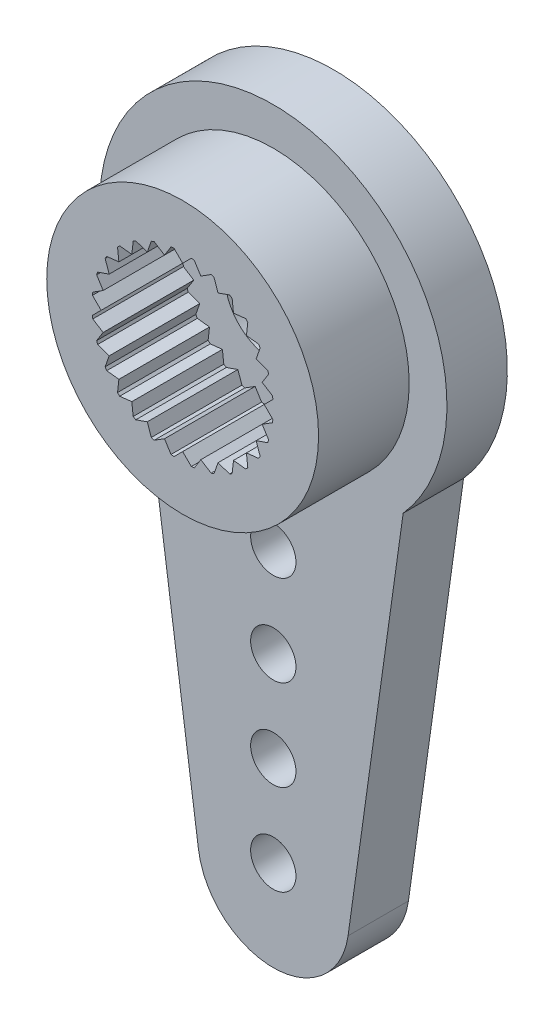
ISO-10303-21;
HEADER;
FILE_DESCRIPTION(('STEP AP214'),'2;1');
FILE_NAME('part.step','',(''),(''),'','','');
FILE_SCHEMA(('AUTOMOTIVE_DESIGN { 1 0 10303 214 1 1 1 1 }'));
ENDSEC;
DATA;
#1=APPLICATION_CONTEXT('core data for automotive mechanical design processes');
#2=APPLICATION_PROTOCOL_DEFINITION('international standard','automotive_design',2000,#1);
#3=PRODUCT_CONTEXT('',#1,'mechanical');
#4=PRODUCT('Part','Part','',(#3));
#5=PRODUCT_RELATED_PRODUCT_CATEGORY('part','',(#4));
#6=PRODUCT_DEFINITION_FORMATION('','',#4);
#7=PRODUCT_DEFINITION_CONTEXT('part definition',#1,'design');
#8=PRODUCT_DEFINITION('design','',#6,#7);
#9=PRODUCT_DEFINITION_SHAPE('','',#8);
#10=(LENGTH_UNIT() NAMED_UNIT(*) SI_UNIT(.MILLI.,.METRE.));
#11=(NAMED_UNIT(*) PLANE_ANGLE_UNIT() SI_UNIT($,.RADIAN.));
#12=(NAMED_UNIT(*) SI_UNIT($,.STERADIAN.) SOLID_ANGLE_UNIT());
#13=UNCERTAINTY_MEASURE_WITH_UNIT(LENGTH_MEASURE(1.E-05),#10,'distance_accuracy_value','');
#14=(GEOMETRIC_REPRESENTATION_CONTEXT(3) GLOBAL_UNCERTAINTY_ASSIGNED_CONTEXT((#13)) GLOBAL_UNIT_ASSIGNED_CONTEXT((#10,
#11,#12)) REPRESENTATION_CONTEXT('',''));
#15=CARTESIAN_POINT('',(0.,0.,0.));
#16=DIRECTION('',(0.,0.,1.));
#17=DIRECTION('',(1.,0.,0.));
#18=AXIS2_PLACEMENT_3D('',#15,#16,#17);
#19=CARTESIAN_POINT('',(0.,0.,0.));
#20=DIRECTION('',(0.,0.,1.));
#21=DIRECTION('',(1.,0.,0.));
#22=AXIS2_PLACEMENT_3D('',#19,#20,#21);
#23=PLANE('',#22);
#24=CARTESIAN_POINT('',(0.,-16.,0.));
#25=DIRECTION('',(0.,0.,-1.));
#26=DIRECTION('',(1.,0.,0.));
#27=AXIS2_PLACEMENT_3D('',#24,#25,#26);
#28=CIRCLE('',#27,0.75);
#29=CARTESIAN_POINT('',(0.75,-16.,0.));
#30=VERTEX_POINT('',#29);
#31=EDGE_CURVE('E1163',#30,#30,#28,.T.);
#32=ORIENTED_EDGE('',*,*,#31,.F.);
#33=EDGE_LOOP('',(#32));
#34=FACE_BOUND('',#33,.T.);
#35=CARTESIAN_POINT('',(0.,-13.,0.));
#36=DIRECTION('',(0.,0.,-1.));
#37=DIRECTION('',(1.,0.,0.));
#38=AXIS2_PLACEMENT_3D('',#35,#36,#37);
#39=CIRCLE('',#38,0.75);
#40=CARTESIAN_POINT('',(0.75,-13.,0.));
#41=VERTEX_POINT('',#40);
#42=EDGE_CURVE('E1173',#41,#41,#39,.T.);
#43=ORIENTED_EDGE('',*,*,#42,.F.);
#44=EDGE_LOOP('',(#43));
#45=FACE_BOUND('',#44,.T.);
#46=CARTESIAN_POINT('',(0.,-10.,0.));
#47=DIRECTION('',(0.,0.,-1.));
#48=DIRECTION('',(1.,0.,0.));
#49=AXIS2_PLACEMENT_3D('',#46,#47,#48);
#50=CIRCLE('',#49,0.75);
#51=CARTESIAN_POINT('',(0.75,-10.,0.));
#52=VERTEX_POINT('',#51);
#53=EDGE_CURVE('E1169',#52,#52,#50,.T.);
#54=ORIENTED_EDGE('',*,*,#53,.F.);
#55=EDGE_LOOP('',(#54));
#56=FACE_BOUND('',#55,.T.);
#57=CARTESIAN_POINT('',(0.,-7.,0.));
#58=DIRECTION('',(0.,0.,-1.));
#59=DIRECTION('',(1.,0.,0.));
#60=AXIS2_PLACEMENT_3D('',#57,#58,#59);
#61=CIRCLE('',#60,0.75);
#62=CARTESIAN_POINT('',(0.75,-7.,0.));
#63=VERTEX_POINT('',#62);
#64=EDGE_CURVE('E1164',#63,#63,#61,.T.);
#65=ORIENTED_EDGE('',*,*,#64,.F.);
#66=EDGE_LOOP('',(#65));
#67=FACE_BOUND('',#66,.T.);
#68=CARTESIAN_POINT('',(0.,0.,0.));
#69=DIRECTION('',(0.,0.,-1.));
#70=DIRECTION('',(-1.,0.,0.));
#71=AXIS2_PLACEMENT_3D('',#68,#69,#70);
#72=CIRCLE('',#71,4.7);
#73=CARTESIAN_POINT('',(-4.7,0.,0.));
#74=VERTEX_POINT('',#73);
#75=EDGE_CURVE('E1914',#74,#74,#72,.T.);
#76=ORIENTED_EDGE('',*,*,#75,.F.);
#77=EDGE_LOOP('',(#76));
#78=FACE_BOUND('',#77,.T.);
#79=CARTESIAN_POINT('',(0.,0.,0.));
#80=DIRECTION('',(0.,0.,1.));
#81=DIRECTION('',(1.,0.,0.));
#82=AXIS2_PLACEMENT_3D('',#79,#80,#81);
#83=CIRCLE('',#82,5.75);
#84=CARTESIAN_POINT('',(4.3,-3.81739439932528,0.));
#85=VERTEX_POINT('',#84);
#86=CARTESIAN_POINT('',(-4.3,-3.81739439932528,0.));
#87=VERTEX_POINT('',#86);
#88=EDGE_CURVE('E1240',#85,#87,#83,.T.);
#89=ORIENTED_EDGE('',*,*,#88,.F.);
#90=DIRECTION('',(-0.138651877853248,-0.990341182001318,0.));
#91=VECTOR('',#90,1.);
#92=CARTESIAN_POINT('',(2.4758529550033,-16.8466296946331,0.));
#93=LINE('',#92,#91);
#94=CARTESIAN_POINT('',(2.4758529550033,-16.8466296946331,0.));
#95=VERTEX_POINT('',#94);
#96=EDGE_CURVE('E1189',#85,#95,#93,.T.);
#97=ORIENTED_EDGE('',*,*,#96,.T.);
#98=CARTESIAN_POINT('',(0.,-16.5,0.));
#99=DIRECTION('',(0.,0.,-1.));
#100=DIRECTION('',(-1.,0.,0.));
#101=AXIS2_PLACEMENT_3D('',#98,#99,#100);
#102=CIRCLE('',#101,2.5);
#103=CARTESIAN_POINT('',(-2.4758529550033,-16.8466296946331,0.));
#104=VERTEX_POINT('',#103);
#105=EDGE_CURVE('E1185',#95,#104,#102,.T.);
#106=ORIENTED_EDGE('',*,*,#105,.T.);
#107=DIRECTION('',(-0.138651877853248,0.990341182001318,0.));
#108=VECTOR('',#107,1.);
#109=CARTESIAN_POINT('',(-4.3,-3.81739439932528,0.));
#110=LINE('',#109,#108);
#111=EDGE_CURVE('E1180',#104,#87,#110,.T.);
#112=ORIENTED_EDGE('',*,*,#111,.T.);
#113=EDGE_LOOP('',(#89,#97,#106,#112));
#114=FACE_BOUND('',#113,.T.);
#115=ADVANCED_FACE('F44',(#34,#45,#56,#67,#78,#114),#23,.F.);
#116=CARTESIAN_POINT('',(0.,0.,2.));
#117=DIRECTION('',(0.,0.,1.));
#118=DIRECTION('',(1.,0.,0.));
#119=AXIS2_PLACEMENT_3D('',#116,#117,#118);
#120=PLANE('',#119);
#121=CARTESIAN_POINT('',(0.,0.,2.));
#122=DIRECTION('',(0.,0.,1.));
#123=DIRECTION('',(1.,0.,0.));
#124=AXIS2_PLACEMENT_3D('',#121,#122,#123);
#125=CIRCLE('',#124,4.5);
#126=CARTESIAN_POINT('',(4.5,0.,2.));
#127=VERTEX_POINT('',#126);
#128=EDGE_CURVE('E1218',#127,#127,#125,.T.);
#129=ORIENTED_EDGE('',*,*,#128,.F.);
#130=EDGE_LOOP('',(#129));
#131=FACE_BOUND('',#130,.T.);
#132=CARTESIAN_POINT('',(0.,-16.,2.));
#133=DIRECTION('',(0.,0.,1.));
#134=DIRECTION('',(1.,0.,0.));
#135=AXIS2_PLACEMENT_3D('',#132,#133,#134);
#136=CIRCLE('',#135,0.75);
#137=CARTESIAN_POINT('',(0.75,-16.,2.));
#138=VERTEX_POINT('',#137);
#139=EDGE_CURVE('E1168',#138,#138,#136,.T.);
#140=ORIENTED_EDGE('',*,*,#139,.F.);
#141=EDGE_LOOP('',(#140));
#142=FACE_BOUND('',#141,.T.);
#143=CARTESIAN_POINT('',(0.,-13.,2.));
#144=DIRECTION('',(0.,0.,1.));
#145=DIRECTION('',(1.,0.,0.));
#146=AXIS2_PLACEMENT_3D('',#143,#144,#145);
#147=CIRCLE('',#146,0.75);
#148=CARTESIAN_POINT('',(0.75,-13.,2.));
#149=VERTEX_POINT('',#148);
#150=EDGE_CURVE('E1251',#149,#149,#147,.T.);
#151=ORIENTED_EDGE('',*,*,#150,.F.);
#152=EDGE_LOOP('',(#151));
#153=FACE_BOUND('',#152,.T.);
#154=CARTESIAN_POINT('',(0.,-10.,2.));
#155=DIRECTION('',(0.,0.,1.));
#156=DIRECTION('',(1.,0.,0.));
#157=AXIS2_PLACEMENT_3D('',#154,#155,#156);
#158=CIRCLE('',#157,0.75);
#159=CARTESIAN_POINT('',(0.75,-10.,2.));
#160=VERTEX_POINT('',#159);
#161=EDGE_CURVE('E1255',#160,#160,#158,.T.);
#162=ORIENTED_EDGE('',*,*,#161,.F.);
#163=EDGE_LOOP('',(#162));
#164=FACE_BOUND('',#163,.T.);
#165=CARTESIAN_POINT('',(0.,-7.,2.));
#166=DIRECTION('',(0.,0.,1.));
#167=DIRECTION('',(1.,0.,0.));
#168=AXIS2_PLACEMENT_3D('',#165,#166,#167);
#169=CIRCLE('',#168,0.75);
#170=CARTESIAN_POINT('',(0.75,-7.,2.));
#171=VERTEX_POINT('',#170);
#172=EDGE_CURVE('E1193',#171,#171,#169,.T.);
#173=ORIENTED_EDGE('',*,*,#172,.F.);
#174=EDGE_LOOP('',(#173));
#175=FACE_BOUND('',#174,.T.);
#176=DIRECTION('',(-0.138651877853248,-0.990341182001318,0.));
#177=VECTOR('',#176,1.);
#178=CARTESIAN_POINT('',(2.4758529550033,-16.8466296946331,2.));
#179=LINE('',#178,#177);
#180=CARTESIAN_POINT('',(4.3,-3.81739439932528,2.));
#181=VERTEX_POINT('',#180);
#182=CARTESIAN_POINT('',(2.4758529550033,-16.8466296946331,2.));
#183=VERTEX_POINT('',#182);
#184=EDGE_CURVE('E1184',#181,#183,#179,.T.);
#185=ORIENTED_EDGE('',*,*,#184,.F.);
#186=CARTESIAN_POINT('',(0.,0.,2.));
#187=DIRECTION('',(0.,0.,1.));
#188=DIRECTION('',(1.,0.,0.));
#189=AXIS2_PLACEMENT_3D('',#186,#187,#188);
#190=CIRCLE('',#189,5.75);
#191=CARTESIAN_POINT('',(-4.3,-3.81739439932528,2.));
#192=VERTEX_POINT('',#191);
#193=EDGE_CURVE('E1222',#181,#192,#190,.T.);
#194=ORIENTED_EDGE('',*,*,#193,.T.);
#195=DIRECTION('',(-0.138651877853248,0.990341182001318,0.));
#196=VECTOR('',#195,1.);
#197=CARTESIAN_POINT('',(-4.3,-3.81739439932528,2.));
#198=LINE('',#197,#196);
#199=CARTESIAN_POINT('',(-2.4758529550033,-16.8466296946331,2.));
#200=VERTEX_POINT('',#199);
#201=EDGE_CURVE('E1198',#200,#192,#198,.T.);
#202=ORIENTED_EDGE('',*,*,#201,.F.);
#203=CARTESIAN_POINT('',(0.,-16.5,2.));
#204=DIRECTION('',(0.,0.,1.));
#205=DIRECTION('',(1.,0.,0.));
#206=AXIS2_PLACEMENT_3D('',#203,#204,#205);
#207=CIRCLE('',#206,2.5);
#208=EDGE_CURVE('E1203',#183,#200,#207,.F.);
#209=ORIENTED_EDGE('',*,*,#208,.F.);
#210=EDGE_LOOP('',(#185,#194,#202,#209));
#211=FACE_BOUND('',#210,.T.);
#212=ADVANCED_FACE('F1879',(#131,#142,#153,#164,#175,#211),#120,.T.);
#213=CARTESIAN_POINT('',(0.,0.,0.));
#214=DIRECTION('',(0.,0.,-1.));
#215=DIRECTION('',(-1.,0.,0.));
#216=AXIS2_PLACEMENT_3D('',#213,#214,#215);
#217=CIRCLE('',#216,3.);
#218=CARTESIAN_POINT('',(-3.,0.,0.));
#219=VERTEX_POINT('',#218);
#220=EDGE_CURVE('E1904',#219,#219,#217,.T.);
#221=ORIENTED_EDGE('',*,*,#220,.F.);
#222=EDGE_LOOP('',(#221));
#223=FACE_BOUND('',#222,.T.);
#224=CARTESIAN_POINT('',(0.,0.,0.));
#225=DIRECTION('',(0.,0.,-1.));
#226=DIRECTION('',(-1.,0.,0.));
#227=AXIS2_PLACEMENT_3D('',#224,#225,#226);
#228=CIRCLE('',#227,3.4);
#229=CARTESIAN_POINT('',(-3.4,0.,0.));
#230=VERTEX_POINT('',#229);
#231=EDGE_CURVE('E1907',#230,#230,#228,.T.);
#232=ORIENTED_EDGE('',*,*,#231,.T.);
#233=EDGE_LOOP('',(#232));
#234=FACE_BOUND('',#233,.T.);
#235=ADVANCED_FACE('F1881',(#223,#234),#23,.F.);
#236=CARTESIAN_POINT('',(0.,0.,5.));
#237=DIRECTION('',(0.,0.,-1.));
#238=DIRECTION('',(-1.,0.,0.));
#239=AXIS2_PLACEMENT_3D('',#236,#237,#238);
#240=CYLINDRICAL_SURFACE('',#239,1.6);
#241=CARTESIAN_POINT('',(0.,0.,2.));
#242=DIRECTION('',(0.,0.,1.));
#243=DIRECTION('',(1.,0.,0.));
#244=AXIS2_PLACEMENT_3D('',#241,#242,#243);
#245=CIRCLE('',#244,1.6);
#246=CARTESIAN_POINT('',(1.6,0.,2.));
#247=VERTEX_POINT('',#246);
#248=EDGE_CURVE('E1233',#247,#247,#245,.T.);
#249=ORIENTED_EDGE('',*,*,#248,.T.);
#250=EDGE_LOOP('',(#249));
#251=FACE_BOUND('',#250,.T.);
#252=CARTESIAN_POINT('',(0.,0.,1.));
#253=DIRECTION('',(0.,0.,-1.));
#254=DIRECTION('',(-1.,0.,0.));
#255=AXIS2_PLACEMENT_3D('',#252,#253,#254);
#256=CIRCLE('',#255,1.6);
#257=CARTESIAN_POINT('',(-1.6,0.,1.));
#258=VERTEX_POINT('',#257);
#259=EDGE_CURVE('E1921',#258,#258,#256,.T.);
#260=ORIENTED_EDGE('',*,*,#259,.T.);
#261=EDGE_LOOP('',(#260));
#262=FACE_BOUND('',#261,.T.);
#263=ADVANCED_FACE('F1892',(#251,#262),#240,.F.);
#264=CARTESIAN_POINT('',(0.,0.,2.));
#265=DIRECTION('',(0.,0.,1.));
#266=DIRECTION('',(1.,0.,0.));
#267=AXIS2_PLACEMENT_3D('',#264,#265,#266);
#268=CYLINDRICAL_SURFACE('',#267,3.);
#269=CARTESIAN_POINT('',(0.,0.,5.));
#270=DIRECTION('',(0.,0.,1.));
#271=DIRECTION('',(1.,0.,0.));
#272=AXIS2_PLACEMENT_3D('',#269,#270,#271);
#273=CIRCLE('',#272,3.);
#274=CARTESIAN_POINT('',(1.03775643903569,2.81479334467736,5.));
#275=VERTEX_POINT('',#274);
#276=CARTESIAN_POINT('',(0.943644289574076,2.84772461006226,5.));
#277=VERTEX_POINT('',#276);
#278=EDGE_CURVE('E68',#275,#277,#273,.T.);
#279=ORIENTED_EDGE('',*,*,#278,.T.);
#280=DIRECTION('',(0.,0.,1.));
#281=VECTOR('',#280,1.);
#282=CARTESIAN_POINT('',(0.943644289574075,2.84772461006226,2.));
#283=LINE('',#282,#281);
#284=CARTESIAN_POINT('',(0.943644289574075,2.84772461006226,2.));
#285=VERTEX_POINT('',#284);
#286=EDGE_CURVE('E612',#277,#285,#283,.F.);
#287=ORIENTED_EDGE('',*,*,#286,.T.);
#288=CARTESIAN_POINT('',(0.,0.,2.));
#289=DIRECTION('',(0.,0.,1.));
#290=DIRECTION('',(1.,0.,0.));
#291=AXIS2_PLACEMENT_3D('',#288,#289,#290);
#292=CIRCLE('',#291,3.);
#293=CARTESIAN_POINT('',(1.03775643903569,2.81479334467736,2.));
#294=VERTEX_POINT('',#293);
#295=EDGE_CURVE('E1385',#294,#285,#292,.T.);
#296=ORIENTED_EDGE('',*,*,#295,.F.);
#297=DIRECTION('',(0.,0.,1.));
#298=VECTOR('',#297,1.);
#299=CARTESIAN_POINT('',(1.03775643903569,2.81479334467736,2.));
#300=LINE('',#299,#298);
#301=EDGE_CURVE('E637',#294,#275,#300,.T.);
#302=ORIENTED_EDGE('',*,*,#301,.T.);
#303=EDGE_LOOP('',(#279,#287,#296,#302));
#304=FACE_BOUND('',#303,.T.);
#305=ADVANCED_FACE('F1899',(#304),#268,.F.);
#306=CARTESIAN_POINT('',(1.63808816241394,2.51329806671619,5.));
#307=VERTEX_POINT('',#306);
#308=CARTESIAN_POINT('',(1.55366349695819,2.56634559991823,5.));
#309=VERTEX_POINT('',#308);
#310=EDGE_CURVE('E1535',#307,#309,#273,.T.);
#311=ORIENTED_EDGE('',*,*,#310,.T.);
#312=DIRECTION('',(0.,0.,1.));
#313=VECTOR('',#312,1.);
#314=CARTESIAN_POINT('',(1.55366349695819,2.56634559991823,2.));
#315=LINE('',#314,#313);
#316=CARTESIAN_POINT('',(1.55366349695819,2.56634559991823,2.));
#317=VERTEX_POINT('',#316);
#318=EDGE_CURVE('E640',#309,#317,#315,.F.);
#319=ORIENTED_EDGE('',*,*,#318,.T.);
#320=CARTESIAN_POINT('',(1.63808816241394,2.51329806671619,2.));
#321=VERTEX_POINT('',#320);
#322=EDGE_CURVE('E1379',#321,#317,#292,.T.);
#323=ORIENTED_EDGE('',*,*,#322,.F.);
#324=DIRECTION('',(0.,0.,1.));
#325=VECTOR('',#324,1.);
#326=CARTESIAN_POINT('',(1.63808816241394,2.51329806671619,2.));
#327=LINE('',#326,#325);
#328=EDGE_CURVE('E657',#321,#307,#327,.T.);
#329=ORIENTED_EDGE('',*,*,#328,.T.);
#330=EDGE_LOOP('',(#311,#319,#323,#329));
#331=FACE_BOUND('',#330,.T.);
#332=ADVANCED_FACE('F1538',(#331),#268,.F.);
#333=CARTESIAN_POINT('',(2.15627930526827,2.08577552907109,5.));
#334=VERTEX_POINT('',#333);
#335=CARTESIAN_POINT('',(2.08577552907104,2.15627930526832,5.));
#336=VERTEX_POINT('',#335);
#337=EDGE_CURVE('E1528',#334,#336,#273,.T.);
#338=ORIENTED_EDGE('',*,*,#337,.T.);
#339=DIRECTION('',(0.,0.,1.));
#340=VECTOR('',#339,1.);
#341=CARTESIAN_POINT('',(2.08577552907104,2.15627930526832,2.));
#342=LINE('',#341,#340);
#343=CARTESIAN_POINT('',(2.08577552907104,2.15627930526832,2.));
#344=VERTEX_POINT('',#343);
#345=EDGE_CURVE('E660',#336,#344,#342,.F.);
#346=ORIENTED_EDGE('',*,*,#345,.T.);
#347=CARTESIAN_POINT('',(2.15627930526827,2.08577552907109,2.));
#348=VERTEX_POINT('',#347);
#349=EDGE_CURVE('E1384',#348,#344,#292,.T.);
#350=ORIENTED_EDGE('',*,*,#349,.F.);
#351=DIRECTION('',(0.,0.,1.));
#352=VECTOR('',#351,1.);
#353=CARTESIAN_POINT('',(2.15627930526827,2.08577552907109,2.));
#354=LINE('',#353,#352);
#355=EDGE_CURVE('E677',#348,#334,#354,.T.);
#356=ORIENTED_EDGE('',*,*,#355,.T.);
#357=EDGE_LOOP('',(#338,#346,#350,#356));
#358=FACE_BOUND('',#357,.T.);
#359=ADVANCED_FACE('F1525',(#358),#268,.F.);
#360=CARTESIAN_POINT('',(2.56634559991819,1.55366349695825,5.));
#361=VERTEX_POINT('',#360);
#362=CARTESIAN_POINT('',(2.51329806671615,1.638088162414,5.));
#363=VERTEX_POINT('',#362);
#364=EDGE_CURVE('E1542',#361,#363,#273,.T.);
#365=ORIENTED_EDGE('',*,*,#364,.T.);
#366=DIRECTION('',(0.,0.,1.));
#367=VECTOR('',#366,1.);
#368=CARTESIAN_POINT('',(2.51329806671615,1.638088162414,2.));
#369=LINE('',#368,#367);
#370=CARTESIAN_POINT('',(2.51329806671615,1.638088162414,2.));
#371=VERTEX_POINT('',#370);
#372=EDGE_CURVE('E680',#363,#371,#369,.F.);
#373=ORIENTED_EDGE('',*,*,#372,.T.);
#374=CARTESIAN_POINT('',(2.56634559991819,1.55366349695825,2.));
#375=VERTEX_POINT('',#374);
#376=EDGE_CURVE('E1389',#375,#371,#292,.T.);
#377=ORIENTED_EDGE('',*,*,#376,.F.);
#378=DIRECTION('',(0.,0.,1.));
#379=VECTOR('',#378,1.);
#380=CARTESIAN_POINT('',(2.56634559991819,1.55366349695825,2.));
#381=LINE('',#380,#379);
#382=EDGE_CURVE('E697',#375,#361,#381,.T.);
#383=ORIENTED_EDGE('',*,*,#382,.T.);
#384=EDGE_LOOP('',(#365,#373,#377,#383));
#385=FACE_BOUND('',#384,.T.);
#386=ADVANCED_FACE('F1869',(#385),#268,.F.);
#387=CARTESIAN_POINT('',(2.84772461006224,0.943644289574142,5.));
#388=VERTEX_POINT('',#387);
#389=CARTESIAN_POINT('',(2.81479334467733,1.03775643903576,5.));
#390=VERTEX_POINT('',#389);
#391=EDGE_CURVE('E1545',#388,#390,#273,.T.);
#392=ORIENTED_EDGE('',*,*,#391,.T.);
#393=DIRECTION('',(0.,0.,1.));
#394=VECTOR('',#393,1.);
#395=CARTESIAN_POINT('',(2.81479334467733,1.03775643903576,2.));
#396=LINE('',#395,#394);
#397=CARTESIAN_POINT('',(2.81479334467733,1.03775643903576,2.));
#398=VERTEX_POINT('',#397);
#399=EDGE_CURVE('E700',#390,#398,#396,.F.);
#400=ORIENTED_EDGE('',*,*,#399,.T.);
#401=CARTESIAN_POINT('',(2.84772461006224,0.943644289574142,2.));
#402=VERTEX_POINT('',#401);
#403=EDGE_CURVE('E1502',#402,#398,#292,.T.);
#404=ORIENTED_EDGE('',*,*,#403,.F.);
#405=DIRECTION('',(0.,0.,1.));
#406=VECTOR('',#405,1.);
#407=CARTESIAN_POINT('',(2.84772461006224,0.943644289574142,2.));
#408=LINE('',#407,#406);
#409=EDGE_CURVE('E717',#402,#388,#408,.T.);
#410=ORIENTED_EDGE('',*,*,#409,.T.);
#411=EDGE_LOOP('',(#392,#400,#404,#410));
#412=FACE_BOUND('',#411,.T.);
#413=ADVANCED_FACE('F1861',(#412),#268,.F.);
#414=CARTESIAN_POINT('',(2.98630681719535,0.286306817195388,5.));
#415=VERTEX_POINT('',#414);
#416=CARTESIAN_POINT('',(2.97514313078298,0.385387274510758,5.));
#417=VERTEX_POINT('',#416);
#418=EDGE_CURVE('E1548',#415,#417,#273,.T.);
#419=ORIENTED_EDGE('',*,*,#418,.T.);
#420=DIRECTION('',(0.,0.,1.));
#421=VECTOR('',#420,1.);
#422=CARTESIAN_POINT('',(2.97514313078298,0.385387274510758,2.));
#423=LINE('',#422,#421);
#424=CARTESIAN_POINT('',(2.97514313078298,0.385387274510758,2.));
#425=VERTEX_POINT('',#424);
#426=EDGE_CURVE('E720',#417,#425,#423,.F.);
#427=ORIENTED_EDGE('',*,*,#426,.T.);
#428=CARTESIAN_POINT('',(2.98630681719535,0.286306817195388,2.));
#429=VERTEX_POINT('',#428);
#430=EDGE_CURVE('E1498',#429,#425,#292,.T.);
#431=ORIENTED_EDGE('',*,*,#430,.F.);
#432=DIRECTION('',(0.,0.,1.));
#433=VECTOR('',#432,1.);
#434=CARTESIAN_POINT('',(2.98630681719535,0.286306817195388,2.));
#435=LINE('',#434,#433);
#436=EDGE_CURVE('E737',#429,#415,#435,.T.);
#437=ORIENTED_EDGE('',*,*,#436,.T.);
#438=EDGE_LOOP('',(#419,#427,#431,#437));
#439=FACE_BOUND('',#438,.T.);
#440=ADVANCED_FACE('F1851',(#439),#268,.F.);
#441=CARTESIAN_POINT('',(2.97514313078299,-0.385387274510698,5.));
#442=VERTEX_POINT('',#441);
#443=CARTESIAN_POINT('',(2.98630681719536,-0.286306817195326,5.));
#444=VERTEX_POINT('',#443);
#445=EDGE_CURVE('E1553',#442,#444,#273,.T.);
#446=ORIENTED_EDGE('',*,*,#445,.T.);
#447=DIRECTION('',(0.,0.,1.));
#448=VECTOR('',#447,1.);
#449=CARTESIAN_POINT('',(2.98630681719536,-0.286306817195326,2.));
#450=LINE('',#449,#448);
#451=CARTESIAN_POINT('',(2.98630681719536,-0.286306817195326,2.));
#452=VERTEX_POINT('',#451);
#453=EDGE_CURVE('E740',#444,#452,#450,.F.);
#454=ORIENTED_EDGE('',*,*,#453,.T.);
#455=CARTESIAN_POINT('',(2.97514313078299,-0.385387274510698,2.));
#456=VERTEX_POINT('',#455);
#457=EDGE_CURVE('E1494',#456,#452,#292,.T.);
#458=ORIENTED_EDGE('',*,*,#457,.F.);
#459=DIRECTION('',(0.,0.,1.));
#460=VECTOR('',#459,1.);
#461=CARTESIAN_POINT('',(2.97514313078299,-0.385387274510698,2.));
#462=LINE('',#461,#460);
#463=EDGE_CURVE('E757',#456,#442,#462,.T.);
#464=ORIENTED_EDGE('',*,*,#463,.T.);
#465=EDGE_LOOP('',(#446,#454,#458,#464));
#466=FACE_BOUND('',#465,.T.);
#467=ADVANCED_FACE('F1841',(#466),#268,.F.);
#468=CARTESIAN_POINT('',(2.81479334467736,-1.0377564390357,5.));
#469=VERTEX_POINT('',#468);
#470=CARTESIAN_POINT('',(2.84772461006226,-0.943644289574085,5.));
#471=VERTEX_POINT('',#470);
#472=EDGE_CURVE('E1558',#469,#471,#273,.T.);
#473=ORIENTED_EDGE('',*,*,#472,.T.);
#474=DIRECTION('',(0.,0.,1.));
#475=VECTOR('',#474,1.);
#476=CARTESIAN_POINT('',(2.84772461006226,-0.943644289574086,2.));
#477=LINE('',#476,#475);
#478=CARTESIAN_POINT('',(2.84772461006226,-0.943644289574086,2.));
#479=VERTEX_POINT('',#478);
#480=EDGE_CURVE('E760',#471,#479,#477,.F.);
#481=ORIENTED_EDGE('',*,*,#480,.T.);
#482=CARTESIAN_POINT('',(2.81479334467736,-1.0377564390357,2.));
#483=VERTEX_POINT('',#482);
#484=EDGE_CURVE('E1490',#483,#479,#292,.T.);
#485=ORIENTED_EDGE('',*,*,#484,.F.);
#486=DIRECTION('',(0.,0.,1.));
#487=VECTOR('',#486,1.);
#488=CARTESIAN_POINT('',(2.81479334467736,-1.0377564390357,2.));
#489=LINE('',#488,#487);
#490=EDGE_CURVE('E777',#483,#469,#489,.T.);
#491=ORIENTED_EDGE('',*,*,#490,.T.);
#492=EDGE_LOOP('',(#473,#481,#485,#491));
#493=FACE_BOUND('',#492,.T.);
#494=ADVANCED_FACE('F1831',(#493),#268,.F.);
#495=CARTESIAN_POINT('',(2.51329806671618,-1.63808816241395,5.));
#496=VERTEX_POINT('',#495);
#497=CARTESIAN_POINT('',(2.56634559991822,-1.5536634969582,5.));
#498=VERTEX_POINT('',#497);
#499=EDGE_CURVE('E1563',#496,#498,#273,.T.);
#500=ORIENTED_EDGE('',*,*,#499,.T.);
#501=DIRECTION('',(0.,0.,1.));
#502=VECTOR('',#501,1.);
#503=CARTESIAN_POINT('',(2.56634559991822,-1.5536634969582,2.));
#504=LINE('',#503,#502);
#505=CARTESIAN_POINT('',(2.56634559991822,-1.5536634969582,2.));
#506=VERTEX_POINT('',#505);
#507=EDGE_CURVE('E780',#498,#506,#504,.F.);
#508=ORIENTED_EDGE('',*,*,#507,.T.);
#509=CARTESIAN_POINT('',(2.51329806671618,-1.63808816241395,2.));
#510=VERTEX_POINT('',#509);
#511=EDGE_CURVE('E1486',#510,#506,#292,.T.);
#512=ORIENTED_EDGE('',*,*,#511,.F.);
#513=DIRECTION('',(0.,0.,1.));
#514=VECTOR('',#513,1.);
#515=CARTESIAN_POINT('',(2.51329806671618,-1.63808816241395,2.));
#516=LINE('',#515,#514);
#517=EDGE_CURVE('E797',#510,#496,#516,.T.);
#518=ORIENTED_EDGE('',*,*,#517,.T.);
#519=EDGE_LOOP('',(#500,#508,#512,#518));
#520=FACE_BOUND('',#519,.T.);
#521=ADVANCED_FACE('F1821',(#520),#268,.F.);
#522=CARTESIAN_POINT('',(2.08577552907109,-2.15627930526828,5.));
#523=VERTEX_POINT('',#522);
#524=CARTESIAN_POINT('',(2.15627930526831,-2.08577552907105,5.));
#525=VERTEX_POINT('',#524);
#526=EDGE_CURVE('E1568',#523,#525,#273,.T.);
#527=ORIENTED_EDGE('',*,*,#526,.T.);
#528=DIRECTION('',(0.,0.,1.));
#529=VECTOR('',#528,1.);
#530=CARTESIAN_POINT('',(2.15627930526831,-2.08577552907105,2.));
#531=LINE('',#530,#529);
#532=CARTESIAN_POINT('',(2.15627930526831,-2.08577552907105,2.));
#533=VERTEX_POINT('',#532);
#534=EDGE_CURVE('E800',#525,#533,#531,.F.);
#535=ORIENTED_EDGE('',*,*,#534,.T.);
#536=CARTESIAN_POINT('',(2.08577552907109,-2.15627930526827,2.));
#537=VERTEX_POINT('',#536);
#538=EDGE_CURVE('E1482',#537,#533,#292,.T.);
#539=ORIENTED_EDGE('',*,*,#538,.F.);
#540=DIRECTION('',(0.,0.,1.));
#541=VECTOR('',#540,1.);
#542=CARTESIAN_POINT('',(2.08577552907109,-2.15627930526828,2.));
#543=LINE('',#542,#541);
#544=EDGE_CURVE('E817',#537,#523,#543,.T.);
#545=ORIENTED_EDGE('',*,*,#544,.T.);
#546=EDGE_LOOP('',(#527,#535,#539,#545));
#547=FACE_BOUND('',#546,.T.);
#548=ADVANCED_FACE('F1811',(#547),#268,.F.);
#549=CARTESIAN_POINT('',(1.55366349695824,-2.5663455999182,5.));
#550=VERTEX_POINT('',#549);
#551=CARTESIAN_POINT('',(1.63808816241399,-2.51329806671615,5.));
#552=VERTEX_POINT('',#551);
#553=EDGE_CURVE('E1573',#550,#552,#273,.T.);
#554=ORIENTED_EDGE('',*,*,#553,.T.);
#555=DIRECTION('',(0.,0.,1.));
#556=VECTOR('',#555,1.);
#557=CARTESIAN_POINT('',(1.63808816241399,-2.51329806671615,2.));
#558=LINE('',#557,#556);
#559=CARTESIAN_POINT('',(1.63808816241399,-2.51329806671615,2.));
#560=VERTEX_POINT('',#559);
#561=EDGE_CURVE('E820',#552,#560,#558,.F.);
#562=ORIENTED_EDGE('',*,*,#561,.T.);
#563=CARTESIAN_POINT('',(1.55366349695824,-2.5663455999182,2.));
#564=VERTEX_POINT('',#563);
#565=EDGE_CURVE('E1478',#564,#560,#292,.T.);
#566=ORIENTED_EDGE('',*,*,#565,.F.);
#567=DIRECTION('',(0.,0.,1.));
#568=VECTOR('',#567,1.);
#569=CARTESIAN_POINT('',(1.55366349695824,-2.5663455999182,2.));
#570=LINE('',#569,#568);
#571=EDGE_CURVE('E837',#564,#550,#570,.T.);
#572=ORIENTED_EDGE('',*,*,#571,.T.);
#573=EDGE_LOOP('',(#554,#562,#566,#572));
#574=FACE_BOUND('',#573,.T.);
#575=ADVANCED_FACE('F1801',(#574),#268,.F.);
#576=CARTESIAN_POINT('',(0.943644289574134,-2.84772461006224,5.));
#577=VERTEX_POINT('',#576);
#578=CARTESIAN_POINT('',(1.03775643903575,-2.81479334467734,5.));
#579=VERTEX_POINT('',#578);
#580=EDGE_CURVE('E1578',#577,#579,#273,.T.);
#581=ORIENTED_EDGE('',*,*,#580,.T.);
#582=DIRECTION('',(0.,0.,1.));
#583=VECTOR('',#582,1.);
#584=CARTESIAN_POINT('',(1.03775643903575,-2.81479334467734,2.));
#585=LINE('',#584,#583);
#586=CARTESIAN_POINT('',(1.03775643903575,-2.81479334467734,2.));
#587=VERTEX_POINT('',#586);
#588=EDGE_CURVE('E840',#579,#587,#585,.F.);
#589=ORIENTED_EDGE('',*,*,#588,.T.);
#590=CARTESIAN_POINT('',(0.943644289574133,-2.84772461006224,2.));
#591=VERTEX_POINT('',#590);
#592=EDGE_CURVE('E1474',#591,#587,#292,.T.);
#593=ORIENTED_EDGE('',*,*,#592,.F.);
#594=DIRECTION('',(0.,0.,1.));
#595=VECTOR('',#594,1.);
#596=CARTESIAN_POINT('',(0.943644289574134,-2.84772461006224,2.));
#597=LINE('',#596,#595);
#598=EDGE_CURVE('E857',#591,#577,#597,.T.);
#599=ORIENTED_EDGE('',*,*,#598,.T.);
#600=EDGE_LOOP('',(#581,#589,#593,#599));
#601=FACE_BOUND('',#600,.T.);
#602=ADVANCED_FACE('F1791',(#601),#268,.F.);
#603=CARTESIAN_POINT('',(0.286306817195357,-2.98630681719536,5.));
#604=VERTEX_POINT('',#603);
#605=CARTESIAN_POINT('',(0.38538727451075,-2.97514313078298,5.));
#606=VERTEX_POINT('',#605);
#607=EDGE_CURVE('E1583',#604,#606,#273,.T.);
#608=ORIENTED_EDGE('',*,*,#607,.T.);
#609=DIRECTION('',(0.,0.,1.));
#610=VECTOR('',#609,1.);
#611=CARTESIAN_POINT('',(0.385387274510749,-2.97514313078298,2.));
#612=LINE('',#611,#610);
#613=CARTESIAN_POINT('',(0.385387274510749,-2.97514313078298,2.));
#614=VERTEX_POINT('',#613);
#615=EDGE_CURVE('E860',#606,#614,#612,.F.);
#616=ORIENTED_EDGE('',*,*,#615,.T.);
#617=CARTESIAN_POINT('',(0.286306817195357,-2.98630681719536,2.));
#618=VERTEX_POINT('',#617);
#619=EDGE_CURVE('E1470',#618,#614,#292,.T.);
#620=ORIENTED_EDGE('',*,*,#619,.F.);
#621=DIRECTION('',(0.,0.,1.));
#622=VECTOR('',#621,1.);
#623=CARTESIAN_POINT('',(0.286306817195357,-2.98630681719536,2.));
#624=LINE('',#623,#622);
#625=EDGE_CURVE('E877',#618,#604,#624,.T.);
#626=ORIENTED_EDGE('',*,*,#625,.T.);
#627=EDGE_LOOP('',(#608,#616,#620,#626));
#628=FACE_BOUND('',#627,.T.);
#629=ADVANCED_FACE('F1781',(#628),#268,.F.);
#630=CARTESIAN_POINT('',(-0.385387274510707,-2.97514313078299,5.));
#631=VERTEX_POINT('',#630);
#632=CARTESIAN_POINT('',(-0.286306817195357,-2.98630681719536,5.));
#633=VERTEX_POINT('',#632);
#634=EDGE_CURVE('E1588',#631,#633,#273,.T.);
#635=ORIENTED_EDGE('',*,*,#634,.T.);
#636=DIRECTION('',(0.,0.,1.));
#637=VECTOR('',#636,1.);
#638=CARTESIAN_POINT('',(-0.286306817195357,-2.98630681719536,2.));
#639=LINE('',#638,#637);
#640=CARTESIAN_POINT('',(-0.286306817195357,-2.98630681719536,2.));
#641=VERTEX_POINT('',#640);
#642=EDGE_CURVE('E880',#633,#641,#639,.F.);
#643=ORIENTED_EDGE('',*,*,#642,.T.);
#644=CARTESIAN_POINT('',(-0.385387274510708,-2.97514313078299,2.));
#645=VERTEX_POINT('',#644);
#646=EDGE_CURVE('E1466',#645,#641,#292,.T.);
#647=ORIENTED_EDGE('',*,*,#646,.F.);
#648=DIRECTION('',(0.,0.,1.));
#649=VECTOR('',#648,1.);
#650=CARTESIAN_POINT('',(-0.385387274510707,-2.97514313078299,2.));
#651=LINE('',#650,#649);
#652=EDGE_CURVE('E897',#645,#631,#651,.T.);
#653=ORIENTED_EDGE('',*,*,#652,.T.);
#654=EDGE_LOOP('',(#635,#643,#647,#653));
#655=FACE_BOUND('',#654,.T.);
#656=ADVANCED_FACE('F1771',(#655),#268,.F.);
#657=CARTESIAN_POINT('',(-1.03775643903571,-2.81479334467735,5.));
#658=VERTEX_POINT('',#657);
#659=CARTESIAN_POINT('',(-0.943644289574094,-2.84772461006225,5.));
#660=VERTEX_POINT('',#659);
#661=EDGE_CURVE('E1593',#658,#660,#273,.T.);
#662=ORIENTED_EDGE('',*,*,#661,.T.);
#663=DIRECTION('',(0.,0.,1.));
#664=VECTOR('',#663,1.);
#665=CARTESIAN_POINT('',(-0.943644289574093,-2.84772461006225,2.));
#666=LINE('',#665,#664);
#667=CARTESIAN_POINT('',(-0.943644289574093,-2.84772461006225,2.));
#668=VERTEX_POINT('',#667);
#669=EDGE_CURVE('E900',#660,#668,#666,.F.);
#670=ORIENTED_EDGE('',*,*,#669,.T.);
#671=CARTESIAN_POINT('',(-1.03775643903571,-2.81479334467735,2.));
#672=VERTEX_POINT('',#671);
#673=EDGE_CURVE('E1462',#672,#668,#292,.T.);
#674=ORIENTED_EDGE('',*,*,#673,.F.);
#675=DIRECTION('',(0.,0.,1.));
#676=VECTOR('',#675,1.);
#677=CARTESIAN_POINT('',(-1.03775643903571,-2.81479334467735,2.));
#678=LINE('',#677,#676);
#679=EDGE_CURVE('E917',#672,#658,#678,.T.);
#680=ORIENTED_EDGE('',*,*,#679,.T.);
#681=EDGE_LOOP('',(#662,#670,#674,#680));
#682=FACE_BOUND('',#681,.T.);
#683=ADVANCED_FACE('F1761',(#682),#268,.F.);
#684=CARTESIAN_POINT('',(-1.63808816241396,-2.51329806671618,5.));
#685=VERTEX_POINT('',#684);
#686=CARTESIAN_POINT('',(-1.55366349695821,-2.56634559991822,5.));
#687=VERTEX_POINT('',#686);
#688=EDGE_CURVE('E1598',#685,#687,#273,.T.);
#689=ORIENTED_EDGE('',*,*,#688,.T.);
#690=DIRECTION('',(0.,0.,1.));
#691=VECTOR('',#690,1.);
#692=CARTESIAN_POINT('',(-1.55366349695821,-2.56634559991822,2.));
#693=LINE('',#692,#691);
#694=CARTESIAN_POINT('',(-1.55366349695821,-2.56634559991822,2.));
#695=VERTEX_POINT('',#694);
#696=EDGE_CURVE('E920',#687,#695,#693,.F.);
#697=ORIENTED_EDGE('',*,*,#696,.T.);
#698=CARTESIAN_POINT('',(-1.63808816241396,-2.51329806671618,2.));
#699=VERTEX_POINT('',#698);
#700=EDGE_CURVE('E1458',#699,#695,#292,.T.);
#701=ORIENTED_EDGE('',*,*,#700,.F.);
#702=DIRECTION('',(0.,0.,1.));
#703=VECTOR('',#702,1.);
#704=CARTESIAN_POINT('',(-1.63808816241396,-2.51329806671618,2.));
#705=LINE('',#704,#703);
#706=EDGE_CURVE('E937',#699,#685,#705,.T.);
#707=ORIENTED_EDGE('',*,*,#706,.T.);
#708=EDGE_LOOP('',(#689,#697,#701,#707));
#709=FACE_BOUND('',#708,.T.);
#710=ADVANCED_FACE('F1751',(#709),#268,.F.);
#711=CARTESIAN_POINT('',(-2.15627930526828,-2.08577552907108,5.));
#712=VERTEX_POINT('',#711);
#713=CARTESIAN_POINT('',(-2.08577552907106,-2.1562793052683,5.));
#714=VERTEX_POINT('',#713);
#715=EDGE_CURVE('E1603',#712,#714,#273,.T.);
#716=ORIENTED_EDGE('',*,*,#715,.T.);
#717=DIRECTION('',(0.,0.,1.));
#718=VECTOR('',#717,1.);
#719=CARTESIAN_POINT('',(-2.08577552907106,-2.1562793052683,2.));
#720=LINE('',#719,#718);
#721=CARTESIAN_POINT('',(-2.08577552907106,-2.1562793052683,2.));
#722=VERTEX_POINT('',#721);
#723=EDGE_CURVE('E940',#714,#722,#720,.F.);
#724=ORIENTED_EDGE('',*,*,#723,.T.);
#725=CARTESIAN_POINT('',(-2.15627930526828,-2.08577552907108,2.));
#726=VERTEX_POINT('',#725);
#727=EDGE_CURVE('E1454',#726,#722,#292,.T.);
#728=ORIENTED_EDGE('',*,*,#727,.F.);
#729=DIRECTION('',(0.,0.,1.));
#730=VECTOR('',#729,1.);
#731=CARTESIAN_POINT('',(-2.15627930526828,-2.08577552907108,2.));
#732=LINE('',#731,#730);
#733=EDGE_CURVE('E957',#726,#712,#732,.T.);
#734=ORIENTED_EDGE('',*,*,#733,.T.);
#735=EDGE_LOOP('',(#716,#724,#728,#734));
#736=FACE_BOUND('',#735,.T.);
#737=ADVANCED_FACE('F1741',(#736),#268,.F.);
#738=CARTESIAN_POINT('',(-2.5663455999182,-1.55366349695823,5.));
#739=VERTEX_POINT('',#738);
#740=CARTESIAN_POINT('',(-2.51329806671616,-1.63808816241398,5.));
#741=VERTEX_POINT('',#740);
#742=EDGE_CURVE('E1608',#739,#741,#273,.T.);
#743=ORIENTED_EDGE('',*,*,#742,.T.);
#744=DIRECTION('',(0.,0.,1.));
#745=VECTOR('',#744,1.);
#746=CARTESIAN_POINT('',(-2.51329806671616,-1.63808816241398,2.));
#747=LINE('',#746,#745);
#748=CARTESIAN_POINT('',(-2.51329806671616,-1.63808816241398,2.));
#749=VERTEX_POINT('',#748);
#750=EDGE_CURVE('E960',#741,#749,#747,.F.);
#751=ORIENTED_EDGE('',*,*,#750,.T.);
#752=CARTESIAN_POINT('',(-2.5663455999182,-1.55366349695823,2.));
#753=VERTEX_POINT('',#752);
#754=EDGE_CURVE('E1450',#753,#749,#292,.T.);
#755=ORIENTED_EDGE('',*,*,#754,.F.);
#756=DIRECTION('',(0.,0.,1.));
#757=VECTOR('',#756,1.);
#758=CARTESIAN_POINT('',(-2.5663455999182,-1.55366349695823,2.));
#759=LINE('',#758,#757);
#760=EDGE_CURVE('E977',#753,#739,#759,.T.);
#761=ORIENTED_EDGE('',*,*,#760,.T.);
#762=EDGE_LOOP('',(#743,#751,#755,#761));
#763=FACE_BOUND('',#762,.T.);
#764=ADVANCED_FACE('F1731',(#763),#268,.F.);
#765=CARTESIAN_POINT('',(-2.84772461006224,-0.943644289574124,5.));
#766=VERTEX_POINT('',#765);
#767=CARTESIAN_POINT('',(-2.81479334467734,-1.03775643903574,5.));
#768=VERTEX_POINT('',#767);
#769=EDGE_CURVE('E1613',#766,#768,#273,.T.);
#770=ORIENTED_EDGE('',*,*,#769,.T.);
#771=DIRECTION('',(0.,0.,1.));
#772=VECTOR('',#771,1.);
#773=CARTESIAN_POINT('',(-2.81479334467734,-1.03775643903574,2.));
#774=LINE('',#773,#772);
#775=CARTESIAN_POINT('',(-2.81479334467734,-1.03775643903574,2.));
#776=VERTEX_POINT('',#775);
#777=EDGE_CURVE('E980',#768,#776,#774,.F.);
#778=ORIENTED_EDGE('',*,*,#777,.T.);
#779=CARTESIAN_POINT('',(-2.84772461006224,-0.943644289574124,2.));
#780=VERTEX_POINT('',#779);
#781=EDGE_CURVE('E1446',#780,#776,#292,.T.);
#782=ORIENTED_EDGE('',*,*,#781,.F.);
#783=DIRECTION('',(0.,0.,1.));
#784=VECTOR('',#783,1.);
#785=CARTESIAN_POINT('',(-2.84772461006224,-0.943644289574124,2.));
#786=LINE('',#785,#784);
#787=EDGE_CURVE('E997',#780,#766,#786,.T.);
#788=ORIENTED_EDGE('',*,*,#787,.T.);
#789=EDGE_LOOP('',(#770,#778,#782,#788));
#790=FACE_BOUND('',#789,.T.);
#791=ADVANCED_FACE('F1721',(#790),#268,.F.);
#792=CARTESIAN_POINT('',(-2.98630681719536,-0.286306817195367,5.));
#793=VERTEX_POINT('',#792);
#794=CARTESIAN_POINT('',(-2.97514313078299,-0.385387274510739,5.));
#795=VERTEX_POINT('',#794);
#796=EDGE_CURVE('E1618',#793,#795,#273,.T.);
#797=ORIENTED_EDGE('',*,*,#796,.T.);
#798=DIRECTION('',(0.,0.,1.));
#799=VECTOR('',#798,1.);
#800=CARTESIAN_POINT('',(-2.97514313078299,-0.385387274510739,2.));
#801=LINE('',#800,#799);
#802=CARTESIAN_POINT('',(-2.97514313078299,-0.385387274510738,2.));
#803=VERTEX_POINT('',#802);
#804=EDGE_CURVE('E1000',#795,#803,#801,.F.);
#805=ORIENTED_EDGE('',*,*,#804,.T.);
#806=CARTESIAN_POINT('',(-2.98630681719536,-0.286306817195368,2.));
#807=VERTEX_POINT('',#806);
#808=EDGE_CURVE('E1442',#807,#803,#292,.T.);
#809=ORIENTED_EDGE('',*,*,#808,.F.);
#810=DIRECTION('',(0.,0.,1.));
#811=VECTOR('',#810,1.);
#812=CARTESIAN_POINT('',(-2.98630681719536,-0.286306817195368,2.));
#813=LINE('',#812,#811);
#814=EDGE_CURVE('E1017',#807,#793,#813,.T.);
#815=ORIENTED_EDGE('',*,*,#814,.T.);
#816=EDGE_LOOP('',(#797,#805,#809,#815));
#817=FACE_BOUND('',#816,.T.);
#818=ADVANCED_FACE('F1711',(#817),#268,.F.);
#819=CARTESIAN_POINT('',(-2.97514313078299,0.385387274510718,5.));
#820=VERTEX_POINT('',#819);
#821=CARTESIAN_POINT('',(-2.98630681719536,0.286306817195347,5.));
#822=VERTEX_POINT('',#821);
#823=EDGE_CURVE('E1623',#820,#822,#273,.T.);
#824=ORIENTED_EDGE('',*,*,#823,.T.);
#825=DIRECTION('',(0.,0.,1.));
#826=VECTOR('',#825,1.);
#827=CARTESIAN_POINT('',(-2.98630681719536,0.286306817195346,2.));
#828=LINE('',#827,#826);
#829=CARTESIAN_POINT('',(-2.98630681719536,0.286306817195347,2.));
#830=VERTEX_POINT('',#829);
#831=EDGE_CURVE('E1020',#822,#830,#828,.F.);
#832=ORIENTED_EDGE('',*,*,#831,.T.);
#833=CARTESIAN_POINT('',(-2.97514313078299,0.385387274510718,2.));
#834=VERTEX_POINT('',#833);
#835=EDGE_CURVE('E1438',#834,#830,#292,.T.);
#836=ORIENTED_EDGE('',*,*,#835,.F.);
#837=DIRECTION('',(0.,0.,1.));
#838=VECTOR('',#837,1.);
#839=CARTESIAN_POINT('',(-2.97514313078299,0.385387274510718,2.));
#840=LINE('',#839,#838);
#841=EDGE_CURVE('E1037',#834,#820,#840,.T.);
#842=ORIENTED_EDGE('',*,*,#841,.T.);
#843=EDGE_LOOP('',(#824,#832,#836,#842));
#844=FACE_BOUND('',#843,.T.);
#845=ADVANCED_FACE('F1701',(#844),#268,.F.);
#846=CARTESIAN_POINT('',(-2.81479334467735,1.03775643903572,5.));
#847=VERTEX_POINT('',#846);
#848=CARTESIAN_POINT('',(-2.84772461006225,0.943644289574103,5.));
#849=VERTEX_POINT('',#848);
#850=EDGE_CURVE('E1628',#847,#849,#273,.T.);
#851=ORIENTED_EDGE('',*,*,#850,.T.);
#852=DIRECTION('',(0.,0.,1.));
#853=VECTOR('',#852,1.);
#854=CARTESIAN_POINT('',(-2.84772461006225,0.943644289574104,2.));
#855=LINE('',#854,#853);
#856=CARTESIAN_POINT('',(-2.84772461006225,0.943644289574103,2.));
#857=VERTEX_POINT('',#856);
#858=EDGE_CURVE('E1040',#849,#857,#855,.F.);
#859=ORIENTED_EDGE('',*,*,#858,.T.);
#860=CARTESIAN_POINT('',(-2.81479334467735,1.03775643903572,2.));
#861=VERTEX_POINT('',#860);
#862=EDGE_CURVE('E1434',#861,#857,#292,.T.);
#863=ORIENTED_EDGE('',*,*,#862,.F.);
#864=DIRECTION('',(0.,0.,1.));
#865=VECTOR('',#864,1.);
#866=CARTESIAN_POINT('',(-2.81479334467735,1.03775643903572,2.));
#867=LINE('',#866,#865);
#868=EDGE_CURVE('E1057',#861,#847,#867,.T.);
#869=ORIENTED_EDGE('',*,*,#868,.T.);
#870=EDGE_LOOP('',(#851,#859,#863,#869));
#871=FACE_BOUND('',#870,.T.);
#872=ADVANCED_FACE('F1691',(#871),#268,.F.);
#873=CARTESIAN_POINT('',(-2.51329806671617,1.63808816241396,5.));
#874=VERTEX_POINT('',#873);
#875=CARTESIAN_POINT('',(-2.56634559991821,1.55366349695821,5.));
#876=VERTEX_POINT('',#875);
#877=EDGE_CURVE('E1633',#874,#876,#273,.T.);
#878=ORIENTED_EDGE('',*,*,#877,.T.);
#879=DIRECTION('',(0.,0.,1.));
#880=VECTOR('',#879,1.);
#881=CARTESIAN_POINT('',(-2.56634559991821,1.55366349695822,2.));
#882=LINE('',#881,#880);
#883=CARTESIAN_POINT('',(-2.56634559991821,1.55366349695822,2.));
#884=VERTEX_POINT('',#883);
#885=EDGE_CURVE('E1060',#876,#884,#882,.F.);
#886=ORIENTED_EDGE('',*,*,#885,.T.);
#887=CARTESIAN_POINT('',(-2.51329806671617,1.63808816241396,2.));
#888=VERTEX_POINT('',#887);
#889=EDGE_CURVE('E1430',#888,#884,#292,.T.);
#890=ORIENTED_EDGE('',*,*,#889,.F.);
#891=DIRECTION('',(0.,0.,1.));
#892=VECTOR('',#891,1.);
#893=CARTESIAN_POINT('',(-2.51329806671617,1.63808816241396,2.));
#894=LINE('',#893,#892);
#895=EDGE_CURVE('E1077',#888,#874,#894,.T.);
#896=ORIENTED_EDGE('',*,*,#895,.T.);
#897=EDGE_LOOP('',(#878,#886,#890,#896));
#898=FACE_BOUND('',#897,.T.);
#899=ADVANCED_FACE('F1681',(#898),#268,.F.);
#900=CARTESIAN_POINT('',(-2.08577552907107,2.15627930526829,5.));
#901=VERTEX_POINT('',#900);
#902=CARTESIAN_POINT('',(-2.1562793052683,2.08577552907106,5.));
#903=VERTEX_POINT('',#902);
#904=EDGE_CURVE('E1638',#901,#903,#273,.T.);
#905=ORIENTED_EDGE('',*,*,#904,.T.);
#906=DIRECTION('',(0.,0.,1.));
#907=VECTOR('',#906,1.);
#908=CARTESIAN_POINT('',(-2.1562793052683,2.08577552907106,2.));
#909=LINE('',#908,#907);
#910=CARTESIAN_POINT('',(-2.1562793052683,2.08577552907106,2.));
#911=VERTEX_POINT('',#910);
#912=EDGE_CURVE('E1080',#903,#911,#909,.F.);
#913=ORIENTED_EDGE('',*,*,#912,.T.);
#914=CARTESIAN_POINT('',(-2.08577552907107,2.15627930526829,2.));
#915=VERTEX_POINT('',#914);
#916=EDGE_CURVE('E1426',#915,#911,#292,.T.);
#917=ORIENTED_EDGE('',*,*,#916,.F.);
#918=DIRECTION('',(0.,0.,1.));
#919=VECTOR('',#918,1.);
#920=CARTESIAN_POINT('',(-2.08577552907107,2.15627930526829,2.));
#921=LINE('',#920,#919);
#922=EDGE_CURVE('E1097',#915,#901,#921,.T.);
#923=ORIENTED_EDGE('',*,*,#922,.T.);
#924=EDGE_LOOP('',(#905,#913,#917,#923));
#925=FACE_BOUND('',#924,.T.);
#926=ADVANCED_FACE('F1671',(#925),#268,.F.);
#927=CARTESIAN_POINT('',(-1.55366349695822,2.56634559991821,5.));
#928=VERTEX_POINT('',#927);
#929=CARTESIAN_POINT('',(-1.63808816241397,2.51329806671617,5.));
#930=VERTEX_POINT('',#929);
#931=EDGE_CURVE('E1643',#928,#930,#273,.T.);
#932=ORIENTED_EDGE('',*,*,#931,.T.);
#933=DIRECTION('',(0.,0.,1.));
#934=VECTOR('',#933,1.);
#935=CARTESIAN_POINT('',(-1.63808816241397,2.51329806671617,2.));
#936=LINE('',#935,#934);
#937=CARTESIAN_POINT('',(-1.63808816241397,2.51329806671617,2.));
#938=VERTEX_POINT('',#937);
#939=EDGE_CURVE('E1100',#930,#938,#936,.F.);
#940=ORIENTED_EDGE('',*,*,#939,.T.);
#941=CARTESIAN_POINT('',(-1.55366349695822,2.56634559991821,2.));
#942=VERTEX_POINT('',#941);
#943=EDGE_CURVE('E1423',#942,#938,#292,.T.);
#944=ORIENTED_EDGE('',*,*,#943,.F.);
#945=DIRECTION('',(0.,0.,1.));
#946=VECTOR('',#945,1.);
#947=CARTESIAN_POINT('',(-1.55366349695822,2.56634559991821,2.));
#948=LINE('',#947,#946);
#949=EDGE_CURVE('E1117',#942,#928,#948,.T.);
#950=ORIENTED_EDGE('',*,*,#949,.T.);
#951=EDGE_LOOP('',(#932,#940,#944,#950));
#952=FACE_BOUND('',#951,.T.);
#953=ADVANCED_FACE('F1661',(#952),#268,.F.);
#954=CARTESIAN_POINT('',(-0.943644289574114,2.84772461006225,5.));
#955=VERTEX_POINT('',#954);
#956=CARTESIAN_POINT('',(-1.03775643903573,2.81479334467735,5.));
#957=VERTEX_POINT('',#956);
#958=EDGE_CURVE('E1239',#955,#957,#273,.T.);
#959=ORIENTED_EDGE('',*,*,#958,.T.);
#960=DIRECTION('',(0.,0.,1.));
#961=VECTOR('',#960,1.);
#962=CARTESIAN_POINT('',(-1.03775643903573,2.81479334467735,2.));
#963=LINE('',#962,#961);
#964=CARTESIAN_POINT('',(-1.03775643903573,2.81479334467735,2.));
#965=VERTEX_POINT('',#964);
#966=EDGE_CURVE('E1120',#957,#965,#963,.F.);
#967=ORIENTED_EDGE('',*,*,#966,.T.);
#968=CARTESIAN_POINT('',(-0.943644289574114,2.84772461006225,2.));
#969=VERTEX_POINT('',#968);
#970=EDGE_CURVE('E1234',#969,#965,#292,.T.);
#971=ORIENTED_EDGE('',*,*,#970,.F.);
#972=DIRECTION('',(0.,0.,1.));
#973=VECTOR('',#972,1.);
#974=CARTESIAN_POINT('',(-0.943644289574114,2.84772461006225,2.));
#975=LINE('',#974,#973);
#976=EDGE_CURVE('E1137',#969,#955,#975,.T.);
#977=ORIENTED_EDGE('',*,*,#976,.T.);
#978=EDGE_LOOP('',(#959,#967,#971,#977));
#979=FACE_BOUND('',#978,.T.);
#980=ADVANCED_FACE('F1420',(#979),#268,.F.);
#981=CARTESIAN_POINT('',(-0.286306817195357,2.98630681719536,5.));
#982=VERTEX_POINT('',#981);
#983=CARTESIAN_POINT('',(-0.385387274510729,2.97514313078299,5.));
#984=VERTEX_POINT('',#983);
#985=EDGE_CURVE('E1236',#982,#984,#273,.T.);
#986=ORIENTED_EDGE('',*,*,#985,.T.);
#987=DIRECTION('',(0.,0.,1.));
#988=VECTOR('',#987,1.);
#989=CARTESIAN_POINT('',(-0.385387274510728,2.97514313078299,2.));
#990=LINE('',#989,#988);
#991=CARTESIAN_POINT('',(-0.385387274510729,2.97514313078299,2.));
#992=VERTEX_POINT('',#991);
#993=EDGE_CURVE('E1140',#984,#992,#990,.F.);
#994=ORIENTED_EDGE('',*,*,#993,.T.);
#995=CARTESIAN_POINT('',(-0.286306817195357,2.98630681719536,2.));
#996=VERTEX_POINT('',#995);
#997=EDGE_CURVE('E1229',#996,#992,#292,.T.);
#998=ORIENTED_EDGE('',*,*,#997,.F.);
#999=DIRECTION('',(0.,0.,1.));
#1000=VECTOR('',#999,1.);
#1001=CARTESIAN_POINT('',(-0.286306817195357,2.98630681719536,2.));
#1002=LINE('',#1001,#1000);
#1003=EDGE_CURVE('E1156',#996,#982,#1002,.T.);
#1004=ORIENTED_EDGE('',*,*,#1003,.T.);
#1005=EDGE_LOOP('',(#986,#994,#998,#1004));
#1006=FACE_BOUND('',#1005,.T.);
#1007=ADVANCED_FACE('F1404',(#1006),#268,.F.);
#1008=CARTESIAN_POINT('',(0.,0.,5.));
#1009=DIRECTION('',(0.,0.,1.));
#1010=DIRECTION('',(1.,0.,0.));
#1011=AXIS2_PLACEMENT_3D('',#1008,#1009,#1010);
#1012=PLANE('',#1011);
#1013=DIRECTION('',(0.846724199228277,0.532032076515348,0.));
#1014=VECTOR('',#1013,1.);
#1015=CARTESIAN_POINT('',(0.600806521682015,2.63230536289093,5.));
#1016=LINE('',#1015,#1014);
#1017=CARTESIAN_POINT('',(0.600806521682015,2.63230536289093,5.));
#1018=VERTEX_POINT('',#1017);
#1019=EDGE_CURVE('E596',#1018,#277,#1016,.T.);
#1020=ORIENTED_EDGE('',*,*,#1019,.T.);
#1021=ORIENTED_EDGE('',*,*,#278,.F.);
#1022=DIRECTION('',(0.33027906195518,-0.943883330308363,0.));
#1023=VECTOR('',#1022,1.);
#1024=CARTESIAN_POINT('',(1.03136055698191,2.83307172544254,5.));
#1025=LINE('',#1024,#1023);
#1026=CARTESIAN_POINT('',(1.17148609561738,2.43261594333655,5.));
#1027=VERTEX_POINT('',#1026);
#1028=EDGE_CURVE('E623',#275,#1027,#1025,.T.);
#1029=ORIENTED_EDGE('',*,*,#1028,.T.);
#1030=DIRECTION('',(0.943883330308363,0.330279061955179,0.));
#1031=VECTOR('',#1030,1.);
#1032=CARTESIAN_POINT('',(1.17148609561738,2.43261594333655,5.));
#1033=LINE('',#1032,#1031);
#1034=EDGE_CURVE('E626',#1027,#309,#1033,.T.);
#1035=ORIENTED_EDGE('',*,*,#1034,.T.);
#1036=ORIENTED_EDGE('',*,*,#310,.F.);
#1037=DIRECTION('',(0.11196447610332,-0.993712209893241,0.));
#1038=VECTOR('',#1037,1.);
#1039=CARTESIAN_POINT('',(1.63591996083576,2.53254138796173,5.));
#1040=LINE('',#1039,#1038);
#1041=CARTESIAN_POINT('',(1.68342246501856,2.1109450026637,5.));
#1042=VERTEX_POINT('',#1041);
#1043=EDGE_CURVE('E643',#307,#1042,#1040,.T.);
#1044=ORIENTED_EDGE('',*,*,#1043,.T.);
#1045=DIRECTION('',(0.993712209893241,0.11196447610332,0.));
#1046=VECTOR('',#1045,1.);
#1047=CARTESIAN_POINT('',(1.68342246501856,2.1109450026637,5.));
#1048=LINE('',#1047,#1046);
#1049=EDGE_CURVE('E646',#1042,#336,#1048,.T.);
#1050=ORIENTED_EDGE('',*,*,#1049,.T.);
#1051=ORIENTED_EDGE('',*,*,#337,.F.);
#1052=DIRECTION('',(-0.111964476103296,-0.993712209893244,0.));
#1053=VECTOR('',#1052,1.);
#1054=CARTESIAN_POINT('',(2.15844750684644,2.10501885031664,5.));
#1055=LINE('',#1054,#1053);
#1056=CARTESIAN_POINT('',(2.11094500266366,1.68342246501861,5.));
#1057=VERTEX_POINT('',#1056);
#1058=EDGE_CURVE('E663',#334,#1057,#1055,.T.);
#1059=ORIENTED_EDGE('',*,*,#1058,.T.);
#1060=DIRECTION('',(0.993712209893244,-0.111964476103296,0.));
#1061=VECTOR('',#1060,1.);
#1062=CARTESIAN_POINT('',(2.11094500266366,1.68342246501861,5.));
#1063=LINE('',#1062,#1061);
#1064=EDGE_CURVE('E666',#1057,#363,#1063,.T.);
#1065=ORIENTED_EDGE('',*,*,#1064,.T.);
#1066=ORIENTED_EDGE('',*,*,#364,.F.);
#1067=DIRECTION('',(-0.330279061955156,-0.943883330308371,0.));
#1068=VECTOR('',#1067,1.);
#1069=CARTESIAN_POINT('',(2.57274148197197,1.57194187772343,5.));
#1070=LINE('',#1069,#1068);
#1071=CARTESIAN_POINT('',(2.43261594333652,1.17148609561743,5.));
#1072=VERTEX_POINT('',#1071);
#1073=EDGE_CURVE('E683',#361,#1072,#1070,.T.);
#1074=ORIENTED_EDGE('',*,*,#1073,.T.);
#1075=DIRECTION('',(0.943883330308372,-0.330279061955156,0.));
#1076=VECTOR('',#1075,1.);
#1077=CARTESIAN_POINT('',(2.43261594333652,1.17148609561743,5.));
#1078=LINE('',#1077,#1076);
#1079=EDGE_CURVE('E686',#1072,#390,#1078,.T.);
#1080=ORIENTED_EDGE('',*,*,#1079,.T.);
#1081=ORIENTED_EDGE('',*,*,#391,.F.);
#1082=DIRECTION('',(-0.532032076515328,-0.84672419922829,0.));
#1083=VECTOR('',#1082,1.);
#1084=CARTESIAN_POINT('',(2.85802745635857,0.96004117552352,5.));
#1085=LINE('',#1084,#1083);
#1086=CARTESIAN_POINT('',(2.63230536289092,0.600806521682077,5.));
#1087=VERTEX_POINT('',#1086);
#1088=EDGE_CURVE('E703',#388,#1087,#1085,.T.);
#1089=ORIENTED_EDGE('',*,*,#1088,.T.);
#1090=DIRECTION('',(0.84672419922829,-0.532032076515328,0.));
#1091=VECTOR('',#1090,1.);
#1092=CARTESIAN_POINT('',(2.63230536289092,0.600806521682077,5.));
#1093=LINE('',#1092,#1091);
#1094=EDGE_CURVE('E706',#1087,#417,#1093,.T.);
#1095=ORIENTED_EDGE('',*,*,#1094,.T.);
#1096=ORIENTED_EDGE('',*,*,#418,.F.);
#1097=DIRECTION('',(-0.70710678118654,-0.707106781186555,0.));
#1098=VECTOR('',#1097,1.);
#1099=CARTESIAN_POINT('',(3.,0.300000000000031,5.));
#1100=LINE('',#1099,#1098);
#1101=CARTESIAN_POINT('',(2.7,0.,5.));
#1102=VERTEX_POINT('',#1101);
#1103=EDGE_CURVE('E723',#415,#1102,#1100,.T.);
#1104=ORIENTED_EDGE('',*,*,#1103,.T.);
#1105=DIRECTION('',(0.707106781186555,-0.70710678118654,0.));
#1106=VECTOR('',#1105,1.);
#1107=CARTESIAN_POINT('',(2.7,0.,5.));
#1108=LINE('',#1107,#1106);
#1109=EDGE_CURVE('E726',#1102,#444,#1108,.T.);
#1110=ORIENTED_EDGE('',*,*,#1109,.T.);
#1111=ORIENTED_EDGE('',*,*,#445,.F.);
#1112=DIRECTION('',(-0.846724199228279,-0.532032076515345,0.));
#1113=VECTOR('',#1112,1.);
#1114=CARTESIAN_POINT('',(2.99154001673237,-0.375084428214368,5.));
#1115=LINE('',#1114,#1113);
#1116=CARTESIAN_POINT('',(2.63230536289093,-0.600806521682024,5.));
#1117=VERTEX_POINT('',#1116);
#1118=EDGE_CURVE('E743',#442,#1117,#1115,.T.);
#1119=ORIENTED_EDGE('',*,*,#1118,.T.);
#1120=DIRECTION('',(0.532032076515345,-0.846724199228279,0.));
#1121=VECTOR('',#1120,1.);
#1122=CARTESIAN_POINT('',(2.63230536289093,-0.600806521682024,5.));
#1123=LINE('',#1122,#1121);
#1124=EDGE_CURVE('E746',#1117,#471,#1123,.T.);
#1125=ORIENTED_EDGE('',*,*,#1124,.T.);
#1126=ORIENTED_EDGE('',*,*,#472,.F.);
#1127=DIRECTION('',(-0.943883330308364,-0.330279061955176,0.));
#1128=VECTOR('',#1127,1.);
#1129=CARTESIAN_POINT('',(2.83307172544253,-1.03136055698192,5.));
#1130=LINE('',#1129,#1128);
#1131=CARTESIAN_POINT('',(2.43261594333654,-1.17148609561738,5.));
#1132=VERTEX_POINT('',#1131);
#1133=EDGE_CURVE('E763',#469,#1132,#1130,.T.);
#1134=ORIENTED_EDGE('',*,*,#1133,.T.);
#1135=DIRECTION('',(0.330279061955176,-0.943883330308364,0.));
#1136=VECTOR('',#1135,1.);
#1137=CARTESIAN_POINT('',(2.43261594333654,-1.17148609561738,5.));
#1138=LINE('',#1137,#1136);
#1139=EDGE_CURVE('E766',#1132,#498,#1138,.T.);
#1140=ORIENTED_EDGE('',*,*,#1139,.T.);
#1141=ORIENTED_EDGE('',*,*,#499,.F.);
#1142=DIRECTION('',(-0.993712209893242,-0.111964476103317,0.));
#1143=VECTOR('',#1142,1.);
#1144=CARTESIAN_POINT('',(2.53254138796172,-1.63591996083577,5.));
#1145=LINE('',#1144,#1143);
#1146=CARTESIAN_POINT('',(2.1109450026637,-1.68342246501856,5.));
#1147=VERTEX_POINT('',#1146);
#1148=EDGE_CURVE('E783',#496,#1147,#1145,.T.);
#1149=ORIENTED_EDGE('',*,*,#1148,.T.);
#1150=DIRECTION('',(0.111964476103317,-0.993712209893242,0.));
#1151=VECTOR('',#1150,1.);
#1152=CARTESIAN_POINT('',(2.1109450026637,-1.68342246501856,5.));
#1153=LINE('',#1152,#1151);
#1154=EDGE_CURVE('E786',#1147,#525,#1153,.T.);
#1155=ORIENTED_EDGE('',*,*,#1154,.T.);
#1156=ORIENTED_EDGE('',*,*,#526,.F.);
#1157=DIRECTION('',(-0.993712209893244,0.1119644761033,0.));
#1158=VECTOR('',#1157,1.);
#1159=CARTESIAN_POINT('',(2.10501885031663,-2.15844750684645,5.));
#1160=LINE('',#1159,#1158);
#1161=CARTESIAN_POINT('',(1.6834224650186,-2.11094500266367,5.));
#1162=VERTEX_POINT('',#1161);
#1163=EDGE_CURVE('E803',#523,#1162,#1160,.T.);
#1164=ORIENTED_EDGE('',*,*,#1163,.T.);
#1165=DIRECTION('',(-0.1119644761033,-0.993712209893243,0.));
#1166=VECTOR('',#1165,1.);
#1167=CARTESIAN_POINT('',(1.6834224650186,-2.11094500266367,5.));
#1168=LINE('',#1167,#1166);
#1169=EDGE_CURVE('E806',#1162,#552,#1168,.T.);
#1170=ORIENTED_EDGE('',*,*,#1169,.T.);
#1171=ORIENTED_EDGE('',*,*,#553,.F.);
#1172=DIRECTION('',(-0.94388333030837,0.33027906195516,0.));
#1173=VECTOR('',#1172,1.);
#1174=CARTESIAN_POINT('',(1.57194187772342,-2.57274148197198,5.));
#1175=LINE('',#1174,#1173);
#1176=CARTESIAN_POINT('',(1.17148609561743,-2.43261594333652,5.));
#1177=VERTEX_POINT('',#1176);
#1178=EDGE_CURVE('E823',#550,#1177,#1175,.T.);
#1179=ORIENTED_EDGE('',*,*,#1178,.T.);
#1180=DIRECTION('',(-0.33027906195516,-0.94388333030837,0.));
#1181=VECTOR('',#1180,1.);
#1182=CARTESIAN_POINT('',(1.17148609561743,-2.43261594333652,5.));
#1183=LINE('',#1182,#1181);
#1184=EDGE_CURVE('E826',#1177,#579,#1183,.T.);
#1185=ORIENTED_EDGE('',*,*,#1184,.T.);
#1186=ORIENTED_EDGE('',*,*,#580,.F.);
#1187=DIRECTION('',(-0.846724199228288,0.53203207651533,0.));
#1188=VECTOR('',#1187,1.);
#1189=CARTESIAN_POINT('',(0.960041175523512,-2.85802745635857,5.));
#1190=LINE('',#1189,#1188);
#1191=CARTESIAN_POINT('',(0.600806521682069,-2.63230536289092,5.));
#1192=VERTEX_POINT('',#1191);
#1193=EDGE_CURVE('E843',#577,#1192,#1190,.T.);
#1194=ORIENTED_EDGE('',*,*,#1193,.T.);
#1195=DIRECTION('',(-0.53203207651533,-0.846724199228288,0.));
#1196=VECTOR('',#1195,1.);
#1197=CARTESIAN_POINT('',(0.600806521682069,-2.63230536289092,5.));
#1198=LINE('',#1197,#1196);
#1199=EDGE_CURVE('E846',#1192,#606,#1198,.T.);
#1200=ORIENTED_EDGE('',*,*,#1199,.T.);
#1201=ORIENTED_EDGE('',*,*,#607,.F.);
#1202=DIRECTION('',(-0.707106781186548,0.707106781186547,0.));
#1203=VECTOR('',#1202,1.);
#1204=CARTESIAN_POINT('',(0.3,-3.,5.));
#1205=LINE('',#1204,#1203);
#1206=CARTESIAN_POINT('',(0.,-2.7,5.));
#1207=VERTEX_POINT('',#1206);
#1208=EDGE_CURVE('E863',#604,#1207,#1205,.T.);
#1209=ORIENTED_EDGE('',*,*,#1208,.T.);
#1210=DIRECTION('',(-0.707106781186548,-0.707106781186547,0.));
#1211=VECTOR('',#1210,1.);
#1212=CARTESIAN_POINT('',(0.,-2.7,5.));
#1213=LINE('',#1212,#1211);
#1214=EDGE_CURVE('E866',#1207,#633,#1213,.T.);
#1215=ORIENTED_EDGE('',*,*,#1214,.T.);
#1216=ORIENTED_EDGE('',*,*,#634,.F.);
#1217=DIRECTION('',(-0.532032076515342,0.846724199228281,0.));
#1218=VECTOR('',#1217,1.);
#1219=CARTESIAN_POINT('',(-0.375084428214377,-2.99154001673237,5.));
#1220=LINE('',#1219,#1218);
#1221=CARTESIAN_POINT('',(-0.600806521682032,-2.63230536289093,5.));
#1222=VERTEX_POINT('',#1221);
#1223=EDGE_CURVE('E883',#631,#1222,#1220,.T.);
#1224=ORIENTED_EDGE('',*,*,#1223,.T.);
#1225=DIRECTION('',(-0.846724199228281,-0.532032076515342,0.));
#1226=VECTOR('',#1225,1.);
#1227=CARTESIAN_POINT('',(-0.600806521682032,-2.63230536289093,5.));
#1228=LINE('',#1227,#1226);
#1229=EDGE_CURVE('E886',#1222,#660,#1228,.T.);
#1230=ORIENTED_EDGE('',*,*,#1229,.T.);
#1231=ORIENTED_EDGE('',*,*,#661,.F.);
#1232=DIRECTION('',(-0.330279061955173,0.943883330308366,0.));
#1233=VECTOR('',#1232,1.);
#1234=CARTESIAN_POINT('',(-1.03136055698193,-2.83307172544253,5.));
#1235=LINE('',#1234,#1233);
#1236=CARTESIAN_POINT('',(-1.17148609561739,-2.43261594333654,5.));
#1237=VERTEX_POINT('',#1236);
#1238=EDGE_CURVE('E903',#658,#1237,#1235,.T.);
#1239=ORIENTED_EDGE('',*,*,#1238,.T.);
#1240=DIRECTION('',(-0.943883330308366,-0.330279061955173,0.));
#1241=VECTOR('',#1240,1.);
#1242=CARTESIAN_POINT('',(-1.17148609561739,-2.43261594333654,5.));
#1243=LINE('',#1242,#1241);
#1244=EDGE_CURVE('E906',#1237,#687,#1243,.T.);
#1245=ORIENTED_EDGE('',*,*,#1244,.T.);
#1246=ORIENTED_EDGE('',*,*,#688,.F.);
#1247=DIRECTION('',(-0.111964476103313,0.993712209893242,0.));
#1248=VECTOR('',#1247,1.);
#1249=CARTESIAN_POINT('',(-1.63591996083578,-2.53254138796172,5.));
#1250=LINE('',#1249,#1248);
#1251=CARTESIAN_POINT('',(-1.68342246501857,-2.11094500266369,5.));
#1252=VERTEX_POINT('',#1251);
#1253=EDGE_CURVE('E923',#685,#1252,#1250,.T.);
#1254=ORIENTED_EDGE('',*,*,#1253,.T.);
#1255=DIRECTION('',(-0.993712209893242,-0.111964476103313,0.));
#1256=VECTOR('',#1255,1.);
#1257=CARTESIAN_POINT('',(-1.68342246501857,-2.11094500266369,5.));
#1258=LINE('',#1257,#1256);
#1259=EDGE_CURVE('E926',#1252,#714,#1258,.T.);
#1260=ORIENTED_EDGE('',*,*,#1259,.T.);
#1261=ORIENTED_EDGE('',*,*,#715,.F.);
#1262=DIRECTION('',(0.111964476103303,0.993712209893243,0.));
#1263=VECTOR('',#1262,1.);
#1264=CARTESIAN_POINT('',(-2.15844750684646,-2.10501885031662,5.));
#1265=LINE('',#1264,#1263);
#1266=CARTESIAN_POINT('',(-2.11094500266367,-1.68342246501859,5.));
#1267=VERTEX_POINT('',#1266);
#1268=EDGE_CURVE('E943',#712,#1267,#1265,.T.);
#1269=ORIENTED_EDGE('',*,*,#1268,.T.);
#1270=DIRECTION('',(-0.993712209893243,0.111964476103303,0.));
#1271=VECTOR('',#1270,1.);
#1272=CARTESIAN_POINT('',(-2.11094500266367,-1.68342246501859,5.));
#1273=LINE('',#1272,#1271);
#1274=EDGE_CURVE('E946',#1267,#741,#1273,.T.);
#1275=ORIENTED_EDGE('',*,*,#1274,.T.);
#1276=ORIENTED_EDGE('',*,*,#742,.F.);
#1277=DIRECTION('',(0.330279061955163,0.943883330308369,0.));
#1278=VECTOR('',#1277,1.);
#1279=CARTESIAN_POINT('',(-2.57274148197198,-1.57194187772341,5.));
#1280=LINE('',#1279,#1278);
#1281=CARTESIAN_POINT('',(-2.43261594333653,-1.17148609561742,5.));
#1282=VERTEX_POINT('',#1281);
#1283=EDGE_CURVE('E963',#739,#1282,#1280,.T.);
#1284=ORIENTED_EDGE('',*,*,#1283,.T.);
#1285=DIRECTION('',(-0.943883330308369,0.330279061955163,0.));
#1286=VECTOR('',#1285,1.);
#1287=CARTESIAN_POINT('',(-2.43261594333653,-1.17148609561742,5.));
#1288=LINE('',#1287,#1286);
#1289=EDGE_CURVE('E966',#1282,#768,#1288,.T.);
#1290=ORIENTED_EDGE('',*,*,#1289,.T.);
#1291=ORIENTED_EDGE('',*,*,#769,.F.);
#1292=DIRECTION('',(0.532032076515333,0.846724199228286,0.));
#1293=VECTOR('',#1292,1.);
#1294=CARTESIAN_POINT('',(-2.85802745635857,-0.960041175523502,5.));
#1295=LINE('',#1294,#1293);
#1296=CARTESIAN_POINT('',(-2.63230536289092,-0.600806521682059,5.));
#1297=VERTEX_POINT('',#1296);
#1298=EDGE_CURVE('E983',#766,#1297,#1295,.T.);
#1299=ORIENTED_EDGE('',*,*,#1298,.T.);
#1300=DIRECTION('',(-0.846724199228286,0.532032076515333,0.));
#1301=VECTOR('',#1300,1.);
#1302=CARTESIAN_POINT('',(-2.63230536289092,-0.600806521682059,5.));
#1303=LINE('',#1302,#1301);
#1304=EDGE_CURVE('E986',#1297,#795,#1303,.T.);
#1305=ORIENTED_EDGE('',*,*,#1304,.T.);
#1306=ORIENTED_EDGE('',*,*,#796,.F.);
#1307=DIRECTION('',(0.707106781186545,0.70710678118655,0.));
#1308=VECTOR('',#1307,1.);
#1309=CARTESIAN_POINT('',(-3.,-0.30000000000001,5.));
#1310=LINE('',#1309,#1308);
#1311=CARTESIAN_POINT('',(-2.7,0.,5.));
#1312=VERTEX_POINT('',#1311);
#1313=EDGE_CURVE('E1003',#793,#1312,#1310,.T.);
#1314=ORIENTED_EDGE('',*,*,#1313,.T.);
#1315=DIRECTION('',(-0.70710678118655,0.707106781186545,0.));
#1316=VECTOR('',#1315,1.);
#1317=CARTESIAN_POINT('',(-2.7,0.,5.));
#1318=LINE('',#1317,#1316);
#1319=EDGE_CURVE('E1006',#1312,#822,#1318,.T.);
#1320=ORIENTED_EDGE('',*,*,#1319,.T.);
#1321=ORIENTED_EDGE('',*,*,#823,.F.);
#1322=DIRECTION('',(0.846724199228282,0.532032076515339,0.));
#1323=VECTOR('',#1322,1.);
#1324=CARTESIAN_POINT('',(-2.99154001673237,0.375084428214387,5.));
#1325=LINE('',#1324,#1323);
#1326=CARTESIAN_POINT('',(-2.63230536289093,0.600806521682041,5.));
#1327=VERTEX_POINT('',#1326);
#1328=EDGE_CURVE('E1023',#820,#1327,#1325,.T.);
#1329=ORIENTED_EDGE('',*,*,#1328,.T.);
#1330=DIRECTION('',(-0.532032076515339,0.846724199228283,0.));
#1331=VECTOR('',#1330,1.);
#1332=CARTESIAN_POINT('',(-2.63230536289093,0.600806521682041,5.));
#1333=LINE('',#1332,#1331);
#1334=EDGE_CURVE('E1026',#1327,#849,#1333,.T.);
#1335=ORIENTED_EDGE('',*,*,#1334,.T.);
#1336=ORIENTED_EDGE('',*,*,#850,.F.);
#1337=DIRECTION('',(0.943883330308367,0.33027906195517,0.));
#1338=VECTOR('',#1337,1.);
#1339=CARTESIAN_POINT('',(-2.83307172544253,1.03136055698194,5.));
#1340=LINE('',#1339,#1338);
#1341=CARTESIAN_POINT('',(-2.43261594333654,1.1714860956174,5.));
#1342=VERTEX_POINT('',#1341);
#1343=EDGE_CURVE('E1043',#847,#1342,#1340,.T.);
#1344=ORIENTED_EDGE('',*,*,#1343,.T.);
#1345=DIRECTION('',(-0.330279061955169,0.943883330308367,0.));
#1346=VECTOR('',#1345,1.);
#1347=CARTESIAN_POINT('',(-2.43261594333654,1.1714860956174,5.));
#1348=LINE('',#1347,#1346);
#1349=EDGE_CURVE('E1046',#1342,#876,#1348,.T.);
#1350=ORIENTED_EDGE('',*,*,#1349,.T.);
#1351=ORIENTED_EDGE('',*,*,#877,.F.);
#1352=DIRECTION('',(0.993712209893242,0.11196447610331,0.));
#1353=VECTOR('',#1352,1.);
#1354=CARTESIAN_POINT('',(-2.53254138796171,1.63591996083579,5.));
#1355=LINE('',#1354,#1353);
#1356=CARTESIAN_POINT('',(-2.11094500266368,1.68342246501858,5.));
#1357=VERTEX_POINT('',#1356);
#1358=EDGE_CURVE('E1063',#874,#1357,#1355,.T.);
#1359=ORIENTED_EDGE('',*,*,#1358,.T.);
#1360=DIRECTION('',(-0.11196447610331,0.993712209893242,0.));
#1361=VECTOR('',#1360,1.);
#1362=CARTESIAN_POINT('',(-2.11094500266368,1.68342246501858,5.));
#1363=LINE('',#1362,#1361);
#1364=EDGE_CURVE('E1066',#1357,#903,#1363,.T.);
#1365=ORIENTED_EDGE('',*,*,#1364,.T.);
#1366=ORIENTED_EDGE('',*,*,#904,.F.);
#1367=DIRECTION('',(0.993712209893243,-0.111964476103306,0.));
#1368=VECTOR('',#1367,1.);
#1369=CARTESIAN_POINT('',(-2.10501885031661,2.15844750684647,5.));
#1370=LINE('',#1369,#1368);
#1371=CARTESIAN_POINT('',(-1.68342246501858,2.11094500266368,5.));
#1372=VERTEX_POINT('',#1371);
#1373=EDGE_CURVE('E1083',#901,#1372,#1370,.T.);
#1374=ORIENTED_EDGE('',*,*,#1373,.T.);
#1375=DIRECTION('',(0.111964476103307,0.993712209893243,0.));
#1376=VECTOR('',#1375,1.);
#1377=CARTESIAN_POINT('',(-1.68342246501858,2.11094500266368,5.));
#1378=LINE('',#1377,#1376);
#1379=EDGE_CURVE('E1086',#1372,#930,#1378,.T.);
#1380=ORIENTED_EDGE('',*,*,#1379,.T.);
#1381=ORIENTED_EDGE('',*,*,#931,.F.);
#1382=DIRECTION('',(0.943883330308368,-0.330279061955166,0.));
#1383=VECTOR('',#1382,1.);
#1384=CARTESIAN_POINT('',(-1.5719418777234,2.57274148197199,5.));
#1385=LINE('',#1384,#1383);
#1386=CARTESIAN_POINT('',(-1.17148609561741,2.43261594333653,5.));
#1387=VERTEX_POINT('',#1386);
#1388=EDGE_CURVE('E1103',#928,#1387,#1385,.T.);
#1389=ORIENTED_EDGE('',*,*,#1388,.T.);
#1390=DIRECTION('',(0.330279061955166,0.943883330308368,0.));
#1391=VECTOR('',#1390,1.);
#1392=CARTESIAN_POINT('',(-1.17148609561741,2.43261594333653,5.));
#1393=LINE('',#1392,#1391);
#1394=EDGE_CURVE('E1106',#1387,#957,#1393,.T.);
#1395=ORIENTED_EDGE('',*,*,#1394,.T.);
#1396=ORIENTED_EDGE('',*,*,#958,.F.);
#1397=DIRECTION('',(0.846724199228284,-0.532032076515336,0.));
#1398=VECTOR('',#1397,1.);
#1399=CARTESIAN_POINT('',(-0.960041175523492,2.85802745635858,5.));
#1400=LINE('',#1399,#1398);
#1401=CARTESIAN_POINT('',(-0.60080652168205,2.63230536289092,5.));
#1402=VERTEX_POINT('',#1401);
#1403=EDGE_CURVE('E1123',#955,#1402,#1400,.T.);
#1404=ORIENTED_EDGE('',*,*,#1403,.T.);
#1405=DIRECTION('',(0.532032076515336,0.846724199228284,0.));
#1406=VECTOR('',#1405,1.);
#1407=CARTESIAN_POINT('',(-0.60080652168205,2.63230536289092,5.));
#1408=LINE('',#1407,#1406);
#1409=EDGE_CURVE('E1126',#1402,#984,#1408,.T.);
#1410=ORIENTED_EDGE('',*,*,#1409,.T.);
#1411=ORIENTED_EDGE('',*,*,#985,.F.);
#1412=DIRECTION('',(0.707106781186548,-0.707106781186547,0.));
#1413=VECTOR('',#1412,1.);
#1414=CARTESIAN_POINT('',(-0.3,3.,5.));
#1415=LINE('',#1414,#1413);
#1416=CARTESIAN_POINT('',(0.,2.7,5.));
#1417=VERTEX_POINT('',#1416);
#1418=EDGE_CURVE('E1143',#982,#1417,#1415,.T.);
#1419=ORIENTED_EDGE('',*,*,#1418,.T.);
#1420=DIRECTION('',(0.707106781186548,0.707106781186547,0.));
#1421=VECTOR('',#1420,1.);
#1422=CARTESIAN_POINT('',(0.,2.7,5.));
#1423=LINE('',#1422,#1421);
#1424=CARTESIAN_POINT('',(0.286306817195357,2.98630681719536,5.));
#1425=VERTEX_POINT('',#1424);
#1426=EDGE_CURVE('E1146',#1417,#1425,#1423,.T.);
#1427=ORIENTED_EDGE('',*,*,#1426,.T.);
#1428=CARTESIAN_POINT('',(0.385387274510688,2.97514313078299,5.));
#1429=VERTEX_POINT('',#1428);
#1430=EDGE_CURVE('E598',#1429,#1425,#273,.T.);
#1431=ORIENTED_EDGE('',*,*,#1430,.F.);
#1432=DIRECTION('',(0.532032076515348,-0.846724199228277,0.));
#1433=VECTOR('',#1432,1.);
#1434=CARTESIAN_POINT('',(0.375084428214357,2.99154001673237,5.));
#1435=LINE('',#1434,#1433);
#1436=EDGE_CURVE('E591',#1429,#1018,#1435,.T.);
#1437=ORIENTED_EDGE('',*,*,#1436,.T.);
#1438=EDGE_LOOP('',(#1020,#1021,#1029,#1035,#1036,#1044,#1050,#1051,#1059,#1065,#1066,#1074,
#1080,#1081,#1089,#1095,#1096,#1104,#1110,#1111,#1119,#1125,#1126,#1134,#1140,#1141,#1149,#1155,
#1156,#1164,#1170,#1171,#1179,#1185,#1186,#1194,#1200,#1201,#1209,#1215,#1216,#1224,#1230,#1231,
#1239,#1245,#1246,#1254,#1260,#1261,#1269,#1275,#1276,#1284,#1290,#1291,#1299,#1305,#1306,#1314,
#1320,#1321,#1329,#1335,#1336,#1344,#1350,#1351,#1359,#1365,#1366,#1374,#1380,#1381,#1389,#1395,
#1396,#1404,#1410,#1411,#1419,#1427,#1431,#1437));
#1439=FACE_BOUND('',#1438,.T.);
#1440=CARTESIAN_POINT('',(0.,0.,5.));
#1441=DIRECTION('',(0.,0.,1.));
#1442=DIRECTION('',(1.,0.,0.));
#1443=AXIS2_PLACEMENT_3D('',#1440,#1441,#1442);
#1444=CIRCLE('',#1443,4.5);
#1445=CARTESIAN_POINT('',(4.5,0.,5.));
#1446=VERTEX_POINT('',#1445);
#1447=EDGE_CURVE('E1217',#1446,#1446,#1444,.T.);
#1448=ORIENTED_EDGE('',*,*,#1447,.T.);
#1449=EDGE_LOOP('',(#1448));
#1450=FACE_BOUND('',#1449,.T.);
#1451=ADVANCED_FACE('F593',(#1439,#1450),#1012,.T.);
#1452=CARTESIAN_POINT('',(0.,0.,5.));
#1453=DIRECTION('',(0.,0.,-1.));
#1454=DIRECTION('',(-1.,0.,0.));
#1455=AXIS2_PLACEMENT_3D('',#1452,#1453,#1454);
#1456=CYLINDRICAL_SURFACE('',#1455,5.75);
#1457=ORIENTED_EDGE('',*,*,#88,.T.);
#1458=DIRECTION('',(0.,0.,-1.));
#1459=VECTOR('',#1458,1.);
#1460=CARTESIAN_POINT('',(-4.3,-3.81739439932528,19.4491120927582));
#1461=LINE('',#1460,#1459);
#1462=EDGE_CURVE('E1201',#192,#87,#1461,.T.);
#1463=ORIENTED_EDGE('',*,*,#1462,.F.);
#1464=ORIENTED_EDGE('',*,*,#193,.F.);
#1465=DIRECTION('',(0.,0.,-1.));
#1466=VECTOR('',#1465,1.);
#1467=CARTESIAN_POINT('',(4.3,-3.81739439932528,19.4491120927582));
#1468=LINE('',#1467,#1466);
#1469=EDGE_CURVE('E1209',#181,#85,#1468,.T.);
#1470=ORIENTED_EDGE('',*,*,#1469,.T.);
#1471=EDGE_LOOP('',(#1457,#1463,#1464,#1470));
#1472=FACE_BOUND('',#1471,.T.);
#1473=ADVANCED_FACE('F46',(#1472),#1456,.T.);
#1474=CARTESIAN_POINT('',(0.385387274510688,2.97514313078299,2.));
#1475=VERTEX_POINT('',#1474);
#1476=CARTESIAN_POINT('',(0.286306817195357,2.98630681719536,2.));
#1477=VERTEX_POINT('',#1476);
#1478=EDGE_CURVE('E1235',#1475,#1477,#292,.T.);
#1479=ORIENTED_EDGE('',*,*,#1478,.F.);
#1480=DIRECTION('',(0.,0.,1.));
#1481=VECTOR('',#1480,1.);
#1482=CARTESIAN_POINT('',(0.385387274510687,2.97514313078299,2.));
#1483=LINE('',#1482,#1481);
#1484=EDGE_CURVE('E60',#1475,#1429,#1483,.T.);
#1485=ORIENTED_EDGE('',*,*,#1484,.T.);
#1486=ORIENTED_EDGE('',*,*,#1430,.T.);
#1487=DIRECTION('',(0.,0.,1.));
#1488=VECTOR('',#1487,1.);
#1489=CARTESIAN_POINT('',(0.286306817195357,2.98630681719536,2.));
#1490=LINE('',#1489,#1488);
#1491=EDGE_CURVE('E1159',#1425,#1477,#1490,.F.);
#1492=ORIENTED_EDGE('',*,*,#1491,.T.);
#1493=EDGE_LOOP('',(#1479,#1485,#1486,#1492));
#1494=FACE_BOUND('',#1493,.T.);
#1495=ADVANCED_FACE('F1393',(#1494),#268,.F.);
#1496=CARTESIAN_POINT('',(0.,0.,2.));
#1497=DIRECTION('',(0.,0.,1.));
#1498=DIRECTION('',(1.,0.,0.));
#1499=AXIS2_PLACEMENT_3D('',#1496,#1497,#1498);
#1500=PLANE('',#1499);
#1501=DIRECTION('',(0.846724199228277,0.532032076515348,0.));
#1502=VECTOR('',#1501,1.);
#1503=CARTESIAN_POINT('',(-1.01574942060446,1.61655594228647,2.));
#1504=LINE('',#1503,#1502);
#1505=CARTESIAN_POINT('',(0.600806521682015,2.63230536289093,2.));
#1506=VERTEX_POINT('',#1505);
#1507=EDGE_CURVE('E11',#1506,#285,#1504,.T.);
#1508=ORIENTED_EDGE('',*,*,#1507,.F.);
#1509=DIRECTION('',(-0.532032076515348,0.846724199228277,0.));
#1510=VECTOR('',#1509,1.);
#1511=CARTESIAN_POINT('',(0.375084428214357,2.99154001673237,2.));
#1512=LINE('',#1511,#1510);
#1513=EDGE_CURVE('E607',#1506,#1475,#1512,.T.);
#1514=ORIENTED_EDGE('',*,*,#1513,.T.);
#1515=ORIENTED_EDGE('',*,*,#1478,.T.);
#1516=DIRECTION('',(0.707106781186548,0.707106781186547,0.));
#1517=VECTOR('',#1516,1.);
#1518=CARTESIAN_POINT('',(-1.35,1.35,2.));
#1519=LINE('',#1518,#1517);
#1520=CARTESIAN_POINT('',(0.,2.7,2.));
#1521=VERTEX_POINT('',#1520);
#1522=EDGE_CURVE('E1244',#1521,#1477,#1519,.T.);
#1523=ORIENTED_EDGE('',*,*,#1522,.F.);
#1524=DIRECTION('',(-0.707106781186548,0.707106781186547,0.));
#1525=VECTOR('',#1524,1.);
#1526=CARTESIAN_POINT('',(-0.3,3.,2.));
#1527=LINE('',#1526,#1525);
#1528=EDGE_CURVE('E1153',#1521,#996,#1527,.T.);
#1529=ORIENTED_EDGE('',*,*,#1528,.T.);
#1530=ORIENTED_EDGE('',*,*,#997,.T.);
#1531=DIRECTION('',(0.532032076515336,0.846724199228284,0.));
#1532=VECTOR('',#1531,1.);
#1533=CARTESIAN_POINT('',(-1.61655594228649,1.01574942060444,2.));
#1534=LINE('',#1533,#1532);
#1535=CARTESIAN_POINT('',(-0.60080652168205,2.63230536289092,2.));
#1536=VERTEX_POINT('',#1535);
#1537=EDGE_CURVE('E1265',#1536,#992,#1534,.T.);
#1538=ORIENTED_EDGE('',*,*,#1537,.F.);
#1539=DIRECTION('',(-0.846724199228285,0.532032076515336,0.));
#1540=VECTOR('',#1539,1.);
#1541=CARTESIAN_POINT('',(-0.960041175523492,2.85802745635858,2.));
#1542=LINE('',#1541,#1540);
#1543=EDGE_CURVE('E1134',#1536,#969,#1542,.T.);
#1544=ORIENTED_EDGE('',*,*,#1543,.T.);
#1545=ORIENTED_EDGE('',*,*,#970,.T.);
#1546=DIRECTION('',(0.330279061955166,0.943883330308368,0.));
#1547=VECTOR('',#1546,1.);
#1548=CARTESIAN_POINT('',(-1.80205101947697,0.630564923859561,2.));
#1549=LINE('',#1548,#1547);
#1550=CARTESIAN_POINT('',(-1.17148609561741,2.43261594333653,2.));
#1551=VERTEX_POINT('',#1550);
#1552=EDGE_CURVE('E1269',#1551,#965,#1549,.T.);
#1553=ORIENTED_EDGE('',*,*,#1552,.F.);
#1554=DIRECTION('',(-0.943883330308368,0.330279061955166,0.));
#1555=VECTOR('',#1554,1.);
#1556=CARTESIAN_POINT('',(-1.5719418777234,2.57274148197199,2.));
#1557=LINE('',#1556,#1555);
#1558=EDGE_CURVE('E1114',#1551,#942,#1557,.T.);
#1559=ORIENTED_EDGE('',*,*,#1558,.T.);
#1560=ORIENTED_EDGE('',*,*,#943,.T.);
#1561=DIRECTION('',(0.111964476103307,0.993712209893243,0.));
#1562=VECTOR('',#1561,1.);
#1563=CARTESIAN_POINT('',(-1.89718373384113,0.213761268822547,2.));
#1564=LINE('',#1563,#1562);
#1565=CARTESIAN_POINT('',(-1.68342246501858,2.11094500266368,2.));
#1566=VERTEX_POINT('',#1565);
#1567=EDGE_CURVE('E1273',#1566,#938,#1564,.T.);
#1568=ORIENTED_EDGE('',*,*,#1567,.F.);
#1569=DIRECTION('',(-0.993712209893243,0.111964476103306,0.));
#1570=VECTOR('',#1569,1.);
#1571=CARTESIAN_POINT('',(-2.10501885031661,2.15844750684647,2.));
#1572=LINE('',#1571,#1570);
#1573=EDGE_CURVE('E1094',#1566,#915,#1572,.T.);
#1574=ORIENTED_EDGE('',*,*,#1573,.T.);
#1575=ORIENTED_EDGE('',*,*,#916,.T.);
#1576=DIRECTION('',(-0.11196447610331,0.993712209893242,0.));
#1577=VECTOR('',#1576,1.);
#1578=CARTESIAN_POINT('',(-1.89718373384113,-0.213761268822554,2.));
#1579=LINE('',#1578,#1577);
#1580=CARTESIAN_POINT('',(-2.11094500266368,1.68342246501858,2.));
#1581=VERTEX_POINT('',#1580);
#1582=EDGE_CURVE('E1277',#1581,#911,#1579,.T.);
#1583=ORIENTED_EDGE('',*,*,#1582,.F.);
#1584=DIRECTION('',(-0.993712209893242,-0.11196447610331,0.));
#1585=VECTOR('',#1584,1.);
#1586=CARTESIAN_POINT('',(-2.53254138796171,1.63591996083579,2.));
#1587=LINE('',#1586,#1585);
#1588=EDGE_CURVE('E1074',#1581,#888,#1587,.T.);
#1589=ORIENTED_EDGE('',*,*,#1588,.T.);
#1590=ORIENTED_EDGE('',*,*,#889,.T.);
#1591=DIRECTION('',(-0.330279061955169,0.943883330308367,0.));
#1592=VECTOR('',#1591,1.);
#1593=CARTESIAN_POINT('',(-1.80205101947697,-0.630564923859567,2.));
#1594=LINE('',#1593,#1592);
#1595=CARTESIAN_POINT('',(-2.43261594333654,1.1714860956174,2.));
#1596=VERTEX_POINT('',#1595);
#1597=EDGE_CURVE('E1281',#1596,#884,#1594,.T.);
#1598=ORIENTED_EDGE('',*,*,#1597,.F.);
#1599=DIRECTION('',(-0.943883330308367,-0.330279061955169,0.));
#1600=VECTOR('',#1599,1.);
#1601=CARTESIAN_POINT('',(-2.83307172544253,1.03136055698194,2.));
#1602=LINE('',#1601,#1600);
#1603=EDGE_CURVE('E1054',#1596,#861,#1602,.T.);
#1604=ORIENTED_EDGE('',*,*,#1603,.T.);
#1605=ORIENTED_EDGE('',*,*,#862,.T.);
#1606=DIRECTION('',(-0.532032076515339,0.846724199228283,0.));
#1607=VECTOR('',#1606,1.);
#1608=CARTESIAN_POINT('',(-1.61655594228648,-1.01574942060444,2.));
#1609=LINE('',#1608,#1607);
#1610=CARTESIAN_POINT('',(-2.63230536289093,0.600806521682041,2.));
#1611=VERTEX_POINT('',#1610);
#1612=EDGE_CURVE('E1285',#1611,#857,#1609,.T.);
#1613=ORIENTED_EDGE('',*,*,#1612,.F.);
#1614=DIRECTION('',(-0.846724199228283,-0.532032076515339,0.));
#1615=VECTOR('',#1614,1.);
#1616=CARTESIAN_POINT('',(-2.99154001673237,0.375084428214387,2.));
#1617=LINE('',#1616,#1615);
#1618=EDGE_CURVE('E1034',#1611,#834,#1617,.T.);
#1619=ORIENTED_EDGE('',*,*,#1618,.T.);
#1620=ORIENTED_EDGE('',*,*,#835,.T.);
#1621=DIRECTION('',(-0.70710678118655,0.707106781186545,0.));
#1622=VECTOR('',#1621,1.);
#1623=CARTESIAN_POINT('',(-1.35,-1.35,2.));
#1624=LINE('',#1623,#1622);
#1625=CARTESIAN_POINT('',(-2.7,0.,2.));
#1626=VERTEX_POINT('',#1625);
#1627=EDGE_CURVE('E1289',#1626,#830,#1624,.T.);
#1628=ORIENTED_EDGE('',*,*,#1627,.F.);
#1629=DIRECTION('',(-0.707106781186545,-0.70710678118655,0.));
#1630=VECTOR('',#1629,1.);
#1631=CARTESIAN_POINT('',(-3.,-0.30000000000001,2.));
#1632=LINE('',#1631,#1630);
#1633=EDGE_CURVE('E1014',#1626,#807,#1632,.T.);
#1634=ORIENTED_EDGE('',*,*,#1633,.T.);
#1635=ORIENTED_EDGE('',*,*,#808,.T.);
#1636=DIRECTION('',(-0.846724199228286,0.532032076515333,0.));
#1637=VECTOR('',#1636,1.);
#1638=CARTESIAN_POINT('',(-1.01574942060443,-1.61655594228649,2.));
#1639=LINE('',#1638,#1637);
#1640=CARTESIAN_POINT('',(-2.63230536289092,-0.600806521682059,2.));
#1641=VERTEX_POINT('',#1640);
#1642=EDGE_CURVE('E1293',#1641,#803,#1639,.T.);
#1643=ORIENTED_EDGE('',*,*,#1642,.F.);
#1644=DIRECTION('',(-0.532032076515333,-0.846724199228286,0.));
#1645=VECTOR('',#1644,1.);
#1646=CARTESIAN_POINT('',(-2.85802745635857,-0.960041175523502,2.));
#1647=LINE('',#1646,#1645);
#1648=EDGE_CURVE('E994',#1641,#780,#1647,.T.);
#1649=ORIENTED_EDGE('',*,*,#1648,.T.);
#1650=ORIENTED_EDGE('',*,*,#781,.T.);
#1651=DIRECTION('',(-0.943883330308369,0.330279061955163,0.));
#1652=VECTOR('',#1651,1.);
#1653=CARTESIAN_POINT('',(-0.630564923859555,-1.80205101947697,2.));
#1654=LINE('',#1653,#1652);
#1655=CARTESIAN_POINT('',(-2.43261594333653,-1.17148609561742,2.));
#1656=VERTEX_POINT('',#1655);
#1657=EDGE_CURVE('E1297',#1656,#776,#1654,.T.);
#1658=ORIENTED_EDGE('',*,*,#1657,.F.);
#1659=DIRECTION('',(-0.330279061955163,-0.943883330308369,0.));
#1660=VECTOR('',#1659,1.);
#1661=CARTESIAN_POINT('',(-2.57274148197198,-1.57194187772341,2.));
#1662=LINE('',#1661,#1660);
#1663=EDGE_CURVE('E974',#1656,#753,#1662,.T.);
#1664=ORIENTED_EDGE('',*,*,#1663,.T.);
#1665=ORIENTED_EDGE('',*,*,#754,.T.);
#1666=DIRECTION('',(-0.993712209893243,0.111964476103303,0.));
#1667=VECTOR('',#1666,1.);
#1668=CARTESIAN_POINT('',(-0.213761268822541,-1.89718373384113,2.));
#1669=LINE('',#1668,#1667);
#1670=CARTESIAN_POINT('',(-2.11094500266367,-1.68342246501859,2.));
#1671=VERTEX_POINT('',#1670);
#1672=EDGE_CURVE('E1301',#1671,#749,#1669,.T.);
#1673=ORIENTED_EDGE('',*,*,#1672,.F.);
#1674=DIRECTION('',(-0.111964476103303,-0.993712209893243,0.));
#1675=VECTOR('',#1674,1.);
#1676=CARTESIAN_POINT('',(-2.15844750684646,-2.10501885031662,2.));
#1677=LINE('',#1676,#1675);
#1678=EDGE_CURVE('E954',#1671,#726,#1677,.T.);
#1679=ORIENTED_EDGE('',*,*,#1678,.T.);
#1680=ORIENTED_EDGE('',*,*,#727,.T.);
#1681=DIRECTION('',(-0.993712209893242,-0.111964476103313,0.));
#1682=VECTOR('',#1681,1.);
#1683=CARTESIAN_POINT('',(0.21376126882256,-1.89718373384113,2.));
#1684=LINE('',#1683,#1682);
#1685=CARTESIAN_POINT('',(-1.68342246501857,-2.11094500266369,2.));
#1686=VERTEX_POINT('',#1685);
#1687=EDGE_CURVE('E1305',#1686,#722,#1684,.T.);
#1688=ORIENTED_EDGE('',*,*,#1687,.F.);
#1689=DIRECTION('',(0.111964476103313,-0.993712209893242,0.));
#1690=VECTOR('',#1689,1.);
#1691=CARTESIAN_POINT('',(-1.63591996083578,-2.53254138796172,2.));
#1692=LINE('',#1691,#1690);
#1693=EDGE_CURVE('E934',#1686,#699,#1692,.T.);
#1694=ORIENTED_EDGE('',*,*,#1693,.T.);
#1695=ORIENTED_EDGE('',*,*,#700,.T.);
#1696=DIRECTION('',(-0.943883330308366,-0.330279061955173,0.));
#1697=VECTOR('',#1696,1.);
#1698=CARTESIAN_POINT('',(0.630564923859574,-1.80205101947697,2.));
#1699=LINE('',#1698,#1697);
#1700=CARTESIAN_POINT('',(-1.17148609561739,-2.43261594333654,2.));
#1701=VERTEX_POINT('',#1700);
#1702=EDGE_CURVE('E1309',#1701,#695,#1699,.T.);
#1703=ORIENTED_EDGE('',*,*,#1702,.F.);
#1704=DIRECTION('',(0.330279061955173,-0.943883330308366,0.));
#1705=VECTOR('',#1704,1.);
#1706=CARTESIAN_POINT('',(-1.03136055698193,-2.83307172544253,2.));
#1707=LINE('',#1706,#1705);
#1708=EDGE_CURVE('E914',#1701,#672,#1707,.T.);
#1709=ORIENTED_EDGE('',*,*,#1708,.T.);
#1710=ORIENTED_EDGE('',*,*,#673,.T.);
#1711=DIRECTION('',(-0.846724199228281,-0.532032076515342,0.));
#1712=VECTOR('',#1711,1.);
#1713=CARTESIAN_POINT('',(1.01574942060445,-1.61655594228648,2.));
#1714=LINE('',#1713,#1712);
#1715=CARTESIAN_POINT('',(-0.600806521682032,-2.63230536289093,2.));
#1716=VERTEX_POINT('',#1715);
#1717=EDGE_CURVE('E1313',#1716,#668,#1714,.T.);
#1718=ORIENTED_EDGE('',*,*,#1717,.F.);
#1719=DIRECTION('',(0.532032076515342,-0.846724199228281,0.));
#1720=VECTOR('',#1719,1.);
#1721=CARTESIAN_POINT('',(-0.375084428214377,-2.99154001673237,2.));
#1722=LINE('',#1721,#1720);
#1723=EDGE_CURVE('E894',#1716,#645,#1722,.T.);
#1724=ORIENTED_EDGE('',*,*,#1723,.T.);
#1725=ORIENTED_EDGE('',*,*,#646,.T.);
#1726=DIRECTION('',(-0.707106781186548,-0.707106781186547,0.));
#1727=VECTOR('',#1726,1.);
#1728=CARTESIAN_POINT('',(1.35,-1.35,2.));
#1729=LINE('',#1728,#1727);
#1730=CARTESIAN_POINT('',(0.,-2.7,2.));
#1731=VERTEX_POINT('',#1730);
#1732=EDGE_CURVE('E1317',#1731,#641,#1729,.T.);
#1733=ORIENTED_EDGE('',*,*,#1732,.F.);
#1734=DIRECTION('',(0.707106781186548,-0.707106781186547,0.));
#1735=VECTOR('',#1734,1.);
#1736=CARTESIAN_POINT('',(0.3,-3.,2.));
#1737=LINE('',#1736,#1735);
#1738=EDGE_CURVE('E874',#1731,#618,#1737,.T.);
#1739=ORIENTED_EDGE('',*,*,#1738,.T.);
#1740=ORIENTED_EDGE('',*,*,#619,.T.);
#1741=DIRECTION('',(-0.53203207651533,-0.846724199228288,0.));
#1742=VECTOR('',#1741,1.);
#1743=CARTESIAN_POINT('',(1.61655594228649,-1.01574942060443,2.));
#1744=LINE('',#1743,#1742);
#1745=CARTESIAN_POINT('',(0.600806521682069,-2.63230536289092,2.));
#1746=VERTEX_POINT('',#1745);
#1747=EDGE_CURVE('E1321',#1746,#614,#1744,.T.);
#1748=ORIENTED_EDGE('',*,*,#1747,.F.);
#1749=DIRECTION('',(0.846724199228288,-0.53203207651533,0.));
#1750=VECTOR('',#1749,1.);
#1751=CARTESIAN_POINT('',(0.960041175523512,-2.85802745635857,2.));
#1752=LINE('',#1751,#1750);
#1753=EDGE_CURVE('E854',#1746,#591,#1752,.T.);
#1754=ORIENTED_EDGE('',*,*,#1753,.T.);
#1755=ORIENTED_EDGE('',*,*,#592,.T.);
#1756=DIRECTION('',(-0.33027906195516,-0.94388333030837,0.));
#1757=VECTOR('',#1756,1.);
#1758=CARTESIAN_POINT('',(1.80205101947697,-0.630564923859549,2.));
#1759=LINE('',#1758,#1757);
#1760=CARTESIAN_POINT('',(1.17148609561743,-2.43261594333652,2.));
#1761=VERTEX_POINT('',#1760);
#1762=EDGE_CURVE('E1325',#1761,#587,#1759,.T.);
#1763=ORIENTED_EDGE('',*,*,#1762,.F.);
#1764=DIRECTION('',(0.94388333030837,-0.33027906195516,0.));
#1765=VECTOR('',#1764,1.);
#1766=CARTESIAN_POINT('',(1.57194187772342,-2.57274148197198,2.));
#1767=LINE('',#1766,#1765);
#1768=EDGE_CURVE('E834',#1761,#564,#1767,.T.);
#1769=ORIENTED_EDGE('',*,*,#1768,.T.);
#1770=ORIENTED_EDGE('',*,*,#565,.T.);
#1771=DIRECTION('',(-0.1119644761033,-0.993712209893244,0.));
#1772=VECTOR('',#1771,1.);
#1773=CARTESIAN_POINT('',(1.89718373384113,-0.213761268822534,2.));
#1774=LINE('',#1773,#1772);
#1775=CARTESIAN_POINT('',(1.6834224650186,-2.11094500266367,2.));
#1776=VERTEX_POINT('',#1775);
#1777=EDGE_CURVE('E1329',#1776,#560,#1774,.T.);
#1778=ORIENTED_EDGE('',*,*,#1777,.F.);
#1779=DIRECTION('',(0.993712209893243,-0.1119644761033,0.));
#1780=VECTOR('',#1779,1.);
#1781=CARTESIAN_POINT('',(2.10501885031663,-2.15844750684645,2.));
#1782=LINE('',#1781,#1780);
#1783=EDGE_CURVE('E814',#1776,#537,#1782,.T.);
#1784=ORIENTED_EDGE('',*,*,#1783,.T.);
#1785=ORIENTED_EDGE('',*,*,#538,.T.);
#1786=DIRECTION('',(0.111964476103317,-0.993712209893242,0.));
#1787=VECTOR('',#1786,1.);
#1788=CARTESIAN_POINT('',(1.89718373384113,0.213761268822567,2.));
#1789=LINE('',#1788,#1787);
#1790=CARTESIAN_POINT('',(2.1109450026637,-1.68342246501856,2.));
#1791=VERTEX_POINT('',#1790);
#1792=EDGE_CURVE('E1333',#1791,#533,#1789,.T.);
#1793=ORIENTED_EDGE('',*,*,#1792,.F.);
#1794=DIRECTION('',(0.993712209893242,0.111964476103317,0.));
#1795=VECTOR('',#1794,1.);
#1796=CARTESIAN_POINT('',(2.53254138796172,-1.63591996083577,2.));
#1797=LINE('',#1796,#1795);
#1798=EDGE_CURVE('E794',#1791,#510,#1797,.T.);
#1799=ORIENTED_EDGE('',*,*,#1798,.T.);
#1800=ORIENTED_EDGE('',*,*,#511,.T.);
#1801=DIRECTION('',(0.330279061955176,-0.943883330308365,0.));
#1802=VECTOR('',#1801,1.);
#1803=CARTESIAN_POINT('',(1.80205101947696,0.63056492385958,2.));
#1804=LINE('',#1803,#1802);
#1805=CARTESIAN_POINT('',(2.43261594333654,-1.17148609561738,2.));
#1806=VERTEX_POINT('',#1805);
#1807=EDGE_CURVE('E1337',#1806,#506,#1804,.T.);
#1808=ORIENTED_EDGE('',*,*,#1807,.F.);
#1809=DIRECTION('',(0.943883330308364,0.330279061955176,0.));
#1810=VECTOR('',#1809,1.);
#1811=CARTESIAN_POINT('',(2.83307172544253,-1.03136055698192,2.));
#1812=LINE('',#1811,#1810);
#1813=EDGE_CURVE('E774',#1806,#483,#1812,.T.);
#1814=ORIENTED_EDGE('',*,*,#1813,.T.);
#1815=ORIENTED_EDGE('',*,*,#484,.T.);
#1816=DIRECTION('',(0.532032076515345,-0.846724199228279,0.));
#1817=VECTOR('',#1816,1.);
#1818=CARTESIAN_POINT('',(1.61655594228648,1.01574942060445,2.));
#1819=LINE('',#1818,#1817);
#1820=CARTESIAN_POINT('',(2.63230536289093,-0.600806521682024,2.));
#1821=VERTEX_POINT('',#1820);
#1822=EDGE_CURVE('E1341',#1821,#479,#1819,.T.);
#1823=ORIENTED_EDGE('',*,*,#1822,.F.);
#1824=DIRECTION('',(0.846724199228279,0.532032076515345,0.));
#1825=VECTOR('',#1824,1.);
#1826=CARTESIAN_POINT('',(2.99154001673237,-0.375084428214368,2.));
#1827=LINE('',#1826,#1825);
#1828=EDGE_CURVE('E754',#1821,#456,#1827,.T.);
#1829=ORIENTED_EDGE('',*,*,#1828,.T.);
#1830=ORIENTED_EDGE('',*,*,#457,.T.);
#1831=DIRECTION('',(0.707106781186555,-0.70710678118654,0.));
#1832=VECTOR('',#1831,1.);
#1833=CARTESIAN_POINT('',(1.34999999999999,1.35000000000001,2.));
#1834=LINE('',#1833,#1832);
#1835=CARTESIAN_POINT('',(2.7,0.,2.));
#1836=VERTEX_POINT('',#1835);
#1837=EDGE_CURVE('E1345',#1836,#452,#1834,.T.);
#1838=ORIENTED_EDGE('',*,*,#1837,.F.);
#1839=DIRECTION('',(0.70710678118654,0.707106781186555,0.));
#1840=VECTOR('',#1839,1.);
#1841=CARTESIAN_POINT('',(3.,0.300000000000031,2.));
#1842=LINE('',#1841,#1840);
#1843=EDGE_CURVE('E734',#1836,#429,#1842,.T.);
#1844=ORIENTED_EDGE('',*,*,#1843,.T.);
#1845=ORIENTED_EDGE('',*,*,#430,.T.);
#1846=DIRECTION('',(0.84672419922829,-0.532032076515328,0.));
#1847=VECTOR('',#1846,1.);
#1848=CARTESIAN_POINT('',(1.01574942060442,1.6165559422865,2.));
#1849=LINE('',#1848,#1847);
#1850=CARTESIAN_POINT('',(2.63230536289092,0.600806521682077,2.));
#1851=VERTEX_POINT('',#1850);
#1852=EDGE_CURVE('E1349',#1851,#425,#1849,.T.);
#1853=ORIENTED_EDGE('',*,*,#1852,.F.);
#1854=DIRECTION('',(0.532032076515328,0.84672419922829,0.));
#1855=VECTOR('',#1854,1.);
#1856=CARTESIAN_POINT('',(2.85802745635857,0.96004117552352,2.));
#1857=LINE('',#1856,#1855);
#1858=EDGE_CURVE('E714',#1851,#402,#1857,.T.);
#1859=ORIENTED_EDGE('',*,*,#1858,.T.);
#1860=ORIENTED_EDGE('',*,*,#403,.T.);
#1861=DIRECTION('',(0.943883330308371,-0.330279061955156,0.));
#1862=VECTOR('',#1861,1.);
#1863=CARTESIAN_POINT('',(0.630564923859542,1.80205101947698,2.));
#1864=LINE('',#1863,#1862);
#1865=CARTESIAN_POINT('',(2.43261594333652,1.17148609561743,2.));
#1866=VERTEX_POINT('',#1865);
#1867=EDGE_CURVE('E1353',#1866,#398,#1864,.T.);
#1868=ORIENTED_EDGE('',*,*,#1867,.F.);
#1869=DIRECTION('',(0.330279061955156,0.943883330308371,0.));
#1870=VECTOR('',#1869,1.);
#1871=CARTESIAN_POINT('',(2.57274148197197,1.57194187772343,2.));
#1872=LINE('',#1871,#1870);
#1873=EDGE_CURVE('E694',#1866,#375,#1872,.T.);
#1874=ORIENTED_EDGE('',*,*,#1873,.T.);
#1875=ORIENTED_EDGE('',*,*,#376,.T.);
#1876=DIRECTION('',(0.993712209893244,-0.111964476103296,0.));
#1877=VECTOR('',#1876,1.);
#1878=CARTESIAN_POINT('',(0.213761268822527,1.89718373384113,2.));
#1879=LINE('',#1878,#1877);
#1880=CARTESIAN_POINT('',(2.11094500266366,1.68342246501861,2.));
#1881=VERTEX_POINT('',#1880);
#1882=EDGE_CURVE('E1357',#1881,#371,#1879,.T.);
#1883=ORIENTED_EDGE('',*,*,#1882,.F.);
#1884=DIRECTION('',(0.111964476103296,0.993712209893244,0.));
#1885=VECTOR('',#1884,1.);
#1886=CARTESIAN_POINT('',(2.15844750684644,2.10501885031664,2.));
#1887=LINE('',#1886,#1885);
#1888=EDGE_CURVE('E674',#1881,#348,#1887,.T.);
#1889=ORIENTED_EDGE('',*,*,#1888,.T.);
#1890=ORIENTED_EDGE('',*,*,#349,.T.);
#1891=DIRECTION('',(0.993712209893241,0.11196447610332,0.));
#1892=VECTOR('',#1891,1.);
#1893=CARTESIAN_POINT('',(-0.213761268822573,1.89718373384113,2.));
#1894=LINE('',#1893,#1892);
#1895=CARTESIAN_POINT('',(1.68342246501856,2.1109450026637,2.));
#1896=VERTEX_POINT('',#1895);
#1897=EDGE_CURVE('E1361',#1896,#344,#1894,.T.);
#1898=ORIENTED_EDGE('',*,*,#1897,.F.);
#1899=DIRECTION('',(-0.11196447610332,0.993712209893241,0.));
#1900=VECTOR('',#1899,1.);
#1901=CARTESIAN_POINT('',(1.63591996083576,2.53254138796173,2.));
#1902=LINE('',#1901,#1900);
#1903=EDGE_CURVE('E654',#1896,#321,#1902,.T.);
#1904=ORIENTED_EDGE('',*,*,#1903,.T.);
#1905=ORIENTED_EDGE('',*,*,#322,.T.);
#1906=DIRECTION('',(0.943883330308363,0.330279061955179,0.));
#1907=VECTOR('',#1906,1.);
#1908=CARTESIAN_POINT('',(-0.630564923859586,1.80205101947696,2.));
#1909=LINE('',#1908,#1907);
#1910=CARTESIAN_POINT('',(1.17148609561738,2.43261594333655,2.));
#1911=VERTEX_POINT('',#1910);
#1912=EDGE_CURVE('E53',#1911,#317,#1909,.T.);
#1913=ORIENTED_EDGE('',*,*,#1912,.F.);
#1914=DIRECTION('',(-0.33027906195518,0.943883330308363,0.));
#1915=VECTOR('',#1914,1.);
#1916=CARTESIAN_POINT('',(1.03136055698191,2.83307172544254,2.));
#1917=LINE('',#1916,#1915);
#1918=EDGE_CURVE('E634',#1911,#294,#1917,.T.);
#1919=ORIENTED_EDGE('',*,*,#1918,.T.);
#1920=ORIENTED_EDGE('',*,*,#295,.T.);
#1921=EDGE_LOOP('',(#1508,#1514,#1515,#1523,#1529,#1530,#1538,#1544,#1545,#1553,#1559,#1560,
#1568,#1574,#1575,#1583,#1589,#1590,#1598,#1604,#1605,#1613,#1619,#1620,#1628,#1634,#1635,#1643,
#1649,#1650,#1658,#1664,#1665,#1673,#1679,#1680,#1688,#1694,#1695,#1703,#1709,#1710,#1718,#1724,
#1725,#1733,#1739,#1740,#1748,#1754,#1755,#1763,#1769,#1770,#1778,#1784,#1785,#1793,#1799,#1800,
#1808,#1814,#1815,#1823,#1829,#1830,#1838,#1844,#1845,#1853,#1859,#1860,#1868,#1874,#1875,#1883,
#1889,#1890,#1898,#1904,#1905,#1913,#1919,#1920));
#1922=FACE_BOUND('',#1921,.T.);
#1923=ORIENTED_EDGE('',*,*,#248,.F.);
#1924=EDGE_LOOP('',(#1923));
#1925=FACE_BOUND('',#1924,.T.);
#1926=ADVANCED_FACE('F1374',(#1922,#1925),#1500,.T.);
#1927=CARTESIAN_POINT('',(0.,0.,2.));
#1928=DIRECTION('',(0.,0.,1.));
#1929=DIRECTION('',(1.,0.,0.));
#1930=AXIS2_PLACEMENT_3D('',#1927,#1928,#1929);
#1931=CYLINDRICAL_SURFACE('',#1930,4.5);
#1932=ORIENTED_EDGE('',*,*,#128,.T.);
#1933=EDGE_LOOP('',(#1932));
#1934=FACE_BOUND('',#1933,.T.);
#1935=ORIENTED_EDGE('',*,*,#1447,.F.);
#1936=EDGE_LOOP('',(#1935));
#1937=FACE_BOUND('',#1936,.T.);
#1938=ADVANCED_FACE('F2086',(#1934,#1937),#1931,.T.);
#1939=CARTESIAN_POINT('',(2.4758529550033,-16.8466296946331,19.4491120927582));
#1940=DIRECTION('',(0.990341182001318,-0.138651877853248,0.));
#1941=DIRECTION('',(0.138651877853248,0.990341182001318,0.));
#1942=AXIS2_PLACEMENT_3D('',#1939,#1940,#1941);
#1943=PLANE('',#1942);
#1944=ORIENTED_EDGE('',*,*,#1469,.F.);
#1945=ORIENTED_EDGE('',*,*,#184,.T.);
#1946=DIRECTION('',(0.,0.,-1.));
#1947=VECTOR('',#1946,1.);
#1948=CARTESIAN_POINT('',(2.4758529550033,-16.8466296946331,19.4491120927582));
#1949=LINE('',#1948,#1947);
#1950=EDGE_CURVE('E1197',#183,#95,#1949,.T.);
#1951=ORIENTED_EDGE('',*,*,#1950,.T.);
#1952=ORIENTED_EDGE('',*,*,#96,.F.);
#1953=EDGE_LOOP('',(#1944,#1945,#1951,#1952));
#1954=FACE_BOUND('',#1953,.T.);
#1955=ADVANCED_FACE('F2082',(#1954),#1943,.T.);
#1956=CARTESIAN_POINT('',(0.,-16.5,19.4491120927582));
#1957=DIRECTION('',(0.,0.,-1.));
#1958=DIRECTION('',(-1.,0.,0.));
#1959=AXIS2_PLACEMENT_3D('',#1956,#1957,#1958);
#1960=CYLINDRICAL_SURFACE('',#1959,2.5);
#1961=ORIENTED_EDGE('',*,*,#1950,.F.);
#1962=ORIENTED_EDGE('',*,*,#208,.T.);
#1963=DIRECTION('',(0.,0.,-1.));
#1964=VECTOR('',#1963,1.);
#1965=CARTESIAN_POINT('',(-2.4758529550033,-16.8466296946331,19.4491120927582));
#1966=LINE('',#1965,#1964);
#1967=EDGE_CURVE('E1202',#200,#104,#1966,.T.);
#1968=ORIENTED_EDGE('',*,*,#1967,.T.);
#1969=ORIENTED_EDGE('',*,*,#105,.F.);
#1970=EDGE_LOOP('',(#1961,#1962,#1968,#1969));
#1971=FACE_BOUND('',#1970,.T.);
#1972=ADVANCED_FACE('F2078',(#1971),#1960,.T.);
#1973=CARTESIAN_POINT('',(-4.3,-3.81739439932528,19.4491120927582));
#1974=DIRECTION('',(-0.990341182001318,-0.138651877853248,0.));
#1975=DIRECTION('',(0.138651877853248,-0.990341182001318,0.));
#1976=AXIS2_PLACEMENT_3D('',#1973,#1974,#1975);
#1977=PLANE('',#1976);
#1978=ORIENTED_EDGE('',*,*,#1967,.F.);
#1979=ORIENTED_EDGE('',*,*,#201,.T.);
#1980=ORIENTED_EDGE('',*,*,#1462,.T.);
#1981=ORIENTED_EDGE('',*,*,#111,.F.);
#1982=EDGE_LOOP('',(#1978,#1979,#1980,#1981));
#1983=FACE_BOUND('',#1982,.T.);
#1984=ADVANCED_FACE('F2074',(#1983),#1977,.T.);
#1985=CARTESIAN_POINT('',(0.,-16.,3.));
#1986=DIRECTION('',(0.,0.,-1.));
#1987=DIRECTION('',(-1.,0.,0.));
#1988=AXIS2_PLACEMENT_3D('',#1985,#1986,#1987);
#1989=CYLINDRICAL_SURFACE('',#1988,0.75);
#1990=ORIENTED_EDGE('',*,*,#139,.T.);
#1991=EDGE_LOOP('',(#1990));
#1992=FACE_BOUND('',#1991,.T.);
#1993=ORIENTED_EDGE('',*,*,#31,.T.);
#1994=EDGE_LOOP('',(#1993));
#1995=FACE_BOUND('',#1994,.T.);
#1996=ADVANCED_FACE('F2070',(#1992,#1995),#1989,.F.);
#1997=CARTESIAN_POINT('',(0.,-13.,3.));
#1998=DIRECTION('',(0.,0.,-1.));
#1999=DIRECTION('',(-1.,0.,0.));
#2000=AXIS2_PLACEMENT_3D('',#1997,#1998,#1999);
#2001=CYLINDRICAL_SURFACE('',#2000,0.75);
#2002=ORIENTED_EDGE('',*,*,#150,.T.);
#2003=EDGE_LOOP('',(#2002));
#2004=FACE_BOUND('',#2003,.T.);
#2005=ORIENTED_EDGE('',*,*,#42,.T.);
#2006=EDGE_LOOP('',(#2005));
#2007=FACE_BOUND('',#2006,.T.);
#2008=ADVANCED_FACE('F2066',(#2004,#2007),#2001,.F.);
#2009=CARTESIAN_POINT('',(0.,-10.,3.));
#2010=DIRECTION('',(0.,0.,-1.));
#2011=DIRECTION('',(-1.,0.,0.));
#2012=AXIS2_PLACEMENT_3D('',#2009,#2010,#2011);
#2013=CYLINDRICAL_SURFACE('',#2012,0.75);
#2014=ORIENTED_EDGE('',*,*,#161,.T.);
#2015=EDGE_LOOP('',(#2014));
#2016=FACE_BOUND('',#2015,.T.);
#2017=ORIENTED_EDGE('',*,*,#53,.T.);
#2018=EDGE_LOOP('',(#2017));
#2019=FACE_BOUND('',#2018,.T.);
#2020=ADVANCED_FACE('F2062',(#2016,#2019),#2013,.F.);
#2021=CARTESIAN_POINT('',(0.,-7.,3.));
#2022=DIRECTION('',(0.,0.,-1.));
#2023=DIRECTION('',(-1.,0.,0.));
#2024=AXIS2_PLACEMENT_3D('',#2021,#2022,#2023);
#2025=CYLINDRICAL_SURFACE('',#2024,0.75);
#2026=ORIENTED_EDGE('',*,*,#172,.T.);
#2027=EDGE_LOOP('',(#2026));
#2028=FACE_BOUND('',#2027,.T.);
#2029=ORIENTED_EDGE('',*,*,#64,.T.);
#2030=EDGE_LOOP('',(#2029));
#2031=FACE_BOUND('',#2030,.T.);
#2032=ADVANCED_FACE('F2057',(#2028,#2031),#2025,.F.);
#2033=CARTESIAN_POINT('',(0.,2.7,1.32917960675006));
#2034=DIRECTION('',(0.707106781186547,-0.707106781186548,0.));
#2035=DIRECTION('',(0.707106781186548,0.707106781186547,0.));
#2036=AXIS2_PLACEMENT_3D('',#2033,#2034,#2035);
#2037=PLANE('',#2036);
#2038=ORIENTED_EDGE('',*,*,#1491,.F.);
#2039=ORIENTED_EDGE('',*,*,#1426,.F.);
#2040=DIRECTION('',(0.,0.,1.));
#2041=VECTOR('',#2040,1.);
#2042=CARTESIAN_POINT('',(0.,2.7,1.32917960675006));
#2043=LINE('',#2042,#2041);
#2044=EDGE_CURVE('E1149',#1521,#1417,#2043,.T.);
#2045=ORIENTED_EDGE('',*,*,#2044,.F.);
#2046=ORIENTED_EDGE('',*,*,#1522,.T.);
#2047=EDGE_LOOP('',(#2038,#2039,#2045,#2046));
#2048=FACE_BOUND('',#2047,.T.);
#2049=ADVANCED_FACE('F1396',(#2048),#2037,.T.);
#2050=CARTESIAN_POINT('',(-0.3,3.,1.32917960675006));
#2051=DIRECTION('',(-0.707106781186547,-0.707106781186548,0.));
#2052=DIRECTION('',(0.707106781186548,-0.707106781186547,0.));
#2053=AXIS2_PLACEMENT_3D('',#2050,#2051,#2052);
#2054=PLANE('',#2053);
#2055=ORIENTED_EDGE('',*,*,#1003,.F.);
#2056=ORIENTED_EDGE('',*,*,#1528,.F.);
#2057=ORIENTED_EDGE('',*,*,#2044,.T.);
#2058=ORIENTED_EDGE('',*,*,#1418,.F.);
#2059=EDGE_LOOP('',(#2055,#2056,#2057,#2058));
#2060=FACE_BOUND('',#2059,.T.);
#2061=ADVANCED_FACE('F1401',(#2060),#2054,.T.);
#2062=CARTESIAN_POINT('',(-0.60080652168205,2.63230536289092,1.31354247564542));
#2063=DIRECTION('',(0.846724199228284,-0.532032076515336,0.));
#2064=DIRECTION('',(0.532032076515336,0.846724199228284,0.));
#2065=AXIS2_PLACEMENT_3D('',#2062,#2063,#2064);
#2066=PLANE('',#2065);
#2067=ORIENTED_EDGE('',*,*,#993,.F.);
#2068=ORIENTED_EDGE('',*,*,#1409,.F.);
#2069=DIRECTION('',(0.,0.,1.));
#2070=VECTOR('',#2069,1.);
#2071=CARTESIAN_POINT('',(-0.60080652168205,2.63230536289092,1.31354247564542));
#2072=LINE('',#2071,#2070);
#2073=EDGE_CURVE('E1130',#1536,#1402,#2072,.T.);
#2074=ORIENTED_EDGE('',*,*,#2073,.F.);
#2075=ORIENTED_EDGE('',*,*,#1537,.T.);
#2076=EDGE_LOOP('',(#2067,#2068,#2074,#2075));
#2077=FACE_BOUND('',#2076,.T.);
#2078=ADVANCED_FACE('F1409',(#2077),#2066,.T.);
#2079=CARTESIAN_POINT('',(-0.960041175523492,2.85802745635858,1.31354247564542));
#2080=DIRECTION('',(-0.532032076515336,-0.846724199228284,0.));
#2081=DIRECTION('',(0.846724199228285,-0.532032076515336,0.));
#2082=AXIS2_PLACEMENT_3D('',#2079,#2080,#2081);
#2083=PLANE('',#2082);
#2084=ORIENTED_EDGE('',*,*,#976,.F.);
#2085=ORIENTED_EDGE('',*,*,#1543,.F.);
#2086=ORIENTED_EDGE('',*,*,#2073,.T.);
#2087=ORIENTED_EDGE('',*,*,#1403,.F.);
#2088=EDGE_LOOP('',(#2084,#2085,#2086,#2087));
#2089=FACE_BOUND('',#2088,.T.);
#2090=ADVANCED_FACE('F1416',(#2089),#2083,.T.);
#2091=CARTESIAN_POINT('',(-1.17148609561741,2.43261594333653,1.32724967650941));
#2092=DIRECTION('',(0.943883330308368,-0.330279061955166,0.));
#2093=DIRECTION('',(0.330279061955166,0.943883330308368,0.));
#2094=AXIS2_PLACEMENT_3D('',#2091,#2092,#2093);
#2095=PLANE('',#2094);
#2096=ORIENTED_EDGE('',*,*,#966,.F.);
#2097=ORIENTED_EDGE('',*,*,#1394,.F.);
#2098=DIRECTION('',(0.,0.,1.));
#2099=VECTOR('',#2098,1.);
#2100=CARTESIAN_POINT('',(-1.17148609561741,2.43261594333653,1.32724967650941));
#2101=LINE('',#2100,#2099);
#2102=EDGE_CURVE('E1110',#1551,#1387,#2101,.T.);
#2103=ORIENTED_EDGE('',*,*,#2102,.F.);
#2104=ORIENTED_EDGE('',*,*,#1552,.T.);
#2105=EDGE_LOOP('',(#2096,#2097,#2103,#2104));
#2106=FACE_BOUND('',#2105,.T.);
#2107=ADVANCED_FACE('F1654',(#2106),#2095,.T.);
#2108=CARTESIAN_POINT('',(-1.5719418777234,2.57274148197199,1.32724967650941));
#2109=DIRECTION('',(-0.330279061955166,-0.943883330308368,0.));
#2110=DIRECTION('',(0.943883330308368,-0.330279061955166,0.));
#2111=AXIS2_PLACEMENT_3D('',#2108,#2109,#2110);
#2112=PLANE('',#2111);
#2113=ORIENTED_EDGE('',*,*,#949,.F.);
#2114=ORIENTED_EDGE('',*,*,#1558,.F.);
#2115=ORIENTED_EDGE('',*,*,#2102,.T.);
#2116=ORIENTED_EDGE('',*,*,#1388,.F.);
#2117=EDGE_LOOP('',(#2113,#2114,#2115,#2116));
#2118=FACE_BOUND('',#2117,.T.);
#2119=ADVANCED_FACE('F1660',(#2118),#2112,.T.);
#2120=CARTESIAN_POINT('',(-1.68342246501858,2.11094500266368,1.36928827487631));
#2121=DIRECTION('',(0.993712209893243,-0.111964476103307,0.));
#2122=DIRECTION('',(0.111964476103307,0.993712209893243,0.));
#2123=AXIS2_PLACEMENT_3D('',#2120,#2121,#2122);
#2124=PLANE('',#2123);
#2125=ORIENTED_EDGE('',*,*,#939,.F.);
#2126=ORIENTED_EDGE('',*,*,#1379,.F.);
#2127=DIRECTION('',(0.,0.,1.));
#2128=VECTOR('',#2127,1.);
#2129=CARTESIAN_POINT('',(-1.68342246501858,2.11094500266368,1.36928827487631));
#2130=LINE('',#2129,#2128);
#2131=EDGE_CURVE('E1090',#1566,#1372,#2130,.T.);
#2132=ORIENTED_EDGE('',*,*,#2131,.F.);
#2133=ORIENTED_EDGE('',*,*,#1567,.T.);
#2134=EDGE_LOOP('',(#2125,#2126,#2132,#2133));
#2135=FACE_BOUND('',#2134,.T.);
#2136=ADVANCED_FACE('F1664',(#2135),#2124,.T.);
#2137=CARTESIAN_POINT('',(-2.10501885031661,2.15844750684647,1.36928827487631));
#2138=DIRECTION('',(-0.111964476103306,-0.993712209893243,0.));
#2139=DIRECTION('',(0.993712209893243,-0.111964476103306,0.));
#2140=AXIS2_PLACEMENT_3D('',#2137,#2138,#2139);
#2141=PLANE('',#2140);
#2142=ORIENTED_EDGE('',*,*,#922,.F.);
#2143=ORIENTED_EDGE('',*,*,#1573,.F.);
#2144=ORIENTED_EDGE('',*,*,#2131,.T.);
#2145=ORIENTED_EDGE('',*,*,#1373,.F.);
#2146=EDGE_LOOP('',(#2142,#2143,#2144,#2145));
#2147=FACE_BOUND('',#2146,.T.);
#2148=ADVANCED_FACE('F1670',(#2147),#2141,.T.);
#2149=CARTESIAN_POINT('',(-2.11094500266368,1.68342246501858,1.36928827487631));
#2150=DIRECTION('',(0.993712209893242,0.11196447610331,0.));
#2151=DIRECTION('',(-0.11196447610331,0.993712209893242,0.));
#2152=AXIS2_PLACEMENT_3D('',#2149,#2150,#2151);
#2153=PLANE('',#2152);
#2154=ORIENTED_EDGE('',*,*,#912,.F.);
#2155=ORIENTED_EDGE('',*,*,#1364,.F.);
#2156=DIRECTION('',(0.,0.,1.));
#2157=VECTOR('',#2156,1.);
#2158=CARTESIAN_POINT('',(-2.11094500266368,1.68342246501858,1.36928827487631));
#2159=LINE('',#2158,#2157);
#2160=EDGE_CURVE('E1070',#1581,#1357,#2159,.T.);
#2161=ORIENTED_EDGE('',*,*,#2160,.F.);
#2162=ORIENTED_EDGE('',*,*,#1582,.T.);
#2163=EDGE_LOOP('',(#2154,#2155,#2161,#2162));
#2164=FACE_BOUND('',#2163,.T.);
#2165=ADVANCED_FACE('F1674',(#2164),#2153,.T.);
#2166=CARTESIAN_POINT('',(-2.53254138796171,1.63591996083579,1.36928827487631));
#2167=DIRECTION('',(0.11196447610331,-0.993712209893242,0.));
#2168=DIRECTION('',(0.993712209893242,0.11196447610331,0.));
#2169=AXIS2_PLACEMENT_3D('',#2166,#2167,#2168);
#2170=PLANE('',#2169);
#2171=ORIENTED_EDGE('',*,*,#895,.F.);
#2172=ORIENTED_EDGE('',*,*,#1588,.F.);
#2173=ORIENTED_EDGE('',*,*,#2160,.T.);
#2174=ORIENTED_EDGE('',*,*,#1358,.F.);
#2175=EDGE_LOOP('',(#2171,#2172,#2173,#2174));
#2176=FACE_BOUND('',#2175,.T.);
#2177=ADVANCED_FACE('F1680',(#2176),#2170,.T.);
#2178=CARTESIAN_POINT('',(-2.43261594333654,1.1714860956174,1.32724967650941));
#2179=DIRECTION('',(0.943883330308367,0.330279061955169,0.));
#2180=DIRECTION('',(-0.330279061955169,0.943883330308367,0.));
#2181=AXIS2_PLACEMENT_3D('',#2178,#2179,#2180);
#2182=PLANE('',#2181);
#2183=ORIENTED_EDGE('',*,*,#885,.F.);
#2184=ORIENTED_EDGE('',*,*,#1349,.F.);
#2185=DIRECTION('',(0.,0.,1.));
#2186=VECTOR('',#2185,1.);
#2187=CARTESIAN_POINT('',(-2.43261594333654,1.1714860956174,1.32724967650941));
#2188=LINE('',#2187,#2186);
#2189=EDGE_CURVE('E1050',#1596,#1342,#2188,.T.);
#2190=ORIENTED_EDGE('',*,*,#2189,.F.);
#2191=ORIENTED_EDGE('',*,*,#1597,.T.);
#2192=EDGE_LOOP('',(#2183,#2184,#2190,#2191));
#2193=FACE_BOUND('',#2192,.T.);
#2194=ADVANCED_FACE('F1684',(#2193),#2182,.T.);
#2195=CARTESIAN_POINT('',(-2.83307172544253,1.03136055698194,1.32724967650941));
#2196=DIRECTION('',(0.330279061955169,-0.943883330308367,0.));
#2197=DIRECTION('',(0.943883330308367,0.330279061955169,0.));
#2198=AXIS2_PLACEMENT_3D('',#2195,#2196,#2197);
#2199=PLANE('',#2198);
#2200=ORIENTED_EDGE('',*,*,#868,.F.);
#2201=ORIENTED_EDGE('',*,*,#1603,.F.);
#2202=ORIENTED_EDGE('',*,*,#2189,.T.);
#2203=ORIENTED_EDGE('',*,*,#1343,.F.);
#2204=EDGE_LOOP('',(#2200,#2201,#2202,#2203));
#2205=FACE_BOUND('',#2204,.T.);
#2206=ADVANCED_FACE('F1690',(#2205),#2199,.T.);
#2207=CARTESIAN_POINT('',(-2.63230536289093,0.600806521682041,1.31354247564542));
#2208=DIRECTION('',(0.846724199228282,0.532032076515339,0.));
#2209=DIRECTION('',(-0.532032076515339,0.846724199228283,0.));
#2210=AXIS2_PLACEMENT_3D('',#2207,#2208,#2209);
#2211=PLANE('',#2210);
#2212=ORIENTED_EDGE('',*,*,#858,.F.);
#2213=ORIENTED_EDGE('',*,*,#1334,.F.);
#2214=DIRECTION('',(0.,0.,1.));
#2215=VECTOR('',#2214,1.);
#2216=CARTESIAN_POINT('',(-2.63230536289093,0.600806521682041,1.31354247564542));
#2217=LINE('',#2216,#2215);
#2218=EDGE_CURVE('E1030',#1611,#1327,#2217,.T.);
#2219=ORIENTED_EDGE('',*,*,#2218,.F.);
#2220=ORIENTED_EDGE('',*,*,#1612,.T.);
#2221=EDGE_LOOP('',(#2212,#2213,#2219,#2220));
#2222=FACE_BOUND('',#2221,.T.);
#2223=ADVANCED_FACE('F1694',(#2222),#2211,.T.);
#2224=CARTESIAN_POINT('',(-2.99154001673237,0.375084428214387,1.31354247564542));
#2225=DIRECTION('',(0.532032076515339,-0.846724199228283,0.));
#2226=DIRECTION('',(0.846724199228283,0.532032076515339,0.));
#2227=AXIS2_PLACEMENT_3D('',#2224,#2225,#2226);
#2228=PLANE('',#2227);
#2229=ORIENTED_EDGE('',*,*,#841,.F.);
#2230=ORIENTED_EDGE('',*,*,#1618,.F.);
#2231=ORIENTED_EDGE('',*,*,#2218,.T.);
#2232=ORIENTED_EDGE('',*,*,#1328,.F.);
#2233=EDGE_LOOP('',(#2229,#2230,#2231,#2232));
#2234=FACE_BOUND('',#2233,.T.);
#2235=ADVANCED_FACE('F1700',(#2234),#2228,.T.);
#2236=CARTESIAN_POINT('',(-2.7,0.,1.32917960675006));
#2237=DIRECTION('',(0.707106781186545,0.70710678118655,0.));
#2238=DIRECTION('',(-0.70710678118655,0.707106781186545,0.));
#2239=AXIS2_PLACEMENT_3D('',#2236,#2237,#2238);
#2240=PLANE('',#2239);
#2241=ORIENTED_EDGE('',*,*,#831,.F.);
#2242=ORIENTED_EDGE('',*,*,#1319,.F.);
#2243=DIRECTION('',(0.,0.,1.));
#2244=VECTOR('',#2243,1.);
#2245=CARTESIAN_POINT('',(-2.7,0.,1.32917960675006));
#2246=LINE('',#2245,#2244);
#2247=EDGE_CURVE('E1010',#1626,#1312,#2246,.T.);
#2248=ORIENTED_EDGE('',*,*,#2247,.F.);
#2249=ORIENTED_EDGE('',*,*,#1627,.T.);
#2250=EDGE_LOOP('',(#2241,#2242,#2248,#2249));
#2251=FACE_BOUND('',#2250,.T.);
#2252=ADVANCED_FACE('F1704',(#2251),#2240,.T.);
#2253=CARTESIAN_POINT('',(-3.,-0.30000000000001,1.32917960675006));
#2254=DIRECTION('',(0.70710678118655,-0.707106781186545,0.));
#2255=DIRECTION('',(0.707106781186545,0.70710678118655,0.));
#2256=AXIS2_PLACEMENT_3D('',#2253,#2254,#2255);
#2257=PLANE('',#2256);
#2258=ORIENTED_EDGE('',*,*,#814,.F.);
#2259=ORIENTED_EDGE('',*,*,#1633,.F.);
#2260=ORIENTED_EDGE('',*,*,#2247,.T.);
#2261=ORIENTED_EDGE('',*,*,#1313,.F.);
#2262=EDGE_LOOP('',(#2258,#2259,#2260,#2261));
#2263=FACE_BOUND('',#2262,.T.);
#2264=ADVANCED_FACE('F1710',(#2263),#2257,.T.);
#2265=CARTESIAN_POINT('',(-2.63230536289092,-0.600806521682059,1.31354247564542));
#2266=DIRECTION('',(0.532032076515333,0.846724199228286,0.));
#2267=DIRECTION('',(-0.846724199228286,0.532032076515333,0.));
#2268=AXIS2_PLACEMENT_3D('',#2265,#2266,#2267);
#2269=PLANE('',#2268);
#2270=ORIENTED_EDGE('',*,*,#804,.F.);
#2271=ORIENTED_EDGE('',*,*,#1304,.F.);
#2272=DIRECTION('',(0.,0.,1.));
#2273=VECTOR('',#2272,1.);
#2274=CARTESIAN_POINT('',(-2.63230536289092,-0.600806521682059,1.31354247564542));
#2275=LINE('',#2274,#2273);
#2276=EDGE_CURVE('E990',#1641,#1297,#2275,.T.);
#2277=ORIENTED_EDGE('',*,*,#2276,.F.);
#2278=ORIENTED_EDGE('',*,*,#1642,.T.);
#2279=EDGE_LOOP('',(#2270,#2271,#2277,#2278));
#2280=FACE_BOUND('',#2279,.T.);
#2281=ADVANCED_FACE('F1714',(#2280),#2269,.T.);
#2282=CARTESIAN_POINT('',(-2.85802745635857,-0.960041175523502,1.31354247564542));
#2283=DIRECTION('',(0.846724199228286,-0.532032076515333,0.));
#2284=DIRECTION('',(0.532032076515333,0.846724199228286,0.));
#2285=AXIS2_PLACEMENT_3D('',#2282,#2283,#2284);
#2286=PLANE('',#2285);
#2287=ORIENTED_EDGE('',*,*,#787,.F.);
#2288=ORIENTED_EDGE('',*,*,#1648,.F.);
#2289=ORIENTED_EDGE('',*,*,#2276,.T.);
#2290=ORIENTED_EDGE('',*,*,#1298,.F.);
#2291=EDGE_LOOP('',(#2287,#2288,#2289,#2290));
#2292=FACE_BOUND('',#2291,.T.);
#2293=ADVANCED_FACE('F1720',(#2292),#2286,.T.);
#2294=CARTESIAN_POINT('',(-2.43261594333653,-1.17148609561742,1.32724967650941));
#2295=DIRECTION('',(0.330279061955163,0.943883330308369,0.));
#2296=DIRECTION('',(-0.943883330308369,0.330279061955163,0.));
#2297=AXIS2_PLACEMENT_3D('',#2294,#2295,#2296);
#2298=PLANE('',#2297);
#2299=ORIENTED_EDGE('',*,*,#777,.F.);
#2300=ORIENTED_EDGE('',*,*,#1289,.F.);
#2301=DIRECTION('',(0.,0.,1.));
#2302=VECTOR('',#2301,1.);
#2303=CARTESIAN_POINT('',(-2.43261594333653,-1.17148609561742,1.32724967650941));
#2304=LINE('',#2303,#2302);
#2305=EDGE_CURVE('E970',#1656,#1282,#2304,.T.);
#2306=ORIENTED_EDGE('',*,*,#2305,.F.);
#2307=ORIENTED_EDGE('',*,*,#1657,.T.);
#2308=EDGE_LOOP('',(#2299,#2300,#2306,#2307));
#2309=FACE_BOUND('',#2308,.T.);
#2310=ADVANCED_FACE('F1724',(#2309),#2298,.T.);
#2311=CARTESIAN_POINT('',(-2.57274148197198,-1.57194187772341,1.32724967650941));
#2312=DIRECTION('',(0.943883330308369,-0.330279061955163,0.));
#2313=DIRECTION('',(0.330279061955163,0.943883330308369,0.));
#2314=AXIS2_PLACEMENT_3D('',#2311,#2312,#2313);
#2315=PLANE('',#2314);
#2316=ORIENTED_EDGE('',*,*,#760,.F.);
#2317=ORIENTED_EDGE('',*,*,#1663,.F.);
#2318=ORIENTED_EDGE('',*,*,#2305,.T.);
#2319=ORIENTED_EDGE('',*,*,#1283,.F.);
#2320=EDGE_LOOP('',(#2316,#2317,#2318,#2319));
#2321=FACE_BOUND('',#2320,.T.);
#2322=ADVANCED_FACE('F1730',(#2321),#2315,.T.);
#2323=CARTESIAN_POINT('',(-2.11094500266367,-1.68342246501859,1.36928827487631));
#2324=DIRECTION('',(0.111964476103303,0.993712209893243,0.));
#2325=DIRECTION('',(-0.993712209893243,0.111964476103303,0.));
#2326=AXIS2_PLACEMENT_3D('',#2323,#2324,#2325);
#2327=PLANE('',#2326);
#2328=ORIENTED_EDGE('',*,*,#750,.F.);
#2329=ORIENTED_EDGE('',*,*,#1274,.F.);
#2330=DIRECTION('',(0.,0.,1.));
#2331=VECTOR('',#2330,1.);
#2332=CARTESIAN_POINT('',(-2.11094500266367,-1.68342246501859,1.36928827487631));
#2333=LINE('',#2332,#2331);
#2334=EDGE_CURVE('E950',#1671,#1267,#2333,.T.);
#2335=ORIENTED_EDGE('',*,*,#2334,.F.);
#2336=ORIENTED_EDGE('',*,*,#1672,.T.);
#2337=EDGE_LOOP('',(#2328,#2329,#2335,#2336));
#2338=FACE_BOUND('',#2337,.T.);
#2339=ADVANCED_FACE('F1734',(#2338),#2327,.T.);
#2340=CARTESIAN_POINT('',(-2.15844750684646,-2.10501885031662,1.36928827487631));
#2341=DIRECTION('',(0.993712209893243,-0.111964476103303,0.));
#2342=DIRECTION('',(0.111964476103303,0.993712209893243,0.));
#2343=AXIS2_PLACEMENT_3D('',#2340,#2341,#2342);
#2344=PLANE('',#2343);
#2345=ORIENTED_EDGE('',*,*,#733,.F.);
#2346=ORIENTED_EDGE('',*,*,#1678,.F.);
#2347=ORIENTED_EDGE('',*,*,#2334,.T.);
#2348=ORIENTED_EDGE('',*,*,#1268,.F.);
#2349=EDGE_LOOP('',(#2345,#2346,#2347,#2348));
#2350=FACE_BOUND('',#2349,.T.);
#2351=ADVANCED_FACE('F1740',(#2350),#2344,.T.);
#2352=CARTESIAN_POINT('',(-1.68342246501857,-2.11094500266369,1.36928827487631));
#2353=DIRECTION('',(-0.111964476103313,0.993712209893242,0.));
#2354=DIRECTION('',(-0.993712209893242,-0.111964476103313,0.));
#2355=AXIS2_PLACEMENT_3D('',#2352,#2353,#2354);
#2356=PLANE('',#2355);
#2357=ORIENTED_EDGE('',*,*,#723,.F.);
#2358=ORIENTED_EDGE('',*,*,#1259,.F.);
#2359=DIRECTION('',(0.,0.,1.));
#2360=VECTOR('',#2359,1.);
#2361=CARTESIAN_POINT('',(-1.68342246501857,-2.11094500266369,1.36928827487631));
#2362=LINE('',#2361,#2360);
#2363=EDGE_CURVE('E930',#1686,#1252,#2362,.T.);
#2364=ORIENTED_EDGE('',*,*,#2363,.F.);
#2365=ORIENTED_EDGE('',*,*,#1687,.T.);
#2366=EDGE_LOOP('',(#2357,#2358,#2364,#2365));
#2367=FACE_BOUND('',#2366,.T.);
#2368=ADVANCED_FACE('F1744',(#2367),#2356,.T.);
#2369=CARTESIAN_POINT('',(-1.63591996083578,-2.53254138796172,1.36928827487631));
#2370=DIRECTION('',(0.993712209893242,0.111964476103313,0.));
#2371=DIRECTION('',(-0.111964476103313,0.993712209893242,0.));
#2372=AXIS2_PLACEMENT_3D('',#2369,#2370,#2371);
#2373=PLANE('',#2372);
#2374=ORIENTED_EDGE('',*,*,#706,.F.);
#2375=ORIENTED_EDGE('',*,*,#1693,.F.);
#2376=ORIENTED_EDGE('',*,*,#2363,.T.);
#2377=ORIENTED_EDGE('',*,*,#1253,.F.);
#2378=EDGE_LOOP('',(#2374,#2375,#2376,#2377));
#2379=FACE_BOUND('',#2378,.T.);
#2380=ADVANCED_FACE('F1750',(#2379),#2373,.T.);
#2381=CARTESIAN_POINT('',(-1.17148609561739,-2.43261594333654,1.32724967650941));
#2382=DIRECTION('',(-0.330279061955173,0.943883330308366,0.));
#2383=DIRECTION('',(-0.943883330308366,-0.330279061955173,0.));
#2384=AXIS2_PLACEMENT_3D('',#2381,#2382,#2383);
#2385=PLANE('',#2384);
#2386=ORIENTED_EDGE('',*,*,#696,.F.);
#2387=ORIENTED_EDGE('',*,*,#1244,.F.);
#2388=DIRECTION('',(0.,0.,1.));
#2389=VECTOR('',#2388,1.);
#2390=CARTESIAN_POINT('',(-1.17148609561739,-2.43261594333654,1.32724967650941));
#2391=LINE('',#2390,#2389);
#2392=EDGE_CURVE('E910',#1701,#1237,#2391,.T.);
#2393=ORIENTED_EDGE('',*,*,#2392,.F.);
#2394=ORIENTED_EDGE('',*,*,#1702,.T.);
#2395=EDGE_LOOP('',(#2386,#2387,#2393,#2394));
#2396=FACE_BOUND('',#2395,.T.);
#2397=ADVANCED_FACE('F1754',(#2396),#2385,.T.);
#2398=CARTESIAN_POINT('',(-1.03136055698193,-2.83307172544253,1.32724967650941));
#2399=DIRECTION('',(0.943883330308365,0.330279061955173,0.));
#2400=DIRECTION('',(-0.330279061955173,0.943883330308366,0.));
#2401=AXIS2_PLACEMENT_3D('',#2398,#2399,#2400);
#2402=PLANE('',#2401);
#2403=ORIENTED_EDGE('',*,*,#679,.F.);
#2404=ORIENTED_EDGE('',*,*,#1708,.F.);
#2405=ORIENTED_EDGE('',*,*,#2392,.T.);
#2406=ORIENTED_EDGE('',*,*,#1238,.F.);
#2407=EDGE_LOOP('',(#2403,#2404,#2405,#2406));
#2408=FACE_BOUND('',#2407,.T.);
#2409=ADVANCED_FACE('F1760',(#2408),#2402,.T.);
#2410=CARTESIAN_POINT('',(-0.600806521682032,-2.63230536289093,1.31354247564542));
#2411=DIRECTION('',(-0.532032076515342,0.846724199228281,0.));
#2412=DIRECTION('',(-0.846724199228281,-0.532032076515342,0.));
#2413=AXIS2_PLACEMENT_3D('',#2410,#2411,#2412);
#2414=PLANE('',#2413);
#2415=ORIENTED_EDGE('',*,*,#669,.F.);
#2416=ORIENTED_EDGE('',*,*,#1229,.F.);
#2417=DIRECTION('',(0.,0.,1.));
#2418=VECTOR('',#2417,1.);
#2419=CARTESIAN_POINT('',(-0.600806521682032,-2.63230536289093,1.31354247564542));
#2420=LINE('',#2419,#2418);
#2421=EDGE_CURVE('E890',#1716,#1222,#2420,.T.);
#2422=ORIENTED_EDGE('',*,*,#2421,.F.);
#2423=ORIENTED_EDGE('',*,*,#1717,.T.);
#2424=EDGE_LOOP('',(#2415,#2416,#2422,#2423));
#2425=FACE_BOUND('',#2424,.T.);
#2426=ADVANCED_FACE('F1764',(#2425),#2414,.T.);
#2427=CARTESIAN_POINT('',(-0.375084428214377,-2.99154001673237,1.31354247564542));
#2428=DIRECTION('',(0.84672419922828,0.532032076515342,0.));
#2429=DIRECTION('',(-0.532032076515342,0.846724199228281,0.));
#2430=AXIS2_PLACEMENT_3D('',#2427,#2428,#2429);
#2431=PLANE('',#2430);
#2432=ORIENTED_EDGE('',*,*,#652,.F.);
#2433=ORIENTED_EDGE('',*,*,#1723,.F.);
#2434=ORIENTED_EDGE('',*,*,#2421,.T.);
#2435=ORIENTED_EDGE('',*,*,#1223,.F.);
#2436=EDGE_LOOP('',(#2432,#2433,#2434,#2435));
#2437=FACE_BOUND('',#2436,.T.);
#2438=ADVANCED_FACE('F1770',(#2437),#2431,.T.);
#2439=CARTESIAN_POINT('',(0.,-2.7,1.32917960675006));
#2440=DIRECTION('',(-0.707106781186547,0.707106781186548,0.));
#2441=DIRECTION('',(-0.707106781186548,-0.707106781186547,0.));
#2442=AXIS2_PLACEMENT_3D('',#2439,#2440,#2441);
#2443=PLANE('',#2442);
#2444=ORIENTED_EDGE('',*,*,#642,.F.);
#2445=ORIENTED_EDGE('',*,*,#1214,.F.);
#2446=DIRECTION('',(0.,0.,1.));
#2447=VECTOR('',#2446,1.);
#2448=CARTESIAN_POINT('',(0.,-2.7,1.32917960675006));
#2449=LINE('',#2448,#2447);
#2450=EDGE_CURVE('E870',#1731,#1207,#2449,.T.);
#2451=ORIENTED_EDGE('',*,*,#2450,.F.);
#2452=ORIENTED_EDGE('',*,*,#1732,.T.);
#2453=EDGE_LOOP('',(#2444,#2445,#2451,#2452));
#2454=FACE_BOUND('',#2453,.T.);
#2455=ADVANCED_FACE('F1774',(#2454),#2443,.T.);
#2456=CARTESIAN_POINT('',(0.3,-3.,1.32917960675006));
#2457=DIRECTION('',(0.707106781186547,0.707106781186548,0.));
#2458=DIRECTION('',(-0.707106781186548,0.707106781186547,0.));
#2459=AXIS2_PLACEMENT_3D('',#2456,#2457,#2458);
#2460=PLANE('',#2459);
#2461=ORIENTED_EDGE('',*,*,#625,.F.);
#2462=ORIENTED_EDGE('',*,*,#1738,.F.);
#2463=ORIENTED_EDGE('',*,*,#2450,.T.);
#2464=ORIENTED_EDGE('',*,*,#1208,.F.);
#2465=EDGE_LOOP('',(#2461,#2462,#2463,#2464));
#2466=FACE_BOUND('',#2465,.T.);
#2467=ADVANCED_FACE('F1780',(#2466),#2460,.T.);
#2468=CARTESIAN_POINT('',(0.600806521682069,-2.63230536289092,1.31354247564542));
#2469=DIRECTION('',(-0.846724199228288,0.53203207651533,0.));
#2470=DIRECTION('',(-0.53203207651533,-0.846724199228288,0.));
#2471=AXIS2_PLACEMENT_3D('',#2468,#2469,#2470);
#2472=PLANE('',#2471);
#2473=ORIENTED_EDGE('',*,*,#615,.F.);
#2474=ORIENTED_EDGE('',*,*,#1199,.F.);
#2475=DIRECTION('',(0.,0.,1.));
#2476=VECTOR('',#2475,1.);
#2477=CARTESIAN_POINT('',(0.600806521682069,-2.63230536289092,1.31354247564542));
#2478=LINE('',#2477,#2476);
#2479=EDGE_CURVE('E850',#1746,#1192,#2478,.T.);
#2480=ORIENTED_EDGE('',*,*,#2479,.F.);
#2481=ORIENTED_EDGE('',*,*,#1747,.T.);
#2482=EDGE_LOOP('',(#2473,#2474,#2480,#2481));
#2483=FACE_BOUND('',#2482,.T.);
#2484=ADVANCED_FACE('F1784',(#2483),#2472,.T.);
#2485=CARTESIAN_POINT('',(0.960041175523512,-2.85802745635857,1.31354247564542));
#2486=DIRECTION('',(0.53203207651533,0.846724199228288,0.));
#2487=DIRECTION('',(-0.846724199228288,0.53203207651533,0.));
#2488=AXIS2_PLACEMENT_3D('',#2485,#2486,#2487);
#2489=PLANE('',#2488);
#2490=ORIENTED_EDGE('',*,*,#598,.F.);
#2491=ORIENTED_EDGE('',*,*,#1753,.F.);
#2492=ORIENTED_EDGE('',*,*,#2479,.T.);
#2493=ORIENTED_EDGE('',*,*,#1193,.F.);
#2494=EDGE_LOOP('',(#2490,#2491,#2492,#2493));
#2495=FACE_BOUND('',#2494,.T.);
#2496=ADVANCED_FACE('F1790',(#2495),#2489,.T.);
#2497=CARTESIAN_POINT('',(1.17148609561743,-2.43261594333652,1.32724967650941));
#2498=DIRECTION('',(-0.94388333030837,0.33027906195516,0.));
#2499=DIRECTION('',(-0.33027906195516,-0.94388333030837,0.));
#2500=AXIS2_PLACEMENT_3D('',#2497,#2498,#2499);
#2501=PLANE('',#2500);
#2502=ORIENTED_EDGE('',*,*,#588,.F.);
#2503=ORIENTED_EDGE('',*,*,#1184,.F.);
#2504=DIRECTION('',(0.,0.,1.));
#2505=VECTOR('',#2504,1.);
#2506=CARTESIAN_POINT('',(1.17148609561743,-2.43261594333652,1.32724967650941));
#2507=LINE('',#2506,#2505);
#2508=EDGE_CURVE('E830',#1761,#1177,#2507,.T.);
#2509=ORIENTED_EDGE('',*,*,#2508,.F.);
#2510=ORIENTED_EDGE('',*,*,#1762,.T.);
#2511=EDGE_LOOP('',(#2502,#2503,#2509,#2510));
#2512=FACE_BOUND('',#2511,.T.);
#2513=ADVANCED_FACE('F1794',(#2512),#2501,.T.);
#2514=CARTESIAN_POINT('',(1.57194187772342,-2.57274148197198,1.32724967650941));
#2515=DIRECTION('',(0.33027906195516,0.94388333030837,0.));
#2516=DIRECTION('',(-0.94388333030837,0.33027906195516,0.));
#2517=AXIS2_PLACEMENT_3D('',#2514,#2515,#2516);
#2518=PLANE('',#2517);
#2519=ORIENTED_EDGE('',*,*,#571,.F.);
#2520=ORIENTED_EDGE('',*,*,#1768,.F.);
#2521=ORIENTED_EDGE('',*,*,#2508,.T.);
#2522=ORIENTED_EDGE('',*,*,#1178,.F.);
#2523=EDGE_LOOP('',(#2519,#2520,#2521,#2522));
#2524=FACE_BOUND('',#2523,.T.);
#2525=ADVANCED_FACE('F1800',(#2524),#2518,.T.);
#2526=CARTESIAN_POINT('',(1.6834224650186,-2.11094500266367,1.36928827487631));
#2527=DIRECTION('',(-0.993712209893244,0.1119644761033,0.));
#2528=DIRECTION('',(-0.1119644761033,-0.993712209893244,0.));
#2529=AXIS2_PLACEMENT_3D('',#2526,#2527,#2528);
#2530=PLANE('',#2529);
#2531=ORIENTED_EDGE('',*,*,#561,.F.);
#2532=ORIENTED_EDGE('',*,*,#1169,.F.);
#2533=DIRECTION('',(0.,0.,1.));
#2534=VECTOR('',#2533,1.);
#2535=CARTESIAN_POINT('',(1.6834224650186,-2.11094500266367,1.36928827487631));
#2536=LINE('',#2535,#2534);
#2537=EDGE_CURVE('E810',#1776,#1162,#2536,.T.);
#2538=ORIENTED_EDGE('',*,*,#2537,.F.);
#2539=ORIENTED_EDGE('',*,*,#1777,.T.);
#2540=EDGE_LOOP('',(#2531,#2532,#2538,#2539));
#2541=FACE_BOUND('',#2540,.T.);
#2542=ADVANCED_FACE('F1804',(#2541),#2530,.T.);
#2543=CARTESIAN_POINT('',(2.10501885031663,-2.15844750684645,1.36928827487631));
#2544=DIRECTION('',(0.1119644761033,0.993712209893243,0.));
#2545=DIRECTION('',(-0.993712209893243,0.1119644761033,0.));
#2546=AXIS2_PLACEMENT_3D('',#2543,#2544,#2545);
#2547=PLANE('',#2546);
#2548=ORIENTED_EDGE('',*,*,#544,.F.);
#2549=ORIENTED_EDGE('',*,*,#1783,.F.);
#2550=ORIENTED_EDGE('',*,*,#2537,.T.);
#2551=ORIENTED_EDGE('',*,*,#1163,.F.);
#2552=EDGE_LOOP('',(#2548,#2549,#2550,#2551));
#2553=FACE_BOUND('',#2552,.T.);
#2554=ADVANCED_FACE('F1810',(#2553),#2547,.T.);
#2555=CARTESIAN_POINT('',(2.1109450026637,-1.68342246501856,1.36928827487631));
#2556=DIRECTION('',(-0.993712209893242,-0.111964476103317,0.));
#2557=DIRECTION('',(0.111964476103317,-0.993712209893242,0.));
#2558=AXIS2_PLACEMENT_3D('',#2555,#2556,#2557);
#2559=PLANE('',#2558);
#2560=ORIENTED_EDGE('',*,*,#534,.F.);
#2561=ORIENTED_EDGE('',*,*,#1154,.F.);
#2562=DIRECTION('',(0.,0.,1.));
#2563=VECTOR('',#2562,1.);
#2564=CARTESIAN_POINT('',(2.1109450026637,-1.68342246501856,1.36928827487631));
#2565=LINE('',#2564,#2563);
#2566=EDGE_CURVE('E790',#1791,#1147,#2565,.T.);
#2567=ORIENTED_EDGE('',*,*,#2566,.F.);
#2568=ORIENTED_EDGE('',*,*,#1792,.T.);
#2569=EDGE_LOOP('',(#2560,#2561,#2567,#2568));
#2570=FACE_BOUND('',#2569,.T.);
#2571=ADVANCED_FACE('F1814',(#2570),#2559,.T.);
#2572=CARTESIAN_POINT('',(2.53254138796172,-1.63591996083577,1.36928827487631));
#2573=DIRECTION('',(-0.111964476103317,0.993712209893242,0.));
#2574=DIRECTION('',(-0.993712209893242,-0.111964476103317,0.));
#2575=AXIS2_PLACEMENT_3D('',#2572,#2573,#2574);
#2576=PLANE('',#2575);
#2577=ORIENTED_EDGE('',*,*,#517,.F.);
#2578=ORIENTED_EDGE('',*,*,#1798,.F.);
#2579=ORIENTED_EDGE('',*,*,#2566,.T.);
#2580=ORIENTED_EDGE('',*,*,#1148,.F.);
#2581=EDGE_LOOP('',(#2577,#2578,#2579,#2580));
#2582=FACE_BOUND('',#2581,.T.);
#2583=ADVANCED_FACE('F1820',(#2582),#2576,.T.);
#2584=CARTESIAN_POINT('',(2.43261594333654,-1.17148609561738,1.32724967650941));
#2585=DIRECTION('',(-0.943883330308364,-0.330279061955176,0.));
#2586=DIRECTION('',(0.330279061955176,-0.943883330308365,0.));
#2587=AXIS2_PLACEMENT_3D('',#2584,#2585,#2586);
#2588=PLANE('',#2587);
#2589=ORIENTED_EDGE('',*,*,#507,.F.);
#2590=ORIENTED_EDGE('',*,*,#1139,.F.);
#2591=DIRECTION('',(0.,0.,1.));
#2592=VECTOR('',#2591,1.);
#2593=CARTESIAN_POINT('',(2.43261594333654,-1.17148609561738,1.32724967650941));
#2594=LINE('',#2593,#2592);
#2595=EDGE_CURVE('E770',#1806,#1132,#2594,.T.);
#2596=ORIENTED_EDGE('',*,*,#2595,.F.);
#2597=ORIENTED_EDGE('',*,*,#1807,.T.);
#2598=EDGE_LOOP('',(#2589,#2590,#2596,#2597));
#2599=FACE_BOUND('',#2598,.T.);
#2600=ADVANCED_FACE('F1824',(#2599),#2588,.T.);
#2601=CARTESIAN_POINT('',(2.83307172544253,-1.03136055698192,1.32724967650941));
#2602=DIRECTION('',(-0.330279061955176,0.943883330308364,0.));
#2603=DIRECTION('',(-0.943883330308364,-0.330279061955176,0.));
#2604=AXIS2_PLACEMENT_3D('',#2601,#2602,#2603);
#2605=PLANE('',#2604);
#2606=ORIENTED_EDGE('',*,*,#490,.F.);
#2607=ORIENTED_EDGE('',*,*,#1813,.F.);
#2608=ORIENTED_EDGE('',*,*,#2595,.T.);
#2609=ORIENTED_EDGE('',*,*,#1133,.F.);
#2610=EDGE_LOOP('',(#2606,#2607,#2608,#2609));
#2611=FACE_BOUND('',#2610,.T.);
#2612=ADVANCED_FACE('F1830',(#2611),#2605,.T.);
#2613=CARTESIAN_POINT('',(2.63230536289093,-0.600806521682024,1.31354247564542));
#2614=DIRECTION('',(-0.846724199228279,-0.532032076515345,0.));
#2615=DIRECTION('',(0.532032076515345,-0.846724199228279,0.));
#2616=AXIS2_PLACEMENT_3D('',#2613,#2614,#2615);
#2617=PLANE('',#2616);
#2618=ORIENTED_EDGE('',*,*,#480,.F.);
#2619=ORIENTED_EDGE('',*,*,#1124,.F.);
#2620=DIRECTION('',(0.,0.,1.));
#2621=VECTOR('',#2620,1.);
#2622=CARTESIAN_POINT('',(2.63230536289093,-0.600806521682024,1.31354247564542));
#2623=LINE('',#2622,#2621);
#2624=EDGE_CURVE('E750',#1821,#1117,#2623,.T.);
#2625=ORIENTED_EDGE('',*,*,#2624,.F.);
#2626=ORIENTED_EDGE('',*,*,#1822,.T.);
#2627=EDGE_LOOP('',(#2618,#2619,#2625,#2626));
#2628=FACE_BOUND('',#2627,.T.);
#2629=ADVANCED_FACE('F1834',(#2628),#2617,.T.);
#2630=CARTESIAN_POINT('',(2.99154001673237,-0.375084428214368,1.31354247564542));
#2631=DIRECTION('',(-0.532032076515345,0.846724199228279,0.));
#2632=DIRECTION('',(-0.846724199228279,-0.532032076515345,0.));
#2633=AXIS2_PLACEMENT_3D('',#2630,#2631,#2632);
#2634=PLANE('',#2633);
#2635=ORIENTED_EDGE('',*,*,#463,.F.);
#2636=ORIENTED_EDGE('',*,*,#1828,.F.);
#2637=ORIENTED_EDGE('',*,*,#2624,.T.);
#2638=ORIENTED_EDGE('',*,*,#1118,.F.);
#2639=EDGE_LOOP('',(#2635,#2636,#2637,#2638));
#2640=FACE_BOUND('',#2639,.T.);
#2641=ADVANCED_FACE('F1840',(#2640),#2634,.T.);
#2642=CARTESIAN_POINT('',(2.7,0.,1.32917960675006));
#2643=DIRECTION('',(-0.70710678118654,-0.707106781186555,0.));
#2644=DIRECTION('',(0.707106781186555,-0.70710678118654,0.));
#2645=AXIS2_PLACEMENT_3D('',#2642,#2643,#2644);
#2646=PLANE('',#2645);
#2647=ORIENTED_EDGE('',*,*,#453,.F.);
#2648=ORIENTED_EDGE('',*,*,#1109,.F.);
#2649=DIRECTION('',(0.,0.,1.));
#2650=VECTOR('',#2649,1.);
#2651=CARTESIAN_POINT('',(2.7,0.,1.32917960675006));
#2652=LINE('',#2651,#2650);
#2653=EDGE_CURVE('E730',#1836,#1102,#2652,.T.);
#2654=ORIENTED_EDGE('',*,*,#2653,.F.);
#2655=ORIENTED_EDGE('',*,*,#1837,.T.);
#2656=EDGE_LOOP('',(#2647,#2648,#2654,#2655));
#2657=FACE_BOUND('',#2656,.T.);
#2658=ADVANCED_FACE('F1844',(#2657),#2646,.T.);
#2659=CARTESIAN_POINT('',(3.,0.300000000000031,1.32917960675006));
#2660=DIRECTION('',(-0.707106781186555,0.70710678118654,0.));
#2661=DIRECTION('',(-0.70710678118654,-0.707106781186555,0.));
#2662=AXIS2_PLACEMENT_3D('',#2659,#2660,#2661);
#2663=PLANE('',#2662);
#2664=ORIENTED_EDGE('',*,*,#436,.F.);
#2665=ORIENTED_EDGE('',*,*,#1843,.F.);
#2666=ORIENTED_EDGE('',*,*,#2653,.T.);
#2667=ORIENTED_EDGE('',*,*,#1103,.F.);
#2668=EDGE_LOOP('',(#2664,#2665,#2666,#2667));
#2669=FACE_BOUND('',#2668,.T.);
#2670=ADVANCED_FACE('F1850',(#2669),#2663,.T.);
#2671=CARTESIAN_POINT('',(2.63230536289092,0.600806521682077,1.31354247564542));
#2672=DIRECTION('',(-0.532032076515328,-0.84672419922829,0.));
#2673=DIRECTION('',(0.84672419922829,-0.532032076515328,0.));
#2674=AXIS2_PLACEMENT_3D('',#2671,#2672,#2673);
#2675=PLANE('',#2674);
#2676=ORIENTED_EDGE('',*,*,#426,.F.);
#2677=ORIENTED_EDGE('',*,*,#1094,.F.);
#2678=DIRECTION('',(0.,0.,1.));
#2679=VECTOR('',#2678,1.);
#2680=CARTESIAN_POINT('',(2.63230536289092,0.600806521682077,1.31354247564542));
#2681=LINE('',#2680,#2679);
#2682=EDGE_CURVE('E710',#1851,#1087,#2681,.T.);
#2683=ORIENTED_EDGE('',*,*,#2682,.F.);
#2684=ORIENTED_EDGE('',*,*,#1852,.T.);
#2685=EDGE_LOOP('',(#2676,#2677,#2683,#2684));
#2686=FACE_BOUND('',#2685,.T.);
#2687=ADVANCED_FACE('F1854',(#2686),#2675,.T.);
#2688=CARTESIAN_POINT('',(2.85802745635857,0.96004117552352,1.31354247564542));
#2689=DIRECTION('',(-0.84672419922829,0.532032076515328,0.));
#2690=DIRECTION('',(-0.532032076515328,-0.84672419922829,0.));
#2691=AXIS2_PLACEMENT_3D('',#2688,#2689,#2690);
#2692=PLANE('',#2691);
#2693=ORIENTED_EDGE('',*,*,#409,.F.);
#2694=ORIENTED_EDGE('',*,*,#1858,.F.);
#2695=ORIENTED_EDGE('',*,*,#2682,.T.);
#2696=ORIENTED_EDGE('',*,*,#1088,.F.);
#2697=EDGE_LOOP('',(#2693,#2694,#2695,#2696));
#2698=FACE_BOUND('',#2697,.T.);
#2699=ADVANCED_FACE('F1860',(#2698),#2692,.T.);
#2700=CARTESIAN_POINT('',(2.43261594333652,1.17148609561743,1.32724967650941));
#2701=DIRECTION('',(-0.330279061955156,-0.943883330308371,0.));
#2702=DIRECTION('',(0.943883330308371,-0.330279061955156,0.));
#2703=AXIS2_PLACEMENT_3D('',#2700,#2701,#2702);
#2704=PLANE('',#2703);
#2705=ORIENTED_EDGE('',*,*,#399,.F.);
#2706=ORIENTED_EDGE('',*,*,#1079,.F.);
#2707=DIRECTION('',(0.,0.,1.));
#2708=VECTOR('',#2707,1.);
#2709=CARTESIAN_POINT('',(2.43261594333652,1.17148609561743,1.32724967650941));
#2710=LINE('',#2709,#2708);
#2711=EDGE_CURVE('E690',#1866,#1072,#2710,.T.);
#2712=ORIENTED_EDGE('',*,*,#2711,.F.);
#2713=ORIENTED_EDGE('',*,*,#1867,.T.);
#2714=EDGE_LOOP('',(#2705,#2706,#2712,#2713));
#2715=FACE_BOUND('',#2714,.T.);
#2716=ADVANCED_FACE('F1864',(#2715),#2704,.T.);
#2717=CARTESIAN_POINT('',(2.57274148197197,1.57194187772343,1.32724967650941));
#2718=DIRECTION('',(-0.943883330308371,0.330279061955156,0.));
#2719=DIRECTION('',(-0.330279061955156,-0.943883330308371,0.));
#2720=AXIS2_PLACEMENT_3D('',#2717,#2718,#2719);
#2721=PLANE('',#2720);
#2722=ORIENTED_EDGE('',*,*,#382,.F.);
#2723=ORIENTED_EDGE('',*,*,#1873,.F.);
#2724=ORIENTED_EDGE('',*,*,#2711,.T.);
#2725=ORIENTED_EDGE('',*,*,#1073,.F.);
#2726=EDGE_LOOP('',(#2722,#2723,#2724,#2725));
#2727=FACE_BOUND('',#2726,.T.);
#2728=ADVANCED_FACE('F1868',(#2727),#2721,.T.);
#2729=CARTESIAN_POINT('',(2.11094500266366,1.68342246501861,1.36928827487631));
#2730=DIRECTION('',(-0.111964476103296,-0.993712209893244,0.));
#2731=DIRECTION('',(0.993712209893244,-0.111964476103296,0.));
#2732=AXIS2_PLACEMENT_3D('',#2729,#2730,#2731);
#2733=PLANE('',#2732);
#2734=ORIENTED_EDGE('',*,*,#372,.F.);
#2735=ORIENTED_EDGE('',*,*,#1064,.F.);
#2736=DIRECTION('',(0.,0.,1.));
#2737=VECTOR('',#2736,1.);
#2738=CARTESIAN_POINT('',(2.11094500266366,1.68342246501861,1.36928827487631));
#2739=LINE('',#2738,#2737);
#2740=EDGE_CURVE('E670',#1881,#1057,#2739,.T.);
#2741=ORIENTED_EDGE('',*,*,#2740,.F.);
#2742=ORIENTED_EDGE('',*,*,#1882,.T.);
#2743=EDGE_LOOP('',(#2734,#2735,#2741,#2742));
#2744=FACE_BOUND('',#2743,.T.);
#2745=ADVANCED_FACE('F1516',(#2744),#2733,.T.);
#2746=CARTESIAN_POINT('',(2.15844750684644,2.10501885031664,1.36928827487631));
#2747=DIRECTION('',(-0.993712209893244,0.111964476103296,0.));
#2748=DIRECTION('',(-0.111964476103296,-0.993712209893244,0.));
#2749=AXIS2_PLACEMENT_3D('',#2746,#2747,#2748);
#2750=PLANE('',#2749);
#2751=ORIENTED_EDGE('',*,*,#355,.F.);
#2752=ORIENTED_EDGE('',*,*,#1888,.F.);
#2753=ORIENTED_EDGE('',*,*,#2740,.T.);
#2754=ORIENTED_EDGE('',*,*,#1058,.F.);
#2755=EDGE_LOOP('',(#2751,#2752,#2753,#2754));
#2756=FACE_BOUND('',#2755,.T.);
#2757=ADVANCED_FACE('F1522',(#2756),#2750,.T.);
#2758=CARTESIAN_POINT('',(1.68342246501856,2.1109450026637,1.36928827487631));
#2759=DIRECTION('',(0.11196447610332,-0.993712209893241,0.));
#2760=DIRECTION('',(0.993712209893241,0.11196447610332,0.));
#2761=AXIS2_PLACEMENT_3D('',#2758,#2759,#2760);
#2762=PLANE('',#2761);
#2763=ORIENTED_EDGE('',*,*,#345,.F.);
#2764=ORIENTED_EDGE('',*,*,#1049,.F.);
#2765=DIRECTION('',(0.,0.,1.));
#2766=VECTOR('',#2765,1.);
#2767=CARTESIAN_POINT('',(1.68342246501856,2.1109450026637,1.36928827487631));
#2768=LINE('',#2767,#2766);
#2769=EDGE_CURVE('E650',#1896,#1042,#2768,.T.);
#2770=ORIENTED_EDGE('',*,*,#2769,.F.);
#2771=ORIENTED_EDGE('',*,*,#1897,.T.);
#2772=EDGE_LOOP('',(#2763,#2764,#2770,#2771));
#2773=FACE_BOUND('',#2772,.T.);
#2774=ADVANCED_FACE('F1531',(#2773),#2762,.T.);
#2775=CARTESIAN_POINT('',(1.63591996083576,2.53254138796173,1.36928827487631));
#2776=DIRECTION('',(-0.993712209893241,-0.11196447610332,0.));
#2777=DIRECTION('',(0.11196447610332,-0.993712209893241,0.));
#2778=AXIS2_PLACEMENT_3D('',#2775,#2776,#2777);
#2779=PLANE('',#2778);
#2780=ORIENTED_EDGE('',*,*,#328,.F.);
#2781=ORIENTED_EDGE('',*,*,#1903,.F.);
#2782=ORIENTED_EDGE('',*,*,#2769,.T.);
#2783=ORIENTED_EDGE('',*,*,#1043,.F.);
#2784=EDGE_LOOP('',(#2780,#2781,#2782,#2783));
#2785=FACE_BOUND('',#2784,.T.);
#2786=ADVANCED_FACE('F1537',(#2785),#2779,.T.);
#2787=CARTESIAN_POINT('',(1.17148609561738,2.43261594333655,1.32724967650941));
#2788=DIRECTION('',(0.330279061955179,-0.943883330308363,0.));
#2789=DIRECTION('',(0.943883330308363,0.330279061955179,0.));
#2790=AXIS2_PLACEMENT_3D('',#2787,#2788,#2789);
#2791=PLANE('',#2790);
#2792=ORIENTED_EDGE('',*,*,#318,.F.);
#2793=ORIENTED_EDGE('',*,*,#1034,.F.);
#2794=DIRECTION('',(0.,0.,1.));
#2795=VECTOR('',#2794,1.);
#2796=CARTESIAN_POINT('',(1.17148609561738,2.43261594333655,1.32724967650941));
#2797=LINE('',#2796,#2795);
#2798=EDGE_CURVE('E630',#1911,#1027,#2797,.T.);
#2799=ORIENTED_EDGE('',*,*,#2798,.F.);
#2800=ORIENTED_EDGE('',*,*,#1912,.T.);
#2801=EDGE_LOOP('',(#2792,#2793,#2799,#2800));
#2802=FACE_BOUND('',#2801,.T.);
#2803=ADVANCED_FACE('F1369',(#2802),#2791,.T.);
#2804=CARTESIAN_POINT('',(1.03136055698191,2.83307172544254,1.32724967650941));
#2805=DIRECTION('',(-0.943883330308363,-0.33027906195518,0.));
#2806=DIRECTION('',(0.33027906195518,-0.943883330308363,0.));
#2807=AXIS2_PLACEMENT_3D('',#2804,#2805,#2806);
#2808=PLANE('',#2807);
#2809=ORIENTED_EDGE('',*,*,#301,.F.);
#2810=ORIENTED_EDGE('',*,*,#1918,.F.);
#2811=ORIENTED_EDGE('',*,*,#2798,.T.);
#2812=ORIENTED_EDGE('',*,*,#1028,.F.);
#2813=EDGE_LOOP('',(#2809,#2810,#2811,#2812));
#2814=FACE_BOUND('',#2813,.T.);
#2815=ADVANCED_FACE('F1948',(#2814),#2808,.T.);
#2816=CARTESIAN_POINT('',(0.600806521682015,2.63230536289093,1.31354247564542));
#2817=DIRECTION('',(0.532032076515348,-0.846724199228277,0.));
#2818=DIRECTION('',(0.846724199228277,0.532032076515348,0.));
#2819=AXIS2_PLACEMENT_3D('',#2816,#2817,#2818);
#2820=PLANE('',#2819);
#2821=ORIENTED_EDGE('',*,*,#286,.F.);
#2822=ORIENTED_EDGE('',*,*,#1019,.F.);
#2823=DIRECTION('',(0.,0.,1.));
#2824=VECTOR('',#2823,1.);
#2825=CARTESIAN_POINT('',(0.600806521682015,2.63230536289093,1.31354247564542));
#2826=LINE('',#2825,#2824);
#2827=EDGE_CURVE('E605',#1506,#1018,#2826,.T.);
#2828=ORIENTED_EDGE('',*,*,#2827,.F.);
#2829=ORIENTED_EDGE('',*,*,#1507,.T.);
#2830=EDGE_LOOP('',(#2821,#2822,#2828,#2829));
#2831=FACE_BOUND('',#2830,.T.);
#2832=ADVANCED_FACE('F611',(#2831),#2820,.T.);
#2833=CARTESIAN_POINT('',(0.375084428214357,2.99154001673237,1.31354247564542));
#2834=DIRECTION('',(-0.846724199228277,-0.532032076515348,0.));
#2835=DIRECTION('',(0.532032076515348,-0.846724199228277,0.));
#2836=AXIS2_PLACEMENT_3D('',#2833,#2834,#2835);
#2837=PLANE('',#2836);
#2838=ORIENTED_EDGE('',*,*,#1484,.F.);
#2839=ORIENTED_EDGE('',*,*,#1513,.F.);
#2840=ORIENTED_EDGE('',*,*,#2827,.T.);
#2841=ORIENTED_EDGE('',*,*,#1436,.F.);
#2842=EDGE_LOOP('',(#2838,#2839,#2840,#2841));
#2843=FACE_BOUND('',#2842,.T.);
#2844=ADVANCED_FACE('F606',(#2843),#2837,.T.);
#2845=CARTESIAN_POINT('',(0.,0.,1.));
#2846=DIRECTION('',(0.,0.,-1.));
#2847=DIRECTION('',(-1.,0.,0.));
#2848=AXIS2_PLACEMENT_3D('',#2845,#2846,#2847);
#2849=CYLINDRICAL_SURFACE('',#2848,3.);
#2850=CARTESIAN_POINT('',(0.,0.,1.));
#2851=DIRECTION('',(0.,0.,-1.));
#2852=DIRECTION('',(-1.,0.,0.));
#2853=AXIS2_PLACEMENT_3D('',#2850,#2851,#2852);
#2854=CIRCLE('',#2853,3.);
#2855=CARTESIAN_POINT('',(-3.,0.,1.));
#2856=VERTEX_POINT('',#2855);
#2857=EDGE_CURVE('E601',#2856,#2856,#2854,.T.);
#2858=ORIENTED_EDGE('',*,*,#2857,.F.);
#2859=EDGE_LOOP('',(#2858));
#2860=FACE_BOUND('',#2859,.T.);
#2861=ORIENTED_EDGE('',*,*,#220,.T.);
#2862=EDGE_LOOP('',(#2861));
#2863=FACE_BOUND('',#2862,.T.);
#2864=ADVANCED_FACE('F1932',(#2860,#2863),#2849,.F.);
#2865=CARTESIAN_POINT('',(0.,0.,1.));
#2866=DIRECTION('',(0.,0.,-1.));
#2867=DIRECTION('',(-1.,0.,0.));
#2868=AXIS2_PLACEMENT_3D('',#2865,#2866,#2867);
#2869=PLANE('',#2868);
#2870=ORIENTED_EDGE('',*,*,#259,.F.);
#2871=EDGE_LOOP('',(#2870));
#2872=FACE_BOUND('',#2871,.T.);
#2873=ORIENTED_EDGE('',*,*,#2857,.T.);
#2874=EDGE_LOOP('',(#2873));
#2875=FACE_BOUND('',#2874,.T.);
#2876=ADVANCED_FACE('F1934',(#2872,#2875),#2869,.T.);
#2877=CARTESIAN_POINT('',(0.,0.,1.));
#2878=DIRECTION('',(0.,0.,-1.));
#2879=DIRECTION('',(-1.,0.,0.));
#2880=AXIS2_PLACEMENT_3D('',#2877,#2878,#2879);
#2881=CYLINDRICAL_SURFACE('',#2880,4.7);
#2882=CARTESIAN_POINT('',(0.,0.,1.));
#2883=DIRECTION('',(0.,0.,-1.));
#2884=DIRECTION('',(-1.,0.,0.));
#2885=AXIS2_PLACEMENT_3D('',#2882,#2883,#2884);
#2886=CIRCLE('',#2885,4.7);
#2887=CARTESIAN_POINT('',(-4.7,0.,1.));
#2888=VERTEX_POINT('',#2887);
#2889=EDGE_CURVE('E1917',#2888,#2888,#2886,.T.);
#2890=ORIENTED_EDGE('',*,*,#2889,.F.);
#2891=EDGE_LOOP('',(#2890));
#2892=FACE_BOUND('',#2891,.T.);
#2893=ORIENTED_EDGE('',*,*,#75,.T.);
#2894=EDGE_LOOP('',(#2893));
#2895=FACE_BOUND('',#2894,.T.);
#2896=ADVANCED_FACE('F1939',(#2892,#2895),#2881,.F.);
#2897=CARTESIAN_POINT('',(0.,0.,1.));
#2898=DIRECTION('',(0.,0.,-1.));
#2899=DIRECTION('',(-1.,0.,0.));
#2900=AXIS2_PLACEMENT_3D('',#2897,#2898,#2899);
#2901=PLANE('',#2900);
#2902=CARTESIAN_POINT('',(0.,0.,1.));
#2903=DIRECTION('',(0.,0.,-1.));
#2904=DIRECTION('',(-1.,0.,0.));
#2905=AXIS2_PLACEMENT_3D('',#2902,#2903,#2904);
#2906=CIRCLE('',#2905,3.4);
#2907=CARTESIAN_POINT('',(-3.4,0.,1.));
#2908=VERTEX_POINT('',#2907);
#2909=EDGE_CURVE('E1910',#2908,#2908,#2906,.T.);
#2910=ORIENTED_EDGE('',*,*,#2909,.F.);
#2911=EDGE_LOOP('',(#2910));
#2912=FACE_BOUND('',#2911,.T.);
#2913=ORIENTED_EDGE('',*,*,#2889,.T.);
#2914=EDGE_LOOP('',(#2913));
#2915=FACE_BOUND('',#2914,.T.);
#2916=ADVANCED_FACE('F2513',(#2912,#2915),#2901,.T.);
#2917=CARTESIAN_POINT('',(0.,0.,1.));
#2918=DIRECTION('',(0.,0.,-1.));
#2919=DIRECTION('',(-1.,0.,0.));
#2920=AXIS2_PLACEMENT_3D('',#2917,#2918,#2919);
#2921=CYLINDRICAL_SURFACE('',#2920,3.4);
#2922=ORIENTED_EDGE('',*,*,#2909,.T.);
#2923=EDGE_LOOP('',(#2922));
#2924=FACE_BOUND('',#2923,.T.);
#2925=ORIENTED_EDGE('',*,*,#231,.F.);
#2926=EDGE_LOOP('',(#2925));
#2927=FACE_BOUND('',#2926,.T.);
#2928=ADVANCED_FACE('F2520',(#2924,#2927),#2921,.T.);
#2929=CLOSED_SHELL('',(#115,#212,#235,#263,#305,#332,#359,#386,#413,#440,#467,#494,#521,#548,
#575,#602,#629,#656,#683,#710,#737,#764,#791,#818,#845,#872,#899,#926,#953,#980,#1007,#1451,
#1473,#1495,#1926,#1938,#1955,#1972,#1984,#1996,#2008,#2020,#2032,#2049,#2061,#2078,#2090,#2107,
#2119,#2136,#2148,#2165,#2177,#2194,#2206,#2223,#2235,#2252,#2264,#2281,#2293,#2310,#2322,#2339,
#2351,#2368,#2380,#2397,#2409,#2426,#2438,#2455,#2467,#2484,#2496,#2513,#2525,#2542,#2554,#2571,
#2583,#2600,#2612,#2629,#2641,#2658,#2670,#2687,#2699,#2716,#2728,#2745,#2757,#2774,#2786,#2803,
#2815,#2832,#2844,#2864,#2876,#2896,#2916,#2928));
#2930=MANIFOLD_SOLID_BREP('B2',#2929);
#2931=ADVANCED_BREP_SHAPE_REPRESENTATION('',(#18,#2930),#14);
#2932=SHAPE_DEFINITION_REPRESENTATION(#9,#2931);
ENDSEC;
END-ISO-10303-21;
